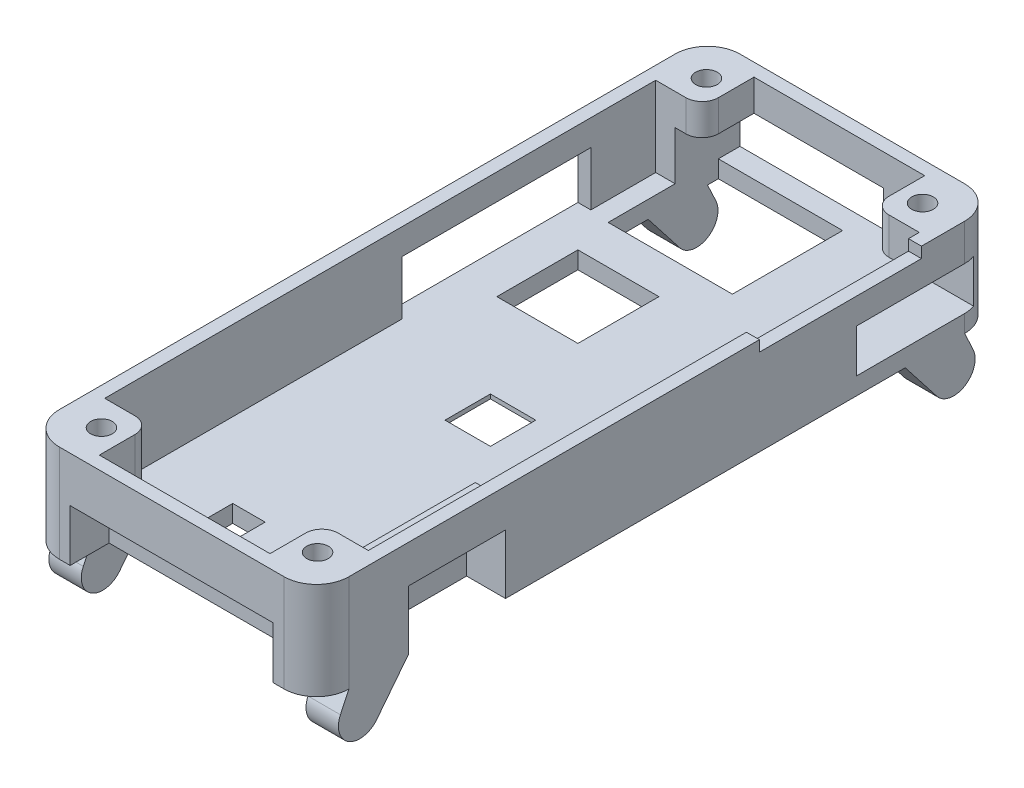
ISO-10303-21;
HEADER;
FILE_DESCRIPTION(('STEP AP214'),'2;1');
FILE_NAME('part.step','',(''),(''),'','','');
FILE_SCHEMA(('AUTOMOTIVE_DESIGN { 1 0 10303 214 1 1 1 1 }'));
ENDSEC;
DATA;
#1=APPLICATION_CONTEXT('core data for automotive mechanical design processes');
#2=APPLICATION_PROTOCOL_DEFINITION('international standard','automotive_design',2000,#1);
#3=PRODUCT_CONTEXT('',#1,'mechanical');
#4=PRODUCT('Part','Part','',(#3));
#5=PRODUCT_RELATED_PRODUCT_CATEGORY('part','',(#4));
#6=PRODUCT_DEFINITION_FORMATION('','',#4);
#7=PRODUCT_DEFINITION_CONTEXT('part definition',#1,'design');
#8=PRODUCT_DEFINITION('design','',#6,#7);
#9=PRODUCT_DEFINITION_SHAPE('','',#8);
#10=(LENGTH_UNIT() NAMED_UNIT(*) SI_UNIT(.MILLI.,.METRE.));
#11=(NAMED_UNIT(*) PLANE_ANGLE_UNIT() SI_UNIT($,.RADIAN.));
#12=(NAMED_UNIT(*) SI_UNIT($,.STERADIAN.) SOLID_ANGLE_UNIT());
#13=UNCERTAINTY_MEASURE_WITH_UNIT(LENGTH_MEASURE(1.E-05),#10,'distance_accuracy_value','');
#14=(GEOMETRIC_REPRESENTATION_CONTEXT(3) GLOBAL_UNCERTAINTY_ASSIGNED_CONTEXT((#13)) GLOBAL_UNIT_ASSIGNED_CONTEXT((#10,
#11,#12)) REPRESENTATION_CONTEXT('',''));
#15=CARTESIAN_POINT('',(0.,0.,0.));
#16=DIRECTION('',(0.,0.,1.));
#17=DIRECTION('',(1.,0.,0.));
#18=AXIS2_PLACEMENT_3D('',#15,#16,#17);
#19=CARTESIAN_POINT('',(2.1,0.,-0.100000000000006));
#20=DIRECTION('',(1.,0.,0.));
#21=DIRECTION('',(0.,0.,-1.));
#22=AXIS2_PLACEMENT_3D('',#19,#20,#21);
#23=PLANE('',#22);
#24=DIRECTION('',(0.,0.,-1.));
#25=VECTOR('',#24,1.);
#26=CARTESIAN_POINT('',(2.1,1.2,-0.100000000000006));
#27=LINE('',#26,#25);
#28=CARTESIAN_POINT('',(2.1,1.2,4.1));
#29=VERTEX_POINT('',#28);
#30=CARTESIAN_POINT('',(2.1,1.2,-0.100000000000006));
#31=VERTEX_POINT('',#30);
#32=EDGE_CURVE('E704',#29,#31,#27,.T.);
#33=ORIENTED_EDGE('',*,*,#32,.F.);
#34=DIRECTION('',(0.,1.,0.));
#35=VECTOR('',#34,1.);
#36=CARTESIAN_POINT('',(2.1,0.,4.1));
#37=LINE('',#36,#35);
#38=CARTESIAN_POINT('',(2.1,1.6,4.1));
#39=VERTEX_POINT('',#38);
#40=EDGE_CURVE('E1152',#29,#39,#37,.T.);
#41=ORIENTED_EDGE('',*,*,#40,.T.);
#42=DIRECTION('',(0.,0.,-1.));
#43=VECTOR('',#42,1.);
#44=CARTESIAN_POINT('',(2.1,1.6,-0.100000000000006));
#45=LINE('',#44,#43);
#46=CARTESIAN_POINT('',(2.1,1.6,-0.100000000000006));
#47=VERTEX_POINT('',#46);
#48=EDGE_CURVE('E1139',#39,#47,#45,.T.);
#49=ORIENTED_EDGE('',*,*,#48,.T.);
#50=DIRECTION('',(0.,1.,0.));
#51=VECTOR('',#50,1.);
#52=CARTESIAN_POINT('',(2.1,0.,-0.100000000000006));
#53=LINE('',#52,#51);
#54=EDGE_CURVE('E1151',#31,#47,#53,.T.);
#55=ORIENTED_EDGE('',*,*,#54,.F.);
#56=EDGE_LOOP('',(#33,#41,#49,#55));
#57=FACE_BOUND('',#56,.T.);
#58=ADVANCED_FACE('F35',(#57),#23,.F.);
#59=CARTESIAN_POINT('',(-2.1,0.,4.09999999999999));
#60=DIRECTION('',(0.,0.,1.));
#61=DIRECTION('',(1.,0.,0.));
#62=AXIS2_PLACEMENT_3D('',#59,#60,#61);
#63=PLANE('',#62);
#64=DIRECTION('',(1.,0.,0.));
#65=VECTOR('',#64,1.);
#66=CARTESIAN_POINT('',(-2.1,1.2,4.09999999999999));
#67=LINE('',#66,#65);
#68=CARTESIAN_POINT('',(-2.1,1.2,4.09999999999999));
#69=VERTEX_POINT('',#68);
#70=EDGE_CURVE('E702',#69,#29,#67,.T.);
#71=ORIENTED_EDGE('',*,*,#70,.F.);
#72=DIRECTION('',(0.,1.,0.));
#73=VECTOR('',#72,1.);
#74=CARTESIAN_POINT('',(-2.1,0.,4.09999999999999));
#75=LINE('',#74,#73);
#76=CARTESIAN_POINT('',(-2.1,1.6,4.09999999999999));
#77=VERTEX_POINT('',#76);
#78=EDGE_CURVE('E1155',#69,#77,#75,.T.);
#79=ORIENTED_EDGE('',*,*,#78,.T.);
#80=DIRECTION('',(1.,0.,0.));
#81=VECTOR('',#80,1.);
#82=CARTESIAN_POINT('',(-2.1,1.6,4.09999999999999));
#83=LINE('',#82,#81);
#84=EDGE_CURVE('E1148',#77,#39,#83,.T.);
#85=ORIENTED_EDGE('',*,*,#84,.T.);
#86=ORIENTED_EDGE('',*,*,#40,.F.);
#87=EDGE_LOOP('',(#71,#79,#85,#86));
#88=FACE_BOUND('',#87,.T.);
#89=ADVANCED_FACE('F1412',(#88),#63,.F.);
#90=CARTESIAN_POINT('',(-2.1,0.,-0.100000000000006));
#91=DIRECTION('',(-1.,0.,0.));
#92=DIRECTION('',(0.,0.,1.));
#93=AXIS2_PLACEMENT_3D('',#90,#91,#92);
#94=PLANE('',#93);
#95=DIRECTION('',(0.,0.,1.));
#96=VECTOR('',#95,1.);
#97=CARTESIAN_POINT('',(-2.1,1.2,-0.100000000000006));
#98=LINE('',#97,#96);
#99=CARTESIAN_POINT('',(-2.1,1.2,-0.100000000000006));
#100=VERTEX_POINT('',#99);
#101=EDGE_CURVE('E698',#100,#69,#98,.T.);
#102=ORIENTED_EDGE('',*,*,#101,.F.);
#103=DIRECTION('',(0.,1.,0.));
#104=VECTOR('',#103,1.);
#105=CARTESIAN_POINT('',(-2.1,0.,-0.100000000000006));
#106=LINE('',#105,#104);
#107=CARTESIAN_POINT('',(-2.1,1.6,-0.100000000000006));
#108=VERTEX_POINT('',#107);
#109=EDGE_CURVE('E1157',#100,#108,#106,.T.);
#110=ORIENTED_EDGE('',*,*,#109,.T.);
#111=DIRECTION('',(0.,0.,1.));
#112=VECTOR('',#111,1.);
#113=CARTESIAN_POINT('',(-2.1,1.6,-0.100000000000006));
#114=LINE('',#113,#112);
#115=EDGE_CURVE('E1145',#108,#77,#114,.T.);
#116=ORIENTED_EDGE('',*,*,#115,.T.);
#117=ORIENTED_EDGE('',*,*,#78,.F.);
#118=EDGE_LOOP('',(#102,#110,#116,#117));
#119=FACE_BOUND('',#118,.T.);
#120=ADVANCED_FACE('F1418',(#119),#94,.F.);
#121=CARTESIAN_POINT('',(-2.1,0.,-0.100000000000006));
#122=DIRECTION('',(0.,0.,-1.));
#123=DIRECTION('',(-1.,0.,0.));
#124=AXIS2_PLACEMENT_3D('',#121,#122,#123);
#125=PLANE('',#124);
#126=DIRECTION('',(-1.,0.,0.));
#127=VECTOR('',#126,1.);
#128=CARTESIAN_POINT('',(-2.1,1.2,-0.100000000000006));
#129=LINE('',#128,#127);
#130=EDGE_CURVE('E11',#31,#100,#129,.T.);
#131=ORIENTED_EDGE('',*,*,#130,.F.);
#132=ORIENTED_EDGE('',*,*,#54,.T.);
#133=DIRECTION('',(-1.,0.,0.));
#134=VECTOR('',#133,1.);
#135=CARTESIAN_POINT('',(-2.1,1.6,-0.100000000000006));
#136=LINE('',#135,#134);
#137=EDGE_CURVE('E1142',#47,#108,#136,.T.);
#138=ORIENTED_EDGE('',*,*,#137,.T.);
#139=ORIENTED_EDGE('',*,*,#109,.F.);
#140=EDGE_LOOP('',(#131,#132,#138,#139));
#141=FACE_BOUND('',#140,.T.);
#142=ADVANCED_FACE('F1424',(#141),#125,.F.);
#143=CARTESIAN_POINT('',(-13.4,9.,-30.3));
#144=DIRECTION('',(0.,0.,1.));
#145=DIRECTION('',(1.,0.,0.));
#146=AXIS2_PLACEMENT_3D('',#143,#144,#145);
#147=PLANE('',#146);
#148=DIRECTION('',(0.,1.,0.));
#149=VECTOR('',#148,1.);
#150=CARTESIAN_POINT('',(4.1,9.,-30.3));
#151=LINE('',#150,#149);
#152=CARTESIAN_POINT('',(4.1,1.6,-30.3));
#153=VERTEX_POINT('',#152);
#154=CARTESIAN_POINT('',(4.1,6.1,-30.3));
#155=VERTEX_POINT('',#154);
#156=EDGE_CURVE('E748',#153,#155,#151,.T.);
#157=ORIENTED_EDGE('',*,*,#156,.F.);
#158=DIRECTION('',(-1.,0.,0.));
#159=VECTOR('',#158,1.);
#160=CARTESIAN_POINT('',(-13.4,1.6,-30.3));
#161=LINE('',#160,#159);
#162=CARTESIAN_POINT('',(9.4,1.6,-30.3));
#163=VERTEX_POINT('',#162);
#164=EDGE_CURVE('E1267',#163,#153,#161,.T.);
#165=ORIENTED_EDGE('',*,*,#164,.F.);
#166=DIRECTION('',(0.,-1.,0.));
#167=VECTOR('',#166,1.);
#168=CARTESIAN_POINT('',(9.4,13.7201694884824,-30.3));
#169=LINE('',#168,#167);
#170=CARTESIAN_POINT('',(9.4,4.8,-30.3));
#171=VERTEX_POINT('',#170);
#172=EDGE_CURVE('E1255',#171,#163,#169,.T.);
#173=ORIENTED_EDGE('',*,*,#172,.F.);
#174=DIRECTION('',(-1.,0.,0.));
#175=VECTOR('',#174,1.);
#176=CARTESIAN_POINT('',(9.4,4.8,-30.3));
#177=LINE('',#176,#175);
#178=CARTESIAN_POINT('',(7.90000000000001,4.8,-30.3));
#179=VERTEX_POINT('',#178);
#180=EDGE_CURVE('E869',#171,#179,#177,.T.);
#181=ORIENTED_EDGE('',*,*,#180,.T.);
#182=DIRECTION('',(0.,-1.,0.));
#183=VECTOR('',#182,1.);
#184=CARTESIAN_POINT('',(7.90000000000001,13.0853396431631,-30.3));
#185=LINE('',#184,#183);
#186=CARTESIAN_POINT('',(7.9,9.,-30.3));
#187=VERTEX_POINT('',#186);
#188=EDGE_CURVE('E871',#187,#179,#185,.T.);
#189=ORIENTED_EDGE('',*,*,#188,.F.);
#190=DIRECTION('',(-1.,0.,0.));
#191=VECTOR('',#190,1.);
#192=CARTESIAN_POINT('',(-13.4,9.,-30.3));
#193=LINE('',#192,#191);
#194=CARTESIAN_POINT('',(-7.9,9.,-30.3));
#195=VERTEX_POINT('',#194);
#196=EDGE_CURVE('E1277',#187,#195,#193,.T.);
#197=ORIENTED_EDGE('',*,*,#196,.T.);
#198=DIRECTION('',(0.,-1.,0.));
#199=VECTOR('',#198,1.);
#200=CARTESIAN_POINT('',(-7.9,13.0853396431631,-30.3));
#201=LINE('',#200,#199);
#202=CARTESIAN_POINT('',(-7.9,6.1,-30.3));
#203=VERTEX_POINT('',#202);
#204=EDGE_CURVE('E879',#195,#203,#201,.T.);
#205=ORIENTED_EDGE('',*,*,#204,.T.);
#206=DIRECTION('',(-1.,0.,0.));
#207=VECTOR('',#206,1.);
#208=CARTESIAN_POINT('',(-13.4,6.1,-30.3));
#209=LINE('',#208,#207);
#210=EDGE_CURVE('E734',#155,#203,#209,.T.);
#211=ORIENTED_EDGE('',*,*,#210,.F.);
#212=EDGE_LOOP('',(#157,#165,#173,#181,#189,#197,#205,#211));
#213=FACE_BOUND('',#212,.T.);
#214=ADVANCED_FACE('F1485',(#213),#147,.T.);
#215=CARTESIAN_POINT('',(0.,9.,0.));
#216=DIRECTION('',(0.,1.,0.));
#217=DIRECTION('',(0.,0.,1.));
#218=AXIS2_PLACEMENT_3D('',#215,#216,#217);
#219=PLANE('',#218);
#220=DIRECTION('',(-1.,0.,0.));
#221=VECTOR('',#220,1.);
#222=CARTESIAN_POINT('',(12.2,9.,-24.5));
#223=LINE('',#222,#221);
#224=CARTESIAN_POINT('',(13.4,9.,-24.5));
#225=VERTEX_POINT('',#224);
#226=CARTESIAN_POINT('',(12.2,9.,-24.5));
#227=VERTEX_POINT('',#226);
#228=EDGE_CURVE('E664',#225,#227,#223,.T.);
#229=ORIENTED_EDGE('',*,*,#228,.F.);
#230=DIRECTION('',(0.,0.,-1.));
#231=VECTOR('',#230,1.);
#232=CARTESIAN_POINT('',(13.4,9.,-31.5));
#233=LINE('',#232,#231);
#234=CARTESIAN_POINT('',(13.4,9.,-28.5));
#235=VERTEX_POINT('',#234);
#236=EDGE_CURVE('E1289',#225,#235,#233,.T.);
#237=ORIENTED_EDGE('',*,*,#236,.T.);
#238=CARTESIAN_POINT('',(10.4,9.,-28.5));
#239=DIRECTION('',(0.,1.,0.));
#240=DIRECTION('',(0.,0.,1.));
#241=AXIS2_PLACEMENT_3D('',#238,#239,#240);
#242=CIRCLE('',#241,3.);
#243=CARTESIAN_POINT('',(10.4,9.,-31.5));
#244=VERTEX_POINT('',#243);
#245=EDGE_CURVE('E1333',#235,#244,#242,.T.);
#246=ORIENTED_EDGE('',*,*,#245,.T.);
#247=DIRECTION('',(-1.,0.,0.));
#248=VECTOR('',#247,1.);
#249=CARTESIAN_POINT('',(-13.4,9.,-31.5));
#250=LINE('',#249,#248);
#251=CARTESIAN_POINT('',(-10.4,9.,-31.5));
#252=VERTEX_POINT('',#251);
#253=EDGE_CURVE('E1288',#244,#252,#250,.T.);
#254=ORIENTED_EDGE('',*,*,#253,.T.);
#255=CARTESIAN_POINT('',(-10.4,9.,-28.5));
#256=DIRECTION('',(0.,1.,0.));
#257=DIRECTION('',(0.,0.,1.));
#258=AXIS2_PLACEMENT_3D('',#255,#256,#257);
#259=CIRCLE('',#258,3.);
#260=CARTESIAN_POINT('',(-13.4,9.,-28.5));
#261=VERTEX_POINT('',#260);
#262=EDGE_CURVE('E1335',#252,#261,#259,.T.);
#263=ORIENTED_EDGE('',*,*,#262,.T.);
#264=DIRECTION('',(0.,0.,1.));
#265=VECTOR('',#264,1.);
#266=CARTESIAN_POINT('',(-13.4,9.,-31.5));
#267=LINE('',#266,#265);
#268=CARTESIAN_POINT('',(-13.4,9.,28.5));
#269=VERTEX_POINT('',#268);
#270=EDGE_CURVE('E1292',#261,#269,#267,.T.);
#271=ORIENTED_EDGE('',*,*,#270,.T.);
#272=CARTESIAN_POINT('',(-10.4,9.,28.5));
#273=DIRECTION('',(0.,1.,0.));
#274=DIRECTION('',(0.,0.,1.));
#275=AXIS2_PLACEMENT_3D('',#272,#273,#274);
#276=CIRCLE('',#275,3.);
#277=CARTESIAN_POINT('',(-10.4,9.,31.5));
#278=VERTEX_POINT('',#277);
#279=EDGE_CURVE('E1337',#269,#278,#276,.T.);
#280=ORIENTED_EDGE('',*,*,#279,.T.);
#281=DIRECTION('',(1.,0.,0.));
#282=VECTOR('',#281,1.);
#283=CARTESIAN_POINT('',(-13.4,9.,31.5));
#284=LINE('',#283,#282);
#285=CARTESIAN_POINT('',(10.4,9.,31.5));
#286=VERTEX_POINT('',#285);
#287=EDGE_CURVE('E1295',#278,#286,#284,.T.);
#288=ORIENTED_EDGE('',*,*,#287,.T.);
#289=CARTESIAN_POINT('',(10.4,9.,28.5));
#290=DIRECTION('',(0.,1.,0.));
#291=DIRECTION('',(0.,0.,1.));
#292=AXIS2_PLACEMENT_3D('',#289,#290,#291);
#293=CIRCLE('',#292,3.);
#294=CARTESIAN_POINT('',(13.4,9.,28.5));
#295=VERTEX_POINT('',#294);
#296=EDGE_CURVE('E1331',#286,#295,#293,.T.);
#297=ORIENTED_EDGE('',*,*,#296,.T.);
#298=CARTESIAN_POINT('',(13.4,9.,-9.5));
#299=VERTEX_POINT('',#298);
#300=EDGE_CURVE('E1285',#295,#299,#233,.T.);
#301=ORIENTED_EDGE('',*,*,#300,.T.);
#302=DIRECTION('',(1.,0.,0.));
#303=VECTOR('',#302,1.);
#304=CARTESIAN_POINT('',(12.2,9.,-9.5));
#305=LINE('',#304,#303);
#306=CARTESIAN_POINT('',(12.2,9.,-9.5));
#307=VERTEX_POINT('',#306);
#308=EDGE_CURVE('E659',#307,#299,#305,.T.);
#309=ORIENTED_EDGE('',*,*,#308,.F.);
#310=DIRECTION('',(0.,0.,-1.));
#311=VECTOR('',#310,1.);
#312=CARTESIAN_POINT('',(12.2,9.,-31.5));
#313=LINE('',#312,#311);
#314=CARTESIAN_POINT('',(12.2,9.,25.5));
#315=VERTEX_POINT('',#314);
#316=EDGE_CURVE('E1274',#315,#307,#313,.T.);
#317=ORIENTED_EDGE('',*,*,#316,.F.);
#318=DIRECTION('',(-1.,0.,0.));
#319=VECTOR('',#318,1.);
#320=CARTESIAN_POINT('',(12.2,9.,25.5));
#321=LINE('',#320,#319);
#322=CARTESIAN_POINT('',(9.4,9.,25.5));
#323=VERTEX_POINT('',#322);
#324=EDGE_CURVE('E853',#315,#323,#321,.T.);
#325=ORIENTED_EDGE('',*,*,#324,.T.);
#326=CARTESIAN_POINT('',(9.4,9.,27.));
#327=DIRECTION('',(0.,1.,0.));
#328=DIRECTION('',(0.,0.,1.));
#329=AXIS2_PLACEMENT_3D('',#326,#327,#328);
#330=CIRCLE('',#329,1.5);
#331=CARTESIAN_POINT('',(7.9,9.,27.));
#332=VERTEX_POINT('',#331);
#333=EDGE_CURVE('E1368',#323,#332,#330,.T.);
#334=ORIENTED_EDGE('',*,*,#333,.T.);
#335=DIRECTION('',(0.,0.,-1.));
#336=VECTOR('',#335,1.);
#337=CARTESIAN_POINT('',(7.9,9.,26.5));
#338=LINE('',#337,#336);
#339=CARTESIAN_POINT('',(7.90000000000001,9.,30.3));
#340=VERTEX_POINT('',#339);
#341=EDGE_CURVE('E890',#340,#332,#338,.T.);
#342=ORIENTED_EDGE('',*,*,#341,.F.);
#343=DIRECTION('',(1.,0.,0.));
#344=VECTOR('',#343,1.);
#345=CARTESIAN_POINT('',(-13.4,9.,30.3));
#346=LINE('',#345,#344);
#347=CARTESIAN_POINT('',(-7.9,9.,30.3));
#348=VERTEX_POINT('',#347);
#349=EDGE_CURVE('E1282',#348,#340,#346,.T.);
#350=ORIENTED_EDGE('',*,*,#349,.F.);
#351=DIRECTION('',(0.,0.,1.));
#352=VECTOR('',#351,1.);
#353=CARTESIAN_POINT('',(-7.9,9.,26.5));
#354=LINE('',#353,#352);
#355=CARTESIAN_POINT('',(-7.9,9.,27.));
#356=VERTEX_POINT('',#355);
#357=EDGE_CURVE('E897',#356,#348,#354,.T.);
#358=ORIENTED_EDGE('',*,*,#357,.F.);
#359=CARTESIAN_POINT('',(-9.4,9.,27.));
#360=DIRECTION('',(0.,1.,0.));
#361=DIRECTION('',(0.,0.,1.));
#362=AXIS2_PLACEMENT_3D('',#359,#360,#361);
#363=CIRCLE('',#362,1.5);
#364=CARTESIAN_POINT('',(-9.4,9.,25.5));
#365=VERTEX_POINT('',#364);
#366=EDGE_CURVE('E1366',#356,#365,#363,.T.);
#367=ORIENTED_EDGE('',*,*,#366,.T.);
#368=DIRECTION('',(1.,0.,0.));
#369=VECTOR('',#368,1.);
#370=CARTESIAN_POINT('',(-12.2,9.,25.5));
#371=LINE('',#370,#369);
#372=CARTESIAN_POINT('',(-12.2,9.,25.5));
#373=VERTEX_POINT('',#372);
#374=EDGE_CURVE('E859',#373,#365,#371,.T.);
#375=ORIENTED_EDGE('',*,*,#374,.F.);
#376=DIRECTION('',(0.,0.,1.));
#377=VECTOR('',#376,1.);
#378=CARTESIAN_POINT('',(-12.2,9.,-31.5));
#379=LINE('',#378,#377);
#380=CARTESIAN_POINT('',(-12.2,9.,-25.5));
#381=VERTEX_POINT('',#380);
#382=EDGE_CURVE('E1280',#381,#373,#379,.T.);
#383=ORIENTED_EDGE('',*,*,#382,.F.);
#384=DIRECTION('',(1.,0.,0.));
#385=VECTOR('',#384,1.);
#386=CARTESIAN_POINT('',(-12.2,9.,-25.5));
#387=LINE('',#386,#385);
#388=CARTESIAN_POINT('',(-9.4,9.,-25.5));
#389=VERTEX_POINT('',#388);
#390=EDGE_CURVE('E835',#381,#389,#387,.T.);
#391=ORIENTED_EDGE('',*,*,#390,.T.);
#392=CARTESIAN_POINT('',(-9.4,9.,-27.));
#393=DIRECTION('',(0.,1.,0.));
#394=DIRECTION('',(0.,0.,1.));
#395=AXIS2_PLACEMENT_3D('',#392,#393,#394);
#396=CIRCLE('',#395,1.5);
#397=CARTESIAN_POINT('',(-7.9,9.,-27.));
#398=VERTEX_POINT('',#397);
#399=EDGE_CURVE('E1364',#389,#398,#396,.T.);
#400=ORIENTED_EDGE('',*,*,#399,.T.);
#401=DIRECTION('',(0.,0.,-1.));
#402=VECTOR('',#401,1.);
#403=CARTESIAN_POINT('',(-7.9,9.,-26.5));
#404=LINE('',#403,#402);
#405=EDGE_CURVE('E882',#398,#195,#404,.T.);
#406=ORIENTED_EDGE('',*,*,#405,.T.);
#407=ORIENTED_EDGE('',*,*,#196,.F.);
#408=DIRECTION('',(0.,0.,1.));
#409=VECTOR('',#408,1.);
#410=CARTESIAN_POINT('',(7.9,9.,-26.5));
#411=LINE('',#410,#409);
#412=CARTESIAN_POINT('',(7.9,9.,-27.));
#413=VERTEX_POINT('',#412);
#414=EDGE_CURVE('E875',#187,#413,#411,.T.);
#415=ORIENTED_EDGE('',*,*,#414,.T.);
#416=CARTESIAN_POINT('',(9.4,9.,-27.));
#417=DIRECTION('',(0.,1.,0.));
#418=DIRECTION('',(0.,0.,1.));
#419=AXIS2_PLACEMENT_3D('',#416,#417,#418);
#420=CIRCLE('',#419,1.5);
#421=CARTESIAN_POINT('',(9.4,9.,-25.5));
#422=VERTEX_POINT('',#421);
#423=EDGE_CURVE('E1362',#413,#422,#420,.T.);
#424=ORIENTED_EDGE('',*,*,#423,.T.);
#425=DIRECTION('',(-1.,0.,0.));
#426=VECTOR('',#425,1.);
#427=CARTESIAN_POINT('',(12.2,9.,-25.5));
#428=LINE('',#427,#426);
#429=CARTESIAN_POINT('',(12.2,9.,-25.5));
#430=VERTEX_POINT('',#429);
#431=EDGE_CURVE('E841',#430,#422,#428,.T.);
#432=ORIENTED_EDGE('',*,*,#431,.F.);
#433=EDGE_CURVE('E1270',#227,#430,#313,.T.);
#434=ORIENTED_EDGE('',*,*,#433,.F.);
#435=EDGE_LOOP('',(#229,#237,#246,#254,#263,#271,#280,#288,#297,#301,#309,#317,#325,#334,#342,
#350,#358,#367,#375,#383,#391,#400,#406,#407,#415,#424,#432,#434));
#436=FACE_BOUND('',#435,.T.);
#437=CARTESIAN_POINT('',(-10.,9.,28.));
#438=DIRECTION('',(0.,-1.,0.));
#439=DIRECTION('',(0.,0.,1.));
#440=AXIS2_PLACEMENT_3D('',#437,#438,#439);
#441=CIRCLE('',#440,1.);
#442=CARTESIAN_POINT('',(-10.,9.,29.));
#443=VERTEX_POINT('',#442);
#444=EDGE_CURVE('E817',#443,#443,#441,.T.);
#445=ORIENTED_EDGE('',*,*,#444,.T.);
#446=EDGE_LOOP('',(#445));
#447=FACE_BOUND('',#446,.T.);
#448=CARTESIAN_POINT('',(10.,9.,28.));
#449=DIRECTION('',(0.,1.,0.));
#450=DIRECTION('',(0.,0.,1.));
#451=AXIS2_PLACEMENT_3D('',#448,#449,#450);
#452=CIRCLE('',#451,1.);
#453=CARTESIAN_POINT('',(10.,9.,29.));
#454=VERTEX_POINT('',#453);
#455=EDGE_CURVE('E823',#454,#454,#452,.T.);
#456=ORIENTED_EDGE('',*,*,#455,.F.);
#457=EDGE_LOOP('',(#456));
#458=FACE_BOUND('',#457,.T.);
#459=CARTESIAN_POINT('',(-10.,9.,-28.));
#460=DIRECTION('',(0.,1.,0.));
#461=DIRECTION('',(0.,0.,-1.));
#462=AXIS2_PLACEMENT_3D('',#459,#460,#461);
#463=CIRCLE('',#462,1.);
#464=CARTESIAN_POINT('',(-10.,9.,-29.));
#465=VERTEX_POINT('',#464);
#466=EDGE_CURVE('E813',#465,#465,#463,.T.);
#467=ORIENTED_EDGE('',*,*,#466,.F.);
#468=EDGE_LOOP('',(#467));
#469=FACE_BOUND('',#468,.T.);
#470=CARTESIAN_POINT('',(10.,9.,-28.));
#471=DIRECTION('',(0.,-1.,0.));
#472=DIRECTION('',(0.,0.,-1.));
#473=AXIS2_PLACEMENT_3D('',#470,#471,#472);
#474=CIRCLE('',#473,1.);
#475=CARTESIAN_POINT('',(10.,9.,-29.));
#476=VERTEX_POINT('',#475);
#477=EDGE_CURVE('E810',#476,#476,#474,.T.);
#478=ORIENTED_EDGE('',*,*,#477,.T.);
#479=EDGE_LOOP('',(#478));
#480=FACE_BOUND('',#479,.T.);
#481=ADVANCED_FACE('F1488',(#436,#447,#458,#469,#480),#219,.T.);
#482=CARTESIAN_POINT('',(0.,1.6,0.));
#483=DIRECTION('',(0.,1.,0.));
#484=DIRECTION('',(0.,0.,1.));
#485=AXIS2_PLACEMENT_3D('',#482,#483,#484);
#486=PLANE('',#485);
#487=ORIENTED_EDGE('',*,*,#164,.T.);
#488=DIRECTION('',(0.,0.,-1.));
#489=VECTOR('',#488,1.);
#490=CARTESIAN_POINT('',(4.1,1.6,-21.5));
#491=LINE('',#490,#489);
#492=CARTESIAN_POINT('',(4.1,1.6,-31.5));
#493=VERTEX_POINT('',#492);
#494=EDGE_CURVE('E722',#153,#493,#491,.T.);
#495=ORIENTED_EDGE('',*,*,#494,.T.);
#496=DIRECTION('',(-1.,0.,0.));
#497=VECTOR('',#496,1.);
#498=CARTESIAN_POINT('',(4.1,1.6,-31.5));
#499=LINE('',#498,#497);
#500=CARTESIAN_POINT('',(-10.4,1.6,-31.5));
#501=VERTEX_POINT('',#500);
#502=EDGE_CURVE('E715',#493,#501,#499,.T.);
#503=ORIENTED_EDGE('',*,*,#502,.T.);
#504=DIRECTION('',(0.,0.,-1.));
#505=VECTOR('',#504,1.);
#506=CARTESIAN_POINT('',(-10.4,1.6,-21.5));
#507=LINE('',#506,#505);
#508=CARTESIAN_POINT('',(-10.4,1.6,-29.5));
#509=VERTEX_POINT('',#508);
#510=EDGE_CURVE('E718',#509,#501,#507,.T.);
#511=ORIENTED_EDGE('',*,*,#510,.F.);
#512=DIRECTION('',(-1.,0.,0.));
#513=VECTOR('',#512,1.);
#514=CARTESIAN_POINT('',(-10.4,1.6,-29.5));
#515=LINE('',#514,#513);
#516=CARTESIAN_POINT('',(1.09999999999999,1.6,-29.5));
#517=VERTEX_POINT('',#516);
#518=EDGE_CURVE('E687',#517,#509,#515,.T.);
#519=ORIENTED_EDGE('',*,*,#518,.F.);
#520=DIRECTION('',(0.,0.,1.));
#521=VECTOR('',#520,1.);
#522=CARTESIAN_POINT('',(1.09999999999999,1.6,-19.3));
#523=LINE('',#522,#521);
#524=CARTESIAN_POINT('',(1.09999999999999,1.6,-19.3));
#525=VERTEX_POINT('',#524);
#526=EDGE_CURVE('E1131',#517,#525,#523,.T.);
#527=ORIENTED_EDGE('',*,*,#526,.T.);
#528=DIRECTION('',(-1.,0.,0.));
#529=VECTOR('',#528,1.);
#530=CARTESIAN_POINT('',(-10.4,1.6,-19.3));
#531=LINE('',#530,#529);
#532=CARTESIAN_POINT('',(-10.4,1.6,-19.3));
#533=VERTEX_POINT('',#532);
#534=EDGE_CURVE('E1122',#525,#533,#531,.T.);
#535=ORIENTED_EDGE('',*,*,#534,.T.);
#536=DIRECTION('',(0.,0.,-1.));
#537=VECTOR('',#536,1.);
#538=CARTESIAN_POINT('',(-10.4,1.6,-19.3));
#539=LINE('',#538,#537);
#540=CARTESIAN_POINT('',(-10.4,1.6,-25.5));
#541=VERTEX_POINT('',#540);
#542=EDGE_CURVE('E1134',#533,#541,#539,.T.);
#543=ORIENTED_EDGE('',*,*,#542,.T.);
#544=DIRECTION('',(-1.,0.,0.));
#545=VECTOR('',#544,1.);
#546=CARTESIAN_POINT('',(-12.2,1.6,-25.5));
#547=LINE('',#546,#545);
#548=CARTESIAN_POINT('',(-12.2,1.6,-25.5));
#549=VERTEX_POINT('',#548);
#550=EDGE_CURVE('E833',#541,#549,#547,.T.);
#551=ORIENTED_EDGE('',*,*,#550,.T.);
#552=DIRECTION('',(0.,0.,1.));
#553=VECTOR('',#552,1.);
#554=CARTESIAN_POINT('',(-12.2,1.6,-31.5));
#555=LINE('',#554,#553);
#556=CARTESIAN_POINT('',(-12.2,1.6,-19.5));
#557=VERTEX_POINT('',#556);
#558=EDGE_CURVE('E1268',#549,#557,#555,.T.);
#559=ORIENTED_EDGE('',*,*,#558,.T.);
#560=DIRECTION('',(-1.,0.,0.));
#561=VECTOR('',#560,1.);
#562=CARTESIAN_POINT('',(6.00027472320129,1.6,-19.5));
#563=LINE('',#562,#561);
#564=CARTESIAN_POINT('',(-13.4,1.6,-19.5));
#565=VERTEX_POINT('',#564);
#566=EDGE_CURVE('E630',#557,#565,#563,.T.);
#567=ORIENTED_EDGE('',*,*,#566,.T.);
#568=DIRECTION('',(0.,0.,1.));
#569=VECTOR('',#568,1.);
#570=CARTESIAN_POINT('',(-13.4,1.6,-19.5));
#571=LINE('',#570,#569);
#572=CARTESIAN_POINT('',(-13.4,1.6,-2.));
#573=VERTEX_POINT('',#572);
#574=EDGE_CURVE('E58',#565,#573,#571,.T.);
#575=ORIENTED_EDGE('',*,*,#574,.T.);
#576=DIRECTION('',(-1.,0.,0.));
#577=VECTOR('',#576,1.);
#578=CARTESIAN_POINT('',(6.00027472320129,1.6,-2.));
#579=LINE('',#578,#577);
#580=CARTESIAN_POINT('',(-12.2,1.6,-2.));
#581=VERTEX_POINT('',#580);
#582=EDGE_CURVE('E654',#581,#573,#579,.T.);
#583=ORIENTED_EDGE('',*,*,#582,.F.);
#584=CARTESIAN_POINT('',(-12.2,1.6,25.5));
#585=VERTEX_POINT('',#584);
#586=EDGE_CURVE('E1271',#581,#585,#555,.T.);
#587=ORIENTED_EDGE('',*,*,#586,.T.);
#588=DIRECTION('',(-1.,0.,0.));
#589=VECTOR('',#588,1.);
#590=CARTESIAN_POINT('',(-12.2,1.6,25.5));
#591=LINE('',#590,#589);
#592=CARTESIAN_POINT('',(-9.4,1.6,25.5));
#593=VERTEX_POINT('',#592);
#594=EDGE_CURVE('E865',#593,#585,#591,.T.);
#595=ORIENTED_EDGE('',*,*,#594,.F.);
#596=DIRECTION('',(0.,0.,1.));
#597=VECTOR('',#596,1.);
#598=CARTESIAN_POINT('',(-9.4,1.6,26.5));
#599=LINE('',#598,#597);
#600=CARTESIAN_POINT('',(-9.40000000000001,1.6,27.9));
#601=VERTEX_POINT('',#600);
#602=EDGE_CURVE('E1258',#593,#601,#599,.T.);
#603=ORIENTED_EDGE('',*,*,#602,.T.);
#604=DIRECTION('',(-1.,0.,0.));
#605=VECTOR('',#604,1.);
#606=CARTESIAN_POINT('',(0.,1.6,27.9));
#607=LINE('',#606,#605);
#608=CARTESIAN_POINT('',(9.39999999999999,1.6,27.9));
#609=VERTEX_POINT('',#608);
#610=EDGE_CURVE('E1251',#609,#601,#607,.T.);
#611=ORIENTED_EDGE('',*,*,#610,.F.);
#612=DIRECTION('',(0.,0.,1.));
#613=VECTOR('',#612,1.);
#614=CARTESIAN_POINT('',(9.4,1.6,30.3));
#615=LINE('',#614,#613);
#616=CARTESIAN_POINT('',(9.4,1.6,25.5));
#617=VERTEX_POINT('',#616);
#618=EDGE_CURVE('E1261',#617,#609,#615,.T.);
#619=ORIENTED_EDGE('',*,*,#618,.F.);
#620=DIRECTION('',(1.,0.,0.));
#621=VECTOR('',#620,1.);
#622=CARTESIAN_POINT('',(12.2,1.6,25.5));
#623=LINE('',#622,#621);
#624=CARTESIAN_POINT('',(12.2,1.6,25.5));
#625=VERTEX_POINT('',#624);
#626=EDGE_CURVE('E847',#617,#625,#623,.T.);
#627=ORIENTED_EDGE('',*,*,#626,.T.);
#628=DIRECTION('',(0.,0.,-1.));
#629=VECTOR('',#628,1.);
#630=CARTESIAN_POINT('',(12.2,1.6,-31.5));
#631=LINE('',#630,#629);
#632=CARTESIAN_POINT('',(12.2,1.6,24.2));
#633=VERTEX_POINT('',#632);
#634=EDGE_CURVE('E1265',#625,#633,#631,.T.);
#635=ORIENTED_EDGE('',*,*,#634,.T.);
#636=DIRECTION('',(1.,0.,0.));
#637=VECTOR('',#636,1.);
#638=CARTESIAN_POINT('',(12.2,1.6,24.2));
#639=LINE('',#638,#637);
#640=CARTESIAN_POINT('',(9.4,1.6,24.2));
#641=VERTEX_POINT('',#640);
#642=EDGE_CURVE('E911',#641,#633,#639,.T.);
#643=ORIENTED_EDGE('',*,*,#642,.F.);
#644=DIRECTION('',(0.,0.,1.));
#645=VECTOR('',#644,1.);
#646=CARTESIAN_POINT('',(9.4,1.6,0.));
#647=LINE('',#646,#645);
#648=CARTESIAN_POINT('',(9.4,1.6,12.8));
#649=VERTEX_POINT('',#648);
#650=EDGE_CURVE('E1082',#649,#641,#647,.T.);
#651=ORIENTED_EDGE('',*,*,#650,.F.);
#652=DIRECTION('',(-1.,0.,0.));
#653=VECTOR('',#652,1.);
#654=CARTESIAN_POINT('',(12.2,1.6,12.8));
#655=LINE('',#654,#653);
#656=CARTESIAN_POINT('',(12.2,1.6,12.8));
#657=VERTEX_POINT('',#656);
#658=EDGE_CURVE('E916',#657,#649,#655,.T.);
#659=ORIENTED_EDGE('',*,*,#658,.F.);
#660=CARTESIAN_POINT('',(12.2,1.6,-18.5));
#661=VERTEX_POINT('',#660);
#662=EDGE_CURVE('E1264',#657,#661,#631,.T.);
#663=ORIENTED_EDGE('',*,*,#662,.T.);
#664=DIRECTION('',(1.,0.,0.));
#665=VECTOR('',#664,1.);
#666=CARTESIAN_POINT('',(-13.401,1.6,-18.5));
#667=LINE('',#666,#665);
#668=CARTESIAN_POINT('',(13.4,1.6,-18.5));
#669=VERTEX_POINT('',#668);
#670=EDGE_CURVE('E791',#661,#669,#667,.T.);
#671=ORIENTED_EDGE('',*,*,#670,.T.);
#672=DIRECTION('',(0.,0.,-1.));
#673=VECTOR('',#672,1.);
#674=CARTESIAN_POINT('',(13.4,1.6,-29.5));
#675=LINE('',#674,#673);
#676=CARTESIAN_POINT('',(13.4,1.6,-28.5));
#677=VERTEX_POINT('',#676);
#678=EDGE_CURVE('E784',#669,#677,#675,.T.);
#679=ORIENTED_EDGE('',*,*,#678,.T.);
#680=CARTESIAN_POINT('',(10.4,1.6,-28.5));
#681=DIRECTION('',(0.,-1.,0.));
#682=DIRECTION('',(0.,0.,-1.));
#683=AXIS2_PLACEMENT_3D('',#680,#681,#682);
#684=CIRCLE('',#683,3.);
#685=CARTESIAN_POINT('',(13.2284271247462,1.6,-29.5));
#686=VERTEX_POINT('',#685);
#687=EDGE_CURVE('E766',#686,#677,#684,.T.);
#688=ORIENTED_EDGE('',*,*,#687,.F.);
#689=DIRECTION('',(1.,0.,0.));
#690=VECTOR('',#689,1.);
#691=CARTESIAN_POINT('',(-13.401,1.6,-29.5));
#692=LINE('',#691,#690);
#693=CARTESIAN_POINT('',(9.4,1.6,-29.5));
#694=VERTEX_POINT('',#693);
#695=EDGE_CURVE('E787',#694,#686,#692,.T.);
#696=ORIENTED_EDGE('',*,*,#695,.F.);
#697=DIRECTION('',(0.,0.,-1.));
#698=VECTOR('',#697,1.);
#699=CARTESIAN_POINT('',(9.4,1.6,-26.5));
#700=LINE('',#699,#698);
#701=EDGE_CURVE('E1253',#694,#163,#700,.T.);
#702=ORIENTED_EDGE('',*,*,#701,.T.);
#703=EDGE_LOOP('',(#487,#495,#503,#511,#519,#527,#535,#543,#551,#559,#567,#575,#583,#587,#595,
#603,#611,#619,#627,#635,#643,#651,#659,#663,#671,#679,#688,#696,#702));
#704=FACE_BOUND('',#703,.T.);
#705=DIRECTION('',(0.,0.,-1.));
#706=VECTOR('',#705,1.);
#707=CARTESIAN_POINT('',(-2.25000000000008,1.6,20.6));
#708=LINE('',#707,#706);
#709=CARTESIAN_POINT('',(-2.25000000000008,1.6,25.1));
#710=VERTEX_POINT('',#709);
#711=CARTESIAN_POINT('',(-2.25000000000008,1.6,20.6));
#712=VERTEX_POINT('',#711);
#713=EDGE_CURVE('E1185',#710,#712,#708,.T.);
#714=ORIENTED_EDGE('',*,*,#713,.F.);
#715=DIRECTION('',(1.,0.,0.));
#716=VECTOR('',#715,1.);
#717=CARTESIAN_POINT('',(-5.25000000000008,1.6,25.1));
#718=LINE('',#717,#716);
#719=CARTESIAN_POINT('',(-5.25000000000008,1.6,25.1));
#720=VERTEX_POINT('',#719);
#721=EDGE_CURVE('E1196',#720,#710,#718,.T.);
#722=ORIENTED_EDGE('',*,*,#721,.F.);
#723=DIRECTION('',(0.,0.,1.));
#724=VECTOR('',#723,1.);
#725=CARTESIAN_POINT('',(-5.25000000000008,1.6,20.6));
#726=LINE('',#725,#724);
#727=CARTESIAN_POINT('',(-5.25000000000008,1.6,20.6));
#728=VERTEX_POINT('',#727);
#729=EDGE_CURVE('E1210',#728,#720,#726,.T.);
#730=ORIENTED_EDGE('',*,*,#729,.F.);
#731=DIRECTION('',(-1.,0.,0.));
#732=VECTOR('',#731,1.);
#733=CARTESIAN_POINT('',(-5.25000000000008,1.6,20.6));
#734=LINE('',#733,#732);
#735=EDGE_CURVE('E1207',#712,#728,#734,.T.);
#736=ORIENTED_EDGE('',*,*,#735,.F.);
#737=EDGE_LOOP('',(#714,#722,#730,#736));
#738=FACE_BOUND('',#737,.T.);
#739=DIRECTION('',(0.,0.,-1.));
#740=VECTOR('',#739,1.);
#741=CARTESIAN_POINT('',(6.25,1.6,20.6));
#742=LINE('',#741,#740);
#743=CARTESIAN_POINT('',(6.25,1.6,25.1));
#744=VERTEX_POINT('',#743);
#745=CARTESIAN_POINT('',(6.25,1.6,20.6));
#746=VERTEX_POINT('',#745);
#747=EDGE_CURVE('E1154',#744,#746,#742,.T.);
#748=ORIENTED_EDGE('',*,*,#747,.F.);
#749=DIRECTION('',(1.,0.,0.));
#750=VECTOR('',#749,1.);
#751=CARTESIAN_POINT('',(3.25,1.6,25.1));
#752=LINE('',#751,#750);
#753=CARTESIAN_POINT('',(3.25,1.6,25.1));
#754=VERTEX_POINT('',#753);
#755=EDGE_CURVE('E1164',#754,#744,#752,.T.);
#756=ORIENTED_EDGE('',*,*,#755,.F.);
#757=DIRECTION('',(0.,0.,1.));
#758=VECTOR('',#757,1.);
#759=CARTESIAN_POINT('',(3.25,1.6,20.6));
#760=LINE('',#759,#758);
#761=CARTESIAN_POINT('',(3.25,1.6,20.6));
#762=VERTEX_POINT('',#761);
#763=EDGE_CURVE('E1178',#762,#754,#760,.T.);
#764=ORIENTED_EDGE('',*,*,#763,.F.);
#765=DIRECTION('',(-1.,0.,0.));
#766=VECTOR('',#765,1.);
#767=CARTESIAN_POINT('',(3.25,1.6,20.6));
#768=LINE('',#767,#766);
#769=EDGE_CURVE('E1175',#746,#762,#768,.T.);
#770=ORIENTED_EDGE('',*,*,#769,.F.);
#771=EDGE_LOOP('',(#748,#756,#764,#770));
#772=FACE_BOUND('',#771,.T.);
#773=ORIENTED_EDGE('',*,*,#48,.F.);
#774=ORIENTED_EDGE('',*,*,#84,.F.);
#775=ORIENTED_EDGE('',*,*,#115,.F.);
#776=ORIENTED_EDGE('',*,*,#137,.F.);
#777=EDGE_LOOP('',(#773,#774,#775,#776));
#778=FACE_BOUND('',#777,.T.);
#779=DIRECTION('',(-1.,0.,0.));
#780=VECTOR('',#779,1.);
#781=CARTESIAN_POINT('',(-9.6,1.6,-8.20000000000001));
#782=LINE('',#781,#780);
#783=CARTESIAN_POINT('',(-2.1,1.6,-8.20000000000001));
#784=VERTEX_POINT('',#783);
#785=CARTESIAN_POINT('',(-9.6,1.6,-8.20000000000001));
#786=VERTEX_POINT('',#785);
#787=EDGE_CURVE('E1089',#784,#786,#782,.T.);
#788=ORIENTED_EDGE('',*,*,#787,.T.);
#789=DIRECTION('',(0.,0.,-1.));
#790=VECTOR('',#789,1.);
#791=CARTESIAN_POINT('',(-9.6,1.6,-8.20000000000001));
#792=LINE('',#791,#790);
#793=CARTESIAN_POINT('',(-9.59999999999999,1.6,-15.7));
#794=VERTEX_POINT('',#793);
#795=EDGE_CURVE('E1110',#786,#794,#792,.T.);
#796=ORIENTED_EDGE('',*,*,#795,.T.);
#797=DIRECTION('',(1.,0.,0.));
#798=VECTOR('',#797,1.);
#799=CARTESIAN_POINT('',(-9.59999999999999,1.6,-15.7));
#800=LINE('',#799,#798);
#801=CARTESIAN_POINT('',(-2.09999999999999,1.6,-15.7));
#802=VERTEX_POINT('',#801);
#803=EDGE_CURVE('E1106',#794,#802,#800,.T.);
#804=ORIENTED_EDGE('',*,*,#803,.T.);
#805=DIRECTION('',(0.,0.,1.));
#806=VECTOR('',#805,1.);
#807=CARTESIAN_POINT('',(-2.1,1.6,-8.20000000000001));
#808=LINE('',#807,#806);
#809=EDGE_CURVE('E1101',#802,#784,#808,.T.);
#810=ORIENTED_EDGE('',*,*,#809,.T.);
#811=EDGE_LOOP('',(#788,#796,#804,#810));
#812=FACE_BOUND('',#811,.T.);
#813=ADVANCED_FACE('F1492',(#704,#738,#772,#778,#812),#486,.T.);
#814=CARTESIAN_POINT('',(-12.2,9.,-31.5));
#815=DIRECTION('',(1.,0.,0.));
#816=DIRECTION('',(0.,0.,-1.));
#817=AXIS2_PLACEMENT_3D('',#814,#815,#816);
#818=PLANE('',#817);
#819=DIRECTION('',(0.,-1.,0.));
#820=VECTOR('',#819,1.);
#821=CARTESIAN_POINT('',(-12.2,6.6,-19.5));
#822=LINE('',#821,#820);
#823=CARTESIAN_POINT('',(-12.2,6.6,-19.5));
#824=VERTEX_POINT('',#823);
#825=EDGE_CURVE('E624',#824,#557,#822,.T.);
#826=ORIENTED_EDGE('',*,*,#825,.T.);
#827=ORIENTED_EDGE('',*,*,#558,.F.);
#828=DIRECTION('',(0.,1.,0.));
#829=VECTOR('',#828,1.);
#830=CARTESIAN_POINT('',(-12.2,9.,-25.5));
#831=LINE('',#830,#829);
#832=EDGE_CURVE('E829',#549,#381,#831,.T.);
#833=ORIENTED_EDGE('',*,*,#832,.T.);
#834=ORIENTED_EDGE('',*,*,#382,.T.);
#835=DIRECTION('',(0.,1.,0.));
#836=VECTOR('',#835,1.);
#837=CARTESIAN_POINT('',(-12.2,9.,25.5));
#838=LINE('',#837,#836);
#839=EDGE_CURVE('E856',#585,#373,#838,.T.);
#840=ORIENTED_EDGE('',*,*,#839,.F.);
#841=ORIENTED_EDGE('',*,*,#586,.F.);
#842=DIRECTION('',(0.,1.,0.));
#843=VECTOR('',#842,1.);
#844=CARTESIAN_POINT('',(-12.2,6.6,-2.));
#845=LINE('',#844,#843);
#846=CARTESIAN_POINT('',(-12.2,6.6,-2.));
#847=VERTEX_POINT('',#846);
#848=EDGE_CURVE('E646',#581,#847,#845,.T.);
#849=ORIENTED_EDGE('',*,*,#848,.T.);
#850=DIRECTION('',(0.,0.,-1.));
#851=VECTOR('',#850,1.);
#852=CARTESIAN_POINT('',(-12.2,6.6,-19.5));
#853=LINE('',#852,#851);
#854=EDGE_CURVE('E638',#847,#824,#853,.T.);
#855=ORIENTED_EDGE('',*,*,#854,.T.);
#856=EDGE_LOOP('',(#826,#827,#833,#834,#840,#841,#849,#855));
#857=FACE_BOUND('',#856,.T.);
#858=ADVANCED_FACE('F644',(#857),#818,.T.);
#859=CARTESIAN_POINT('',(12.2,9.,-31.5));
#860=DIRECTION('',(-1.,0.,0.));
#861=DIRECTION('',(0.,0.,1.));
#862=AXIS2_PLACEMENT_3D('',#859,#860,#861);
#863=PLANE('',#862);
#864=DIRECTION('',(0.,1.,0.));
#865=VECTOR('',#864,1.);
#866=CARTESIAN_POINT('',(12.2,8.,-24.5));
#867=LINE('',#866,#865);
#868=CARTESIAN_POINT('',(12.2,8.,-24.5));
#869=VERTEX_POINT('',#868);
#870=EDGE_CURVE('E674',#869,#227,#867,.T.);
#871=ORIENTED_EDGE('',*,*,#870,.T.);
#872=ORIENTED_EDGE('',*,*,#433,.T.);
#873=DIRECTION('',(0.,1.,0.));
#874=VECTOR('',#873,1.);
#875=CARTESIAN_POINT('',(12.2,9.,-25.5));
#876=LINE('',#875,#874);
#877=CARTESIAN_POINT('',(12.2,5.6,-25.5));
#878=VERTEX_POINT('',#877);
#879=EDGE_CURVE('E838',#878,#430,#876,.T.);
#880=ORIENTED_EDGE('',*,*,#879,.F.);
#881=DIRECTION('',(0.,0.,1.));
#882=VECTOR('',#881,1.);
#883=CARTESIAN_POINT('',(12.2,5.6,-29.5));
#884=LINE('',#883,#882);
#885=CARTESIAN_POINT('',(12.2,5.6,-18.5));
#886=VERTEX_POINT('',#885);
#887=EDGE_CURVE('E802',#878,#886,#884,.T.);
#888=ORIENTED_EDGE('',*,*,#887,.T.);
#889=DIRECTION('',(0.,-1.,0.));
#890=VECTOR('',#889,1.);
#891=CARTESIAN_POINT('',(12.2,5.6,-18.5));
#892=LINE('',#891,#890);
#893=EDGE_CURVE('E772',#886,#661,#892,.T.);
#894=ORIENTED_EDGE('',*,*,#893,.T.);
#895=ORIENTED_EDGE('',*,*,#662,.F.);
#896=DIRECTION('',(0.,-1.,0.));
#897=VECTOR('',#896,1.);
#898=CARTESIAN_POINT('',(12.2,6.7,12.8));
#899=LINE('',#898,#897);
#900=CARTESIAN_POINT('',(12.2,6.7,12.8));
#901=VERTEX_POINT('',#900);
#902=EDGE_CURVE('E914',#901,#657,#899,.T.);
#903=ORIENTED_EDGE('',*,*,#902,.F.);
#904=DIRECTION('',(0.,0.,-1.));
#905=VECTOR('',#904,1.);
#906=CARTESIAN_POINT('',(12.2,6.7,14.));
#907=LINE('',#906,#905);
#908=CARTESIAN_POINT('',(12.2,6.7,15.5));
#909=VERTEX_POINT('',#908);
#910=EDGE_CURVE('E954',#909,#901,#907,.T.);
#911=ORIENTED_EDGE('',*,*,#910,.F.);
#912=DIRECTION('',(0.,1.,0.));
#913=VECTOR('',#912,1.);
#914=CARTESIAN_POINT('',(12.2,-4.501,15.5));
#915=LINE('',#914,#913);
#916=CARTESIAN_POINT('',(12.2,5.5,15.5));
#917=VERTEX_POINT('',#916);
#918=EDGE_CURVE('E940',#917,#909,#915,.T.);
#919=ORIENTED_EDGE('',*,*,#918,.F.);
#920=DIRECTION('',(0.,0.,-1.));
#921=VECTOR('',#920,1.);
#922=CARTESIAN_POINT('',(12.2,5.5,15.5));
#923=LINE('',#922,#921);
#924=CARTESIAN_POINT('',(12.2,5.5,21.5));
#925=VERTEX_POINT('',#924);
#926=EDGE_CURVE('E937',#925,#917,#923,.T.);
#927=ORIENTED_EDGE('',*,*,#926,.F.);
#928=DIRECTION('',(0.,1.,0.));
#929=VECTOR('',#928,1.);
#930=CARTESIAN_POINT('',(12.2,-4.501,21.5));
#931=LINE('',#930,#929);
#932=CARTESIAN_POINT('',(12.2,6.7,21.5));
#933=VERTEX_POINT('',#932);
#934=EDGE_CURVE('E941',#925,#933,#931,.T.);
#935=ORIENTED_EDGE('',*,*,#934,.T.);
#936=CARTESIAN_POINT('',(12.2,6.7,24.2));
#937=VERTEX_POINT('',#936);
#938=EDGE_CURVE('E955',#937,#933,#907,.T.);
#939=ORIENTED_EDGE('',*,*,#938,.F.);
#940=DIRECTION('',(0.,1.,0.));
#941=VECTOR('',#940,1.);
#942=CARTESIAN_POINT('',(12.2,6.7,24.2));
#943=LINE('',#942,#941);
#944=EDGE_CURVE('E902',#633,#937,#943,.T.);
#945=ORIENTED_EDGE('',*,*,#944,.F.);
#946=ORIENTED_EDGE('',*,*,#634,.F.);
#947=DIRECTION('',(0.,1.,0.));
#948=VECTOR('',#947,1.);
#949=CARTESIAN_POINT('',(12.2,9.,25.5));
#950=LINE('',#949,#948);
#951=EDGE_CURVE('E844',#625,#315,#950,.T.);
#952=ORIENTED_EDGE('',*,*,#951,.T.);
#953=ORIENTED_EDGE('',*,*,#316,.T.);
#954=DIRECTION('',(0.,1.,0.));
#955=VECTOR('',#954,1.);
#956=CARTESIAN_POINT('',(12.2,8.,-9.5));
#957=LINE('',#956,#955);
#958=CARTESIAN_POINT('',(12.2,8.,-9.5));
#959=VERTEX_POINT('',#958);
#960=EDGE_CURVE('E671',#959,#307,#957,.T.);
#961=ORIENTED_EDGE('',*,*,#960,.F.);
#962=DIRECTION('',(0.,0.,1.));
#963=VECTOR('',#962,1.);
#964=CARTESIAN_POINT('',(12.2,8.,-24.5));
#965=LINE('',#964,#963);
#966=EDGE_CURVE('E660',#869,#959,#965,.T.);
#967=ORIENTED_EDGE('',*,*,#966,.F.);
#968=EDGE_LOOP('',(#871,#872,#880,#888,#894,#895,#903,#911,#919,#927,#935,#939,#945,#946,#952,
#953,#961,#967));
#969=FACE_BOUND('',#968,.T.);
#970=ADVANCED_FACE('F1476',(#969),#863,.T.);
#971=CARTESIAN_POINT('',(-9.4,13.7201694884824,26.5));
#972=DIRECTION('',(1.,0.,0.));
#973=DIRECTION('',(0.,0.,-1.));
#974=AXIS2_PLACEMENT_3D('',#971,#972,#973);
#975=PLANE('',#974);
#976=ORIENTED_EDGE('',*,*,#602,.F.);
#977=DIRECTION('',(0.,-1.,0.));
#978=VECTOR('',#977,1.);
#979=CARTESIAN_POINT('',(-9.4,4.8,25.5));
#980=LINE('',#979,#978);
#981=CARTESIAN_POINT('',(-9.4,4.8,25.5));
#982=VERTEX_POINT('',#981);
#983=EDGE_CURVE('E862',#982,#593,#980,.T.);
#984=ORIENTED_EDGE('',*,*,#983,.F.);
#985=DIRECTION('',(0.,0.,-1.));
#986=VECTOR('',#985,1.);
#987=CARTESIAN_POINT('',(-9.40000000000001,4.8,31.5));
#988=LINE('',#987,#986);
#989=CARTESIAN_POINT('',(-9.40000000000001,4.8,31.5));
#990=VERTEX_POINT('',#989);
#991=EDGE_CURVE('E1230',#990,#982,#988,.T.);
#992=ORIENTED_EDGE('',*,*,#991,.F.);
#993=DIRECTION('',(0.,-1.,0.));
#994=VECTOR('',#993,1.);
#995=CARTESIAN_POINT('',(-9.40000000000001,4.8,31.5));
#996=LINE('',#995,#994);
#997=CARTESIAN_POINT('',(-9.40000000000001,0.,31.5));
#998=VERTEX_POINT('',#997);
#999=EDGE_CURVE('E1245',#990,#998,#996,.T.);
#1000=ORIENTED_EDGE('',*,*,#999,.T.);
#1001=DIRECTION('',(0.,0.,-1.));
#1002=VECTOR('',#1001,1.);
#1003=CARTESIAN_POINT('',(-9.40000000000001,0.,31.5));
#1004=LINE('',#1003,#1002);
#1005=CARTESIAN_POINT('',(-9.40000000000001,0.,27.9));
#1006=VERTEX_POINT('',#1005);
#1007=EDGE_CURVE('E1235',#998,#1006,#1004,.T.);
#1008=ORIENTED_EDGE('',*,*,#1007,.T.);
#1009=DIRECTION('',(0.,-1.,0.));
#1010=VECTOR('',#1009,1.);
#1011=CARTESIAN_POINT('',(-9.40000000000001,4.8,27.9));
#1012=LINE('',#1011,#1010);
#1013=EDGE_CURVE('E1243',#601,#1006,#1012,.T.);
#1014=ORIENTED_EDGE('',*,*,#1013,.F.);
#1015=EDGE_LOOP('',(#976,#984,#992,#1000,#1008,#1014));
#1016=FACE_BOUND('',#1015,.T.);
#1017=ADVANCED_FACE('F1472',(#1016),#975,.T.);
#1018=CARTESIAN_POINT('',(0.,0.,0.));
#1019=DIRECTION('',(0.,1.,0.));
#1020=DIRECTION('',(0.,0.,1.));
#1021=AXIS2_PLACEMENT_3D('',#1018,#1019,#1020);
#1022=PLANE('',#1021);
#1023=CARTESIAN_POINT('',(-10.4,0.,-28.5));
#1024=DIRECTION('',(0.,1.,0.));
#1025=DIRECTION('',(0.,0.,1.));
#1026=AXIS2_PLACEMENT_3D('',#1023,#1024,#1025);
#1027=CIRCLE('',#1026,3.);
#1028=CARTESIAN_POINT('',(-13.4,0.,-28.5));
#1029=VERTEX_POINT('',#1028);
#1030=CARTESIAN_POINT('',(-10.4,0.,-31.5));
#1031=VERTEX_POINT('',#1030);
#1032=EDGE_CURVE('E1320',#1029,#1031,#1027,.F.);
#1033=ORIENTED_EDGE('',*,*,#1032,.T.);
#1034=DIRECTION('',(-1.,0.,0.));
#1035=VECTOR('',#1034,1.);
#1036=CARTESIAN_POINT('',(-13.4,0.,-31.5));
#1037=LINE('',#1036,#1035);
#1038=CARTESIAN_POINT('',(10.4,0.,-31.5));
#1039=VERTEX_POINT('',#1038);
#1040=EDGE_CURVE('E1301',#1039,#1031,#1037,.T.);
#1041=ORIENTED_EDGE('',*,*,#1040,.F.);
#1042=CARTESIAN_POINT('',(10.4,0.,-28.5));
#1043=DIRECTION('',(0.,1.,0.));
#1044=DIRECTION('',(0.,0.,1.));
#1045=AXIS2_PLACEMENT_3D('',#1042,#1043,#1044);
#1046=CIRCLE('',#1045,3.);
#1047=CARTESIAN_POINT('',(13.4,0.,-28.5));
#1048=VERTEX_POINT('',#1047);
#1049=EDGE_CURVE('E1317',#1039,#1048,#1046,.F.);
#1050=ORIENTED_EDGE('',*,*,#1049,.T.);
#1051=DIRECTION('',(1.,0.,0.));
#1052=VECTOR('',#1051,1.);
#1053=CARTESIAN_POINT('',(10.4,0.,-28.5));
#1054=LINE('',#1053,#1052);
#1055=CARTESIAN_POINT('',(10.4,0.,-28.5));
#1056=VERTEX_POINT('',#1055);
#1057=EDGE_CURVE('E976',#1056,#1048,#1054,.T.);
#1058=ORIENTED_EDGE('',*,*,#1057,.F.);
#1059=DIRECTION('',(0.,0.,-1.));
#1060=VECTOR('',#1059,1.);
#1061=CARTESIAN_POINT('',(10.4,0.,-23.));
#1062=LINE('',#1061,#1060);
#1063=CARTESIAN_POINT('',(10.4,0.,-23.));
#1064=VERTEX_POINT('',#1063);
#1065=EDGE_CURVE('E961',#1064,#1056,#1062,.T.);
#1066=ORIENTED_EDGE('',*,*,#1065,.F.);
#1067=DIRECTION('',(1.,0.,0.));
#1068=VECTOR('',#1067,1.);
#1069=CARTESIAN_POINT('',(10.4,0.,-23.));
#1070=LINE('',#1069,#1068);
#1071=CARTESIAN_POINT('',(13.4,0.,-23.));
#1072=VERTEX_POINT('',#1071);
#1073=EDGE_CURVE('E971',#1064,#1072,#1070,.T.);
#1074=ORIENTED_EDGE('',*,*,#1073,.T.);
#1075=DIRECTION('',(0.,0.,-1.));
#1076=VECTOR('',#1075,1.);
#1077=CARTESIAN_POINT('',(13.4,0.,-31.5));
#1078=LINE('',#1077,#1076);
#1079=CARTESIAN_POINT('',(13.4,0.,14.));
#1080=VERTEX_POINT('',#1079);
#1081=EDGE_CURVE('E1284',#1080,#1072,#1078,.T.);
#1082=ORIENTED_EDGE('',*,*,#1081,.F.);
#1083=DIRECTION('',(1.,0.,0.));
#1084=VECTOR('',#1083,1.);
#1085=CARTESIAN_POINT('',(9.4,0.,14.));
#1086=LINE('',#1085,#1084);
#1087=CARTESIAN_POINT('',(9.8,0.,14.));
#1088=VERTEX_POINT('',#1087);
#1089=EDGE_CURVE('E1070',#1088,#1080,#1086,.T.);
#1090=ORIENTED_EDGE('',*,*,#1089,.F.);
#1091=DIRECTION('',(0.,0.,1.));
#1092=VECTOR('',#1091,1.);
#1093=CARTESIAN_POINT('',(9.8,0.,23.));
#1094=LINE('',#1093,#1092);
#1095=CARTESIAN_POINT('',(9.8,0.,23.));
#1096=VERTEX_POINT('',#1095);
#1097=EDGE_CURVE('E750',#1088,#1096,#1094,.T.);
#1098=ORIENTED_EDGE('',*,*,#1097,.T.);
#1099=DIRECTION('',(-1.,0.,0.));
#1100=VECTOR('',#1099,1.);
#1101=CARTESIAN_POINT('',(9.4,0.,23.));
#1102=LINE('',#1101,#1100);
#1103=CARTESIAN_POINT('',(10.4,0.,23.));
#1104=VERTEX_POINT('',#1103);
#1105=EDGE_CURVE('E1059',#1104,#1096,#1102,.T.);
#1106=ORIENTED_EDGE('',*,*,#1105,.F.);
#1107=DIRECTION('',(0.,0.,1.));
#1108=VECTOR('',#1107,1.);
#1109=CARTESIAN_POINT('',(10.4,0.,23.));
#1110=LINE('',#1109,#1108);
#1111=CARTESIAN_POINT('',(10.4,0.,28.5));
#1112=VERTEX_POINT('',#1111);
#1113=EDGE_CURVE('E987',#1104,#1112,#1110,.T.);
#1114=ORIENTED_EDGE('',*,*,#1113,.T.);
#1115=DIRECTION('',(1.,0.,0.));
#1116=VECTOR('',#1115,1.);
#1117=CARTESIAN_POINT('',(10.4,0.,28.5));
#1118=LINE('',#1117,#1116);
#1119=CARTESIAN_POINT('',(13.4,0.,28.5));
#1120=VERTEX_POINT('',#1119);
#1121=EDGE_CURVE('E999',#1112,#1120,#1118,.T.);
#1122=ORIENTED_EDGE('',*,*,#1121,.T.);
#1123=CARTESIAN_POINT('',(10.4,0.,28.5));
#1124=DIRECTION('',(0.,1.,0.));
#1125=DIRECTION('',(0.,0.,1.));
#1126=AXIS2_PLACEMENT_3D('',#1123,#1124,#1125);
#1127=CIRCLE('',#1126,3.);
#1128=CARTESIAN_POINT('',(10.4,0.,31.5));
#1129=VERTEX_POINT('',#1128);
#1130=EDGE_CURVE('E1314',#1120,#1129,#1127,.F.);
#1131=ORIENTED_EDGE('',*,*,#1130,.T.);
#1132=DIRECTION('',(1.,0.,0.));
#1133=VECTOR('',#1132,1.);
#1134=CARTESIAN_POINT('',(-13.4,0.,31.5));
#1135=LINE('',#1134,#1133);
#1136=CARTESIAN_POINT('',(9.39999999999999,0.,31.5));
#1137=VERTEX_POINT('',#1136);
#1138=EDGE_CURVE('E1306',#1137,#1129,#1135,.T.);
#1139=ORIENTED_EDGE('',*,*,#1138,.F.);
#1140=DIRECTION('',(0.,0.,1.));
#1141=VECTOR('',#1140,1.);
#1142=CARTESIAN_POINT('',(9.39999999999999,0.,31.5));
#1143=LINE('',#1142,#1141);
#1144=CARTESIAN_POINT('',(9.39999999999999,0.,27.9));
#1145=VERTEX_POINT('',#1144);
#1146=EDGE_CURVE('E1217',#1145,#1137,#1143,.T.);
#1147=ORIENTED_EDGE('',*,*,#1146,.F.);
#1148=DIRECTION('',(1.,0.,0.));
#1149=VECTOR('',#1148,1.);
#1150=CARTESIAN_POINT('',(-9.40000000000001,0.,27.9));
#1151=LINE('',#1150,#1149);
#1152=EDGE_CURVE('E1227',#1006,#1145,#1151,.T.);
#1153=ORIENTED_EDGE('',*,*,#1152,.F.);
#1154=ORIENTED_EDGE('',*,*,#1007,.F.);
#1155=CARTESIAN_POINT('',(-10.4,0.,31.5));
#1156=VERTEX_POINT('',#1155);
#1157=EDGE_CURVE('E1307',#1156,#998,#1135,.T.);
#1158=ORIENTED_EDGE('',*,*,#1157,.F.);
#1159=CARTESIAN_POINT('',(-10.4,0.,28.5));
#1160=DIRECTION('',(0.,1.,0.));
#1161=DIRECTION('',(0.,0.,1.));
#1162=AXIS2_PLACEMENT_3D('',#1159,#1160,#1161);
#1163=CIRCLE('',#1162,3.);
#1164=CARTESIAN_POINT('',(-13.4,0.,28.5));
#1165=VERTEX_POINT('',#1164);
#1166=EDGE_CURVE('E1323',#1156,#1165,#1163,.F.);
#1167=ORIENTED_EDGE('',*,*,#1166,.T.);
#1168=DIRECTION('',(-1.,0.,0.));
#1169=VECTOR('',#1168,1.);
#1170=CARTESIAN_POINT('',(-10.4,0.,28.5));
#1171=LINE('',#1170,#1169);
#1172=CARTESIAN_POINT('',(-10.4,0.,28.5));
#1173=VERTEX_POINT('',#1172);
#1174=EDGE_CURVE('E1029',#1173,#1165,#1171,.T.);
#1175=ORIENTED_EDGE('',*,*,#1174,.F.);
#1176=DIRECTION('',(0.,0.,1.));
#1177=VECTOR('',#1176,1.);
#1178=CARTESIAN_POINT('',(-10.4,0.,23.));
#1179=LINE('',#1178,#1177);
#1180=CARTESIAN_POINT('',(-10.4,0.,23.));
#1181=VERTEX_POINT('',#1180);
#1182=EDGE_CURVE('E1014',#1181,#1173,#1179,.T.);
#1183=ORIENTED_EDGE('',*,*,#1182,.F.);
#1184=DIRECTION('',(-1.,0.,0.));
#1185=VECTOR('',#1184,1.);
#1186=CARTESIAN_POINT('',(-10.4,0.,23.));
#1187=LINE('',#1186,#1185);
#1188=CARTESIAN_POINT('',(-13.4,0.,23.));
#1189=VERTEX_POINT('',#1188);
#1190=EDGE_CURVE('E1024',#1181,#1189,#1187,.T.);
#1191=ORIENTED_EDGE('',*,*,#1190,.T.);
#1192=DIRECTION('',(0.,0.,1.));
#1193=VECTOR('',#1192,1.);
#1194=CARTESIAN_POINT('',(-13.4,0.,-31.5));
#1195=LINE('',#1194,#1193);
#1196=CARTESIAN_POINT('',(-13.4,0.,-23.));
#1197=VERTEX_POINT('',#1196);
#1198=EDGE_CURVE('E1303',#1197,#1189,#1195,.T.);
#1199=ORIENTED_EDGE('',*,*,#1198,.F.);
#1200=DIRECTION('',(-1.,0.,0.));
#1201=VECTOR('',#1200,1.);
#1202=CARTESIAN_POINT('',(-10.4,0.,-23.));
#1203=LINE('',#1202,#1201);
#1204=CARTESIAN_POINT('',(-10.4,0.,-23.));
#1205=VERTEX_POINT('',#1204);
#1206=EDGE_CURVE('E1057',#1205,#1197,#1203,.T.);
#1207=ORIENTED_EDGE('',*,*,#1206,.F.);
#1208=DIRECTION('',(0.,0.,-1.));
#1209=VECTOR('',#1208,1.);
#1210=CARTESIAN_POINT('',(-10.4,0.,-19.3));
#1211=LINE('',#1210,#1209);
#1212=CARTESIAN_POINT('',(-10.4,0.,-19.3));
#1213=VERTEX_POINT('',#1212);
#1214=EDGE_CURVE('E1119',#1213,#1205,#1211,.T.);
#1215=ORIENTED_EDGE('',*,*,#1214,.F.);
#1216=DIRECTION('',(-1.,0.,0.));
#1217=VECTOR('',#1216,1.);
#1218=CARTESIAN_POINT('',(-10.4,0.,-19.3));
#1219=LINE('',#1218,#1217);
#1220=CARTESIAN_POINT('',(1.09999999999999,0.,-19.3));
#1221=VERTEX_POINT('',#1220);
#1222=EDGE_CURVE('E1124',#1221,#1213,#1219,.T.);
#1223=ORIENTED_EDGE('',*,*,#1222,.F.);
#1224=DIRECTION('',(0.,0.,1.));
#1225=VECTOR('',#1224,1.);
#1226=CARTESIAN_POINT('',(1.09999999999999,0.,-19.3));
#1227=LINE('',#1226,#1225);
#1228=CARTESIAN_POINT('',(1.09999999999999,0.,-29.5));
#1229=VERTEX_POINT('',#1228);
#1230=EDGE_CURVE('E1118',#1229,#1221,#1227,.T.);
#1231=ORIENTED_EDGE('',*,*,#1230,.F.);
#1232=DIRECTION('',(-1.,0.,0.));
#1233=VECTOR('',#1232,1.);
#1234=CARTESIAN_POINT('',(-10.4,0.,-29.5));
#1235=LINE('',#1234,#1233);
#1236=CARTESIAN_POINT('',(-10.4,0.,-29.5));
#1237=VERTEX_POINT('',#1236);
#1238=EDGE_CURVE('E677',#1229,#1237,#1235,.T.);
#1239=ORIENTED_EDGE('',*,*,#1238,.T.);
#1240=CARTESIAN_POINT('',(-10.4,0.,-28.5));
#1241=VERTEX_POINT('',#1240);
#1242=EDGE_CURVE('E1123',#1241,#1237,#1211,.T.);
#1243=ORIENTED_EDGE('',*,*,#1242,.F.);
#1244=DIRECTION('',(-1.,0.,0.));
#1245=VECTOR('',#1244,1.);
#1246=CARTESIAN_POINT('',(-10.4,0.,-28.5));
#1247=LINE('',#1246,#1245);
#1248=EDGE_CURVE('E1049',#1241,#1029,#1247,.T.);
#1249=ORIENTED_EDGE('',*,*,#1248,.T.);
#1250=EDGE_LOOP('',(#1033,#1041,#1050,#1058,#1066,#1074,#1082,#1090,#1098,#1106,#1114,#1122,
#1131,#1139,#1147,#1153,#1154,#1158,#1167,#1175,#1183,#1191,#1199,#1207,#1215,#1223,#1231,#1239,
#1243,#1249));
#1251=FACE_BOUND('',#1250,.T.);
#1252=CARTESIAN_POINT('',(0.,0.,1.99999999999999));
#1253=DIRECTION('',(0.,-1.,0.));
#1254=DIRECTION('',(0.,0.,-1.));
#1255=AXIS2_PLACEMENT_3D('',#1252,#1253,#1254);
#1256=CIRCLE('',#1255,10.3);
#1257=CARTESIAN_POINT('',(0.,0.,-8.30000000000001));
#1258=VERTEX_POINT('',#1257);
#1259=EDGE_CURVE('E692',#1258,#1258,#1256,.T.);
#1260=ORIENTED_EDGE('',*,*,#1259,.F.);
#1261=EDGE_LOOP('',(#1260));
#1262=FACE_BOUND('',#1261,.T.);
#1263=DIRECTION('',(1.,0.,0.));
#1264=VECTOR('',#1263,1.);
#1265=CARTESIAN_POINT('',(-5.25000000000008,0.,25.1));
#1266=LINE('',#1265,#1264);
#1267=CARTESIAN_POINT('',(-5.25000000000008,0.,25.1));
#1268=VERTEX_POINT('',#1267);
#1269=CARTESIAN_POINT('',(-2.25000000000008,0.,25.1));
#1270=VERTEX_POINT('',#1269);
#1271=EDGE_CURVE('E1202',#1268,#1270,#1266,.T.);
#1272=ORIENTED_EDGE('',*,*,#1271,.T.);
#1273=DIRECTION('',(0.,0.,-1.));
#1274=VECTOR('',#1273,1.);
#1275=CARTESIAN_POINT('',(-2.25000000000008,0.,20.6));
#1276=LINE('',#1275,#1274);
#1277=CARTESIAN_POINT('',(-2.25000000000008,0.,20.6));
#1278=VERTEX_POINT('',#1277);
#1279=EDGE_CURVE('E1192',#1270,#1278,#1276,.T.);
#1280=ORIENTED_EDGE('',*,*,#1279,.T.);
#1281=DIRECTION('',(-1.,0.,0.));
#1282=VECTOR('',#1281,1.);
#1283=CARTESIAN_POINT('',(-5.25000000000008,0.,20.6));
#1284=LINE('',#1283,#1282);
#1285=CARTESIAN_POINT('',(-5.25000000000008,0.,20.6));
#1286=VERTEX_POINT('',#1285);
#1287=EDGE_CURVE('E1195',#1278,#1286,#1284,.T.);
#1288=ORIENTED_EDGE('',*,*,#1287,.T.);
#1289=DIRECTION('',(0.,0.,1.));
#1290=VECTOR('',#1289,1.);
#1291=CARTESIAN_POINT('',(-5.25000000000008,0.,20.6));
#1292=LINE('',#1291,#1290);
#1293=EDGE_CURVE('E1199',#1286,#1268,#1292,.T.);
#1294=ORIENTED_EDGE('',*,*,#1293,.T.);
#1295=EDGE_LOOP('',(#1272,#1280,#1288,#1294));
#1296=FACE_BOUND('',#1295,.T.);
#1297=DIRECTION('',(1.,0.,0.));
#1298=VECTOR('',#1297,1.);
#1299=CARTESIAN_POINT('',(3.25,0.,25.1));
#1300=LINE('',#1299,#1298);
#1301=CARTESIAN_POINT('',(3.25,0.,25.1));
#1302=VERTEX_POINT('',#1301);
#1303=CARTESIAN_POINT('',(6.25,0.,25.1));
#1304=VERTEX_POINT('',#1303);
#1305=EDGE_CURVE('E1170',#1302,#1304,#1300,.T.);
#1306=ORIENTED_EDGE('',*,*,#1305,.T.);
#1307=DIRECTION('',(0.,0.,-1.));
#1308=VECTOR('',#1307,1.);
#1309=CARTESIAN_POINT('',(6.25,0.,20.6));
#1310=LINE('',#1309,#1308);
#1311=CARTESIAN_POINT('',(6.25,0.,20.6));
#1312=VERTEX_POINT('',#1311);
#1313=EDGE_CURVE('E1160',#1304,#1312,#1310,.T.);
#1314=ORIENTED_EDGE('',*,*,#1313,.T.);
#1315=DIRECTION('',(-1.,0.,0.));
#1316=VECTOR('',#1315,1.);
#1317=CARTESIAN_POINT('',(3.25,0.,20.6));
#1318=LINE('',#1317,#1316);
#1319=CARTESIAN_POINT('',(3.25,0.,20.6));
#1320=VERTEX_POINT('',#1319);
#1321=EDGE_CURVE('E1163',#1312,#1320,#1318,.T.);
#1322=ORIENTED_EDGE('',*,*,#1321,.T.);
#1323=DIRECTION('',(0.,0.,1.));
#1324=VECTOR('',#1323,1.);
#1325=CARTESIAN_POINT('',(3.25,0.,20.6));
#1326=LINE('',#1325,#1324);
#1327=EDGE_CURVE('E1167',#1320,#1302,#1326,.T.);
#1328=ORIENTED_EDGE('',*,*,#1327,.T.);
#1329=EDGE_LOOP('',(#1306,#1314,#1322,#1328));
#1330=FACE_BOUND('',#1329,.T.);
#1331=DIRECTION('',(0.,0.,-1.));
#1332=VECTOR('',#1331,1.);
#1333=CARTESIAN_POINT('',(-9.6,0.,-8.20000000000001));
#1334=LINE('',#1333,#1332);
#1335=CARTESIAN_POINT('',(-9.6,0.,-8.20000000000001));
#1336=VERTEX_POINT('',#1335);
#1337=CARTESIAN_POINT('',(-9.59999999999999,0.,-15.7));
#1338=VERTEX_POINT('',#1337);
#1339=EDGE_CURVE('E1090',#1336,#1338,#1334,.T.);
#1340=ORIENTED_EDGE('',*,*,#1339,.F.);
#1341=DIRECTION('',(-1.,0.,0.));
#1342=VECTOR('',#1341,1.);
#1343=CARTESIAN_POINT('',(-9.6,0.,-8.20000000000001));
#1344=LINE('',#1343,#1342);
#1345=CARTESIAN_POINT('',(-2.1,0.,-8.20000000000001));
#1346=VERTEX_POINT('',#1345);
#1347=EDGE_CURVE('E1093',#1346,#1336,#1344,.T.);
#1348=ORIENTED_EDGE('',*,*,#1347,.F.);
#1349=DIRECTION('',(0.,0.,1.));
#1350=VECTOR('',#1349,1.);
#1351=CARTESIAN_POINT('',(-2.1,0.,-8.20000000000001));
#1352=LINE('',#1351,#1350);
#1353=CARTESIAN_POINT('',(-2.1,0.,-15.7));
#1354=VERTEX_POINT('',#1353);
#1355=EDGE_CURVE('E1086',#1354,#1346,#1352,.T.);
#1356=ORIENTED_EDGE('',*,*,#1355,.F.);
#1357=DIRECTION('',(1.,0.,0.));
#1358=VECTOR('',#1357,1.);
#1359=CARTESIAN_POINT('',(-9.59999999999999,0.,-15.7));
#1360=LINE('',#1359,#1358);
#1361=EDGE_CURVE('E1087',#1338,#1354,#1360,.T.);
#1362=ORIENTED_EDGE('',*,*,#1361,.F.);
#1363=EDGE_LOOP('',(#1340,#1348,#1356,#1362));
#1364=FACE_BOUND('',#1363,.T.);
#1365=ADVANCED_FACE('F1475',(#1251,#1262,#1296,#1330,#1364),#1022,.F.);
#1366=CARTESIAN_POINT('',(-13.4,9.,30.3));
#1367=DIRECTION('',(0.,0.,-1.));
#1368=DIRECTION('',(-1.,0.,0.));
#1369=AXIS2_PLACEMENT_3D('',#1366,#1367,#1368);
#1370=PLANE('',#1369);
#1371=DIRECTION('',(0.,-1.,0.));
#1372=VECTOR('',#1371,1.);
#1373=CARTESIAN_POINT('',(7.90000000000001,13.0853396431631,30.3));
#1374=LINE('',#1373,#1372);
#1375=CARTESIAN_POINT('',(7.90000000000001,4.8,30.3));
#1376=VERTEX_POINT('',#1375);
#1377=EDGE_CURVE('E889',#340,#1376,#1374,.T.);
#1378=ORIENTED_EDGE('',*,*,#1377,.T.);
#1379=DIRECTION('',(-1.,0.,0.));
#1380=VECTOR('',#1379,1.);
#1381=CARTESIAN_POINT('',(-13.4,4.8,30.3));
#1382=LINE('',#1381,#1380);
#1383=CARTESIAN_POINT('',(-7.9,4.8,30.3));
#1384=VERTEX_POINT('',#1383);
#1385=EDGE_CURVE('E1242',#1376,#1384,#1382,.T.);
#1386=ORIENTED_EDGE('',*,*,#1385,.T.);
#1387=DIRECTION('',(0.,-1.,0.));
#1388=VECTOR('',#1387,1.);
#1389=CARTESIAN_POINT('',(-7.9,13.0853396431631,30.3));
#1390=LINE('',#1389,#1388);
#1391=EDGE_CURVE('E899',#348,#1384,#1390,.T.);
#1392=ORIENTED_EDGE('',*,*,#1391,.F.);
#1393=ORIENTED_EDGE('',*,*,#349,.T.);
#1394=EDGE_LOOP('',(#1378,#1386,#1392,#1393));
#1395=FACE_BOUND('',#1394,.T.);
#1396=ADVANCED_FACE('F1493',(#1395),#1370,.T.);
#1397=CARTESIAN_POINT('',(13.4,9.,-31.5));
#1398=DIRECTION('',(-1.,0.,0.));
#1399=DIRECTION('',(0.,0.,1.));
#1400=AXIS2_PLACEMENT_3D('',#1397,#1398,#1399);
#1401=PLANE('',#1400);
#1402=ORIENTED_EDGE('',*,*,#236,.F.);
#1403=DIRECTION('',(0.,1.,0.));
#1404=VECTOR('',#1403,1.);
#1405=CARTESIAN_POINT('',(13.4,8.,-24.5));
#1406=LINE('',#1405,#1404);
#1407=CARTESIAN_POINT('',(13.4,8.,-24.5));
#1408=VERTEX_POINT('',#1407);
#1409=EDGE_CURVE('E678',#1408,#225,#1406,.T.);
#1410=ORIENTED_EDGE('',*,*,#1409,.F.);
#1411=DIRECTION('',(0.,0.,-1.));
#1412=VECTOR('',#1411,1.);
#1413=CARTESIAN_POINT('',(13.4,8.,-24.5));
#1414=LINE('',#1413,#1412);
#1415=CARTESIAN_POINT('',(13.4,8.,-9.5));
#1416=VERTEX_POINT('',#1415);
#1417=EDGE_CURVE('E666',#1416,#1408,#1414,.T.);
#1418=ORIENTED_EDGE('',*,*,#1417,.F.);
#1419=DIRECTION('',(0.,1.,0.));
#1420=VECTOR('',#1419,1.);
#1421=CARTESIAN_POINT('',(13.4,8.,-9.5));
#1422=LINE('',#1421,#1420);
#1423=EDGE_CURVE('E680',#1416,#299,#1422,.T.);
#1424=ORIENTED_EDGE('',*,*,#1423,.T.);
#1425=ORIENTED_EDGE('',*,*,#300,.F.);
#1426=DIRECTION('',(0.,-1.,0.));
#1427=VECTOR('',#1426,1.);
#1428=CARTESIAN_POINT('',(13.4,9.,28.5));
#1429=LINE('',#1428,#1427);
#1430=EDGE_CURVE('E1346',#295,#1120,#1429,.T.);
#1431=ORIENTED_EDGE('',*,*,#1430,.T.);
#1432=DIRECTION('',(0.,-0.906307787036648,0.422618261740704));
#1433=VECTOR('',#1432,1.);
#1434=CARTESIAN_POINT('',(13.4,0.,28.5));
#1435=LINE('',#1434,#1433);
#1436=CARTESIAN_POINT('',(13.4,-1.67705413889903,29.2820231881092));
#1437=VERTEX_POINT('',#1436);
#1438=EDGE_CURVE('E978',#1120,#1437,#1435,.T.);
#1439=ORIENTED_EDGE('',*,*,#1438,.T.);
#1440=CARTESIAN_POINT('',(13.4,-2.51566875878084,27.4836083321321));
#1441=DIRECTION('',(1.,0.,0.));
#1442=DIRECTION('',(0.,0.,-1.));
#1443=AXIS2_PLACEMENT_3D('',#1440,#1441,#1442);
#1444=CIRCLE('',#1443,1.98433124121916);
#1445=CARTESIAN_POINT('',(13.4,-3.73734505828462,25.9199339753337));
#1446=VERTEX_POINT('',#1445);
#1447=EDGE_CURVE('E1002',#1437,#1446,#1444,.T.);
#1448=ORIENTED_EDGE('',*,*,#1447,.T.);
#1449=DIRECTION('',(0.,0.788010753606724,-0.615661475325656));
#1450=VECTOR('',#1449,1.);
#1451=CARTESIAN_POINT('',(13.4,-3.73734505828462,25.9199339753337));
#1452=LINE('',#1451,#1450);
#1453=CARTESIAN_POINT('',(13.4,0.,23.));
#1454=VERTEX_POINT('',#1453);
#1455=EDGE_CURVE('E991',#1446,#1454,#1452,.T.);
#1456=ORIENTED_EDGE('',*,*,#1455,.T.);
#1457=DIRECTION('',(0.,-1.,0.));
#1458=VECTOR('',#1457,1.);
#1459=CARTESIAN_POINT('',(13.4,5.5,23.));
#1460=LINE('',#1459,#1458);
#1461=CARTESIAN_POINT('',(13.4,5.5,23.));
#1462=VERTEX_POINT('',#1461);
#1463=EDGE_CURVE('E1074',#1462,#1454,#1460,.T.);
#1464=ORIENTED_EDGE('',*,*,#1463,.F.);
#1465=DIRECTION('',(0.,0.,1.));
#1466=VECTOR('',#1465,1.);
#1467=CARTESIAN_POINT('',(13.4,5.5,23.));
#1468=LINE('',#1467,#1466);
#1469=CARTESIAN_POINT('',(13.4,5.5,14.));
#1470=VERTEX_POINT('',#1469);
#1471=EDGE_CURVE('E1066',#1470,#1462,#1468,.T.);
#1472=ORIENTED_EDGE('',*,*,#1471,.F.);
#1473=DIRECTION('',(0.,-1.,0.));
#1474=VECTOR('',#1473,1.);
#1475=CARTESIAN_POINT('',(13.4,5.5,14.));
#1476=LINE('',#1475,#1474);
#1477=EDGE_CURVE('E1079',#1470,#1080,#1476,.T.);
#1478=ORIENTED_EDGE('',*,*,#1477,.T.);
#1479=ORIENTED_EDGE('',*,*,#1081,.T.);
#1480=DIRECTION('',(0.,0.788010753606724,0.615661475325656));
#1481=VECTOR('',#1480,1.);
#1482=CARTESIAN_POINT('',(13.4,-3.73734505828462,-25.9199339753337));
#1483=LINE('',#1482,#1481);
#1484=CARTESIAN_POINT('',(13.4,-3.73734505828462,-25.9199339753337));
#1485=VERTEX_POINT('',#1484);
#1486=EDGE_CURVE('E960',#1485,#1072,#1483,.T.);
#1487=ORIENTED_EDGE('',*,*,#1486,.F.);
#1488=CARTESIAN_POINT('',(13.4,-2.51566875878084,-27.4836083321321));
#1489=DIRECTION('',(-1.,0.,0.));
#1490=DIRECTION('',(0.,0.,1.));
#1491=AXIS2_PLACEMENT_3D('',#1488,#1489,#1490);
#1492=CIRCLE('',#1491,1.98433124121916);
#1493=CARTESIAN_POINT('',(13.4,-1.67705413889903,-29.2820231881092));
#1494=VERTEX_POINT('',#1493);
#1495=EDGE_CURVE('E973',#1494,#1485,#1492,.T.);
#1496=ORIENTED_EDGE('',*,*,#1495,.F.);
#1497=DIRECTION('',(0.,-0.906307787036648,-0.422618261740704));
#1498=VECTOR('',#1497,1.);
#1499=CARTESIAN_POINT('',(13.4,0.,-28.5));
#1500=LINE('',#1499,#1498);
#1501=EDGE_CURVE('E965',#1048,#1494,#1500,.T.);
#1502=ORIENTED_EDGE('',*,*,#1501,.F.);
#1503=DIRECTION('',(0.,-1.,0.));
#1504=VECTOR('',#1503,1.);
#1505=CARTESIAN_POINT('',(13.4,9.,-28.5));
#1506=LINE('',#1505,#1504);
#1507=EDGE_CURVE('E1350',#1048,#677,#1506,.F.);
#1508=ORIENTED_EDGE('',*,*,#1507,.T.);
#1509=ORIENTED_EDGE('',*,*,#678,.F.);
#1510=DIRECTION('',(0.,-1.,0.));
#1511=VECTOR('',#1510,1.);
#1512=CARTESIAN_POINT('',(13.4,5.6,-18.5));
#1513=LINE('',#1512,#1511);
#1514=CARTESIAN_POINT('',(13.4,5.6,-18.5));
#1515=VERTEX_POINT('',#1514);
#1516=EDGE_CURVE('E781',#1515,#669,#1513,.T.);
#1517=ORIENTED_EDGE('',*,*,#1516,.F.);
#1518=DIRECTION('',(0.,0.,1.));
#1519=VECTOR('',#1518,1.);
#1520=CARTESIAN_POINT('',(13.4,5.6,-29.5));
#1521=LINE('',#1520,#1519);
#1522=CARTESIAN_POINT('',(13.4,5.6,-28.5));
#1523=VERTEX_POINT('',#1522);
#1524=EDGE_CURVE('E778',#1523,#1515,#1521,.T.);
#1525=ORIENTED_EDGE('',*,*,#1524,.F.);
#1526=EDGE_CURVE('E1349',#1523,#235,#1506,.F.);
#1527=ORIENTED_EDGE('',*,*,#1526,.T.);
#1528=EDGE_LOOP('',(#1402,#1410,#1418,#1424,#1425,#1431,#1439,#1448,#1456,#1464,#1472,#1478,
#1479,#1487,#1496,#1502,#1508,#1509,#1517,#1525,#1527));
#1529=FACE_BOUND('',#1528,.T.);
#1530=ADVANCED_FACE('F1496',(#1529),#1401,.F.);
#1531=CARTESIAN_POINT('',(-13.4,9.,-31.5));
#1532=DIRECTION('',(0.,0.,1.));
#1533=DIRECTION('',(1.,0.,0.));
#1534=AXIS2_PLACEMENT_3D('',#1531,#1532,#1533);
#1535=PLANE('',#1534);
#1536=ORIENTED_EDGE('',*,*,#1040,.T.);
#1537=DIRECTION('',(0.,-1.,0.));
#1538=VECTOR('',#1537,1.);
#1539=CARTESIAN_POINT('',(-10.4,9.,-31.5));
#1540=LINE('',#1539,#1538);
#1541=EDGE_CURVE('E1343',#1031,#501,#1540,.F.);
#1542=ORIENTED_EDGE('',*,*,#1541,.T.);
#1543=ORIENTED_EDGE('',*,*,#502,.F.);
#1544=DIRECTION('',(0.,-1.,0.));
#1545=VECTOR('',#1544,1.);
#1546=CARTESIAN_POINT('',(4.1,6.1,-31.5));
#1547=LINE('',#1546,#1545);
#1548=CARTESIAN_POINT('',(4.1,6.1,-31.5));
#1549=VERTEX_POINT('',#1548);
#1550=EDGE_CURVE('E712',#1549,#493,#1547,.T.);
#1551=ORIENTED_EDGE('',*,*,#1550,.F.);
#1552=DIRECTION('',(1.,0.,0.));
#1553=VECTOR('',#1552,1.);
#1554=CARTESIAN_POINT('',(4.1,6.1,-31.5));
#1555=LINE('',#1554,#1553);
#1556=CARTESIAN_POINT('',(-10.4,6.1,-31.5));
#1557=VERTEX_POINT('',#1556);
#1558=EDGE_CURVE('E709',#1557,#1549,#1555,.T.);
#1559=ORIENTED_EDGE('',*,*,#1558,.F.);
#1560=EDGE_CURVE('E1342',#1557,#252,#1540,.F.);
#1561=ORIENTED_EDGE('',*,*,#1560,.T.);
#1562=ORIENTED_EDGE('',*,*,#253,.F.);
#1563=DIRECTION('',(0.,-1.,0.));
#1564=VECTOR('',#1563,1.);
#1565=CARTESIAN_POINT('',(10.4,9.,-31.5));
#1566=LINE('',#1565,#1564);
#1567=EDGE_CURVE('E1339',#244,#1039,#1566,.T.);
#1568=ORIENTED_EDGE('',*,*,#1567,.T.);
#1569=EDGE_LOOP('',(#1536,#1542,#1543,#1551,#1559,#1561,#1562,#1568));
#1570=FACE_BOUND('',#1569,.T.);
#1571=ADVANCED_FACE('F1514',(#1570),#1535,.F.);
#1572=CARTESIAN_POINT('',(-13.4,9.,-31.5));
#1573=DIRECTION('',(1.,0.,0.));
#1574=DIRECTION('',(0.,0.,-1.));
#1575=AXIS2_PLACEMENT_3D('',#1572,#1573,#1574);
#1576=PLANE('',#1575);
#1577=DIRECTION('',(0.,-1.,0.));
#1578=VECTOR('',#1577,1.);
#1579=CARTESIAN_POINT('',(-13.4,6.6,-19.5));
#1580=LINE('',#1579,#1578);
#1581=CARTESIAN_POINT('',(-13.4,6.6,-19.5));
#1582=VERTEX_POINT('',#1581);
#1583=EDGE_CURVE('E648',#1582,#565,#1580,.T.);
#1584=ORIENTED_EDGE('',*,*,#1583,.F.);
#1585=DIRECTION('',(0.,0.,-1.));
#1586=VECTOR('',#1585,1.);
#1587=CARTESIAN_POINT('',(-13.4,6.6,-19.5));
#1588=LINE('',#1587,#1586);
#1589=CARTESIAN_POINT('',(-13.4,6.6,-2.));
#1590=VERTEX_POINT('',#1589);
#1591=EDGE_CURVE('E641',#1590,#1582,#1588,.T.);
#1592=ORIENTED_EDGE('',*,*,#1591,.F.);
#1593=DIRECTION('',(0.,1.,0.));
#1594=VECTOR('',#1593,1.);
#1595=CARTESIAN_POINT('',(-13.4,6.6,-2.));
#1596=LINE('',#1595,#1594);
#1597=EDGE_CURVE('E652',#573,#1590,#1596,.T.);
#1598=ORIENTED_EDGE('',*,*,#1597,.F.);
#1599=ORIENTED_EDGE('',*,*,#574,.F.);
#1600=EDGE_LOOP('',(#1584,#1592,#1598,#1599));
#1601=FACE_BOUND('',#1600,.T.);
#1602=DIRECTION('',(0.,-1.,0.));
#1603=VECTOR('',#1602,1.);
#1604=CARTESIAN_POINT('',(-13.4,9.,-28.5));
#1605=LINE('',#1604,#1603);
#1606=EDGE_CURVE('E1326',#261,#1029,#1605,.T.);
#1607=ORIENTED_EDGE('',*,*,#1606,.T.);
#1608=DIRECTION('',(0.,-0.906307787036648,-0.422618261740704));
#1609=VECTOR('',#1608,1.);
#1610=CARTESIAN_POINT('',(-13.4,0.,-28.5));
#1611=LINE('',#1610,#1609);
#1612=CARTESIAN_POINT('',(-13.4,-1.67705413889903,-29.2820231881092));
#1613=VERTEX_POINT('',#1612);
#1614=EDGE_CURVE('E1031',#1029,#1613,#1611,.T.);
#1615=ORIENTED_EDGE('',*,*,#1614,.T.);
#1616=CARTESIAN_POINT('',(-13.4,-2.51566875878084,-27.4836083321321));
#1617=DIRECTION('',(-1.,0.,0.));
#1618=DIRECTION('',(0.,0.,1.));
#1619=AXIS2_PLACEMENT_3D('',#1616,#1617,#1618);
#1620=CIRCLE('',#1619,1.98433124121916);
#1621=CARTESIAN_POINT('',(-13.4,-3.73734505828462,-25.9199339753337));
#1622=VERTEX_POINT('',#1621);
#1623=EDGE_CURVE('E1052',#1613,#1622,#1620,.T.);
#1624=ORIENTED_EDGE('',*,*,#1623,.T.);
#1625=DIRECTION('',(0.,0.788010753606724,0.615661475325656));
#1626=VECTOR('',#1625,1.);
#1627=CARTESIAN_POINT('',(-13.4,-3.73734505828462,-25.9199339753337));
#1628=LINE('',#1627,#1626);
#1629=EDGE_CURVE('E1044',#1622,#1197,#1628,.T.);
#1630=ORIENTED_EDGE('',*,*,#1629,.T.);
#1631=ORIENTED_EDGE('',*,*,#1198,.T.);
#1632=DIRECTION('',(0.,0.788010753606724,-0.615661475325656));
#1633=VECTOR('',#1632,1.);
#1634=CARTESIAN_POINT('',(-13.4,-3.73734505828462,25.9199339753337));
#1635=LINE('',#1634,#1633);
#1636=CARTESIAN_POINT('',(-13.4,-3.73734505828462,25.9199339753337));
#1637=VERTEX_POINT('',#1636);
#1638=EDGE_CURVE('E1009',#1637,#1189,#1635,.T.);
#1639=ORIENTED_EDGE('',*,*,#1638,.F.);
#1640=CARTESIAN_POINT('',(-13.4,-2.51566875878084,27.4836083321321));
#1641=DIRECTION('',(1.,0.,0.));
#1642=DIRECTION('',(0.,0.,-1.));
#1643=AXIS2_PLACEMENT_3D('',#1640,#1641,#1642);
#1644=CIRCLE('',#1643,1.98433124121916);
#1645=CARTESIAN_POINT('',(-13.4,-1.67705413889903,29.2820231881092));
#1646=VERTEX_POINT('',#1645);
#1647=EDGE_CURVE('E1026',#1646,#1637,#1644,.T.);
#1648=ORIENTED_EDGE('',*,*,#1647,.F.);
#1649=DIRECTION('',(0.,-0.906307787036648,0.422618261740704));
#1650=VECTOR('',#1649,1.);
#1651=CARTESIAN_POINT('',(-13.4,0.,28.5));
#1652=LINE('',#1651,#1650);
#1653=EDGE_CURVE('E1018',#1165,#1646,#1652,.T.);
#1654=ORIENTED_EDGE('',*,*,#1653,.F.);
#1655=DIRECTION('',(0.,-1.,0.));
#1656=VECTOR('',#1655,1.);
#1657=CARTESIAN_POINT('',(-13.4,9.,28.5));
#1658=LINE('',#1657,#1656);
#1659=EDGE_CURVE('E1329',#1165,#269,#1658,.F.);
#1660=ORIENTED_EDGE('',*,*,#1659,.T.);
#1661=ORIENTED_EDGE('',*,*,#270,.F.);
#1662=EDGE_LOOP('',(#1607,#1615,#1624,#1630,#1631,#1639,#1648,#1654,#1660,#1661));
#1663=FACE_BOUND('',#1662,.T.);
#1664=ADVANCED_FACE('F1510',(#1601,#1663),#1576,.F.);
#1665=CARTESIAN_POINT('',(-13.4,9.,31.5));
#1666=DIRECTION('',(0.,0.,-1.));
#1667=DIRECTION('',(-1.,0.,0.));
#1668=AXIS2_PLACEMENT_3D('',#1665,#1666,#1667);
#1669=PLANE('',#1668);
#1670=DIRECTION('',(-1.,0.,0.));
#1671=VECTOR('',#1670,1.);
#1672=CARTESIAN_POINT('',(-9.40000000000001,4.8,31.5));
#1673=LINE('',#1672,#1671);
#1674=CARTESIAN_POINT('',(9.39999999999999,4.8,31.5));
#1675=VERTEX_POINT('',#1674);
#1676=EDGE_CURVE('E1226',#1675,#990,#1673,.T.);
#1677=ORIENTED_EDGE('',*,*,#1676,.F.);
#1678=DIRECTION('',(0.,-1.,0.));
#1679=VECTOR('',#1678,1.);
#1680=CARTESIAN_POINT('',(9.39999999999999,4.8,31.5));
#1681=LINE('',#1680,#1679);
#1682=EDGE_CURVE('E1233',#1675,#1137,#1681,.T.);
#1683=ORIENTED_EDGE('',*,*,#1682,.T.);
#1684=ORIENTED_EDGE('',*,*,#1138,.T.);
#1685=DIRECTION('',(0.,-1.,0.));
#1686=VECTOR('',#1685,1.);
#1687=CARTESIAN_POINT('',(10.4,9.,31.5));
#1688=LINE('',#1687,#1686);
#1689=EDGE_CURVE('E1298',#1129,#286,#1688,.F.);
#1690=ORIENTED_EDGE('',*,*,#1689,.T.);
#1691=ORIENTED_EDGE('',*,*,#287,.F.);
#1692=DIRECTION('',(0.,-1.,0.));
#1693=VECTOR('',#1692,1.);
#1694=CARTESIAN_POINT('',(-10.4,9.,31.5));
#1695=LINE('',#1694,#1693);
#1696=EDGE_CURVE('E1311',#278,#1156,#1695,.T.);
#1697=ORIENTED_EDGE('',*,*,#1696,.T.);
#1698=ORIENTED_EDGE('',*,*,#1157,.T.);
#1699=ORIENTED_EDGE('',*,*,#999,.F.);
#1700=EDGE_LOOP('',(#1677,#1683,#1684,#1690,#1691,#1697,#1698,#1699));
#1701=FACE_BOUND('',#1700,.T.);
#1702=ADVANCED_FACE('F1506',(#1701),#1669,.F.);
#1703=CARTESIAN_POINT('',(-10.4,9.,28.5));
#1704=DIRECTION('',(0.,-1.,0.));
#1705=DIRECTION('',(0.,0.,-1.));
#1706=AXIS2_PLACEMENT_3D('',#1703,#1704,#1705);
#1707=CYLINDRICAL_SURFACE('',#1706,3.);
#1708=ORIENTED_EDGE('',*,*,#279,.F.);
#1709=ORIENTED_EDGE('',*,*,#1659,.F.);
#1710=ORIENTED_EDGE('',*,*,#1166,.F.);
#1711=ORIENTED_EDGE('',*,*,#1696,.F.);
#1712=EDGE_LOOP('',(#1708,#1709,#1710,#1711));
#1713=FACE_BOUND('',#1712,.T.);
#1714=ADVANCED_FACE('F1509',(#1713),#1707,.T.);
#1715=CARTESIAN_POINT('',(-10.4,9.,-28.5));
#1716=DIRECTION('',(0.,-1.,0.));
#1717=DIRECTION('',(0.,0.,-1.));
#1718=AXIS2_PLACEMENT_3D('',#1715,#1716,#1717);
#1719=CYLINDRICAL_SURFACE('',#1718,3.);
#1720=ORIENTED_EDGE('',*,*,#262,.F.);
#1721=ORIENTED_EDGE('',*,*,#1560,.F.);
#1722=DIRECTION('',(0.,1.,0.));
#1723=VECTOR('',#1722,1.);
#1724=CARTESIAN_POINT('',(-10.4,6.1,-31.5));
#1725=LINE('',#1724,#1723);
#1726=EDGE_CURVE('E706',#501,#1557,#1725,.T.);
#1727=ORIENTED_EDGE('',*,*,#1726,.F.);
#1728=ORIENTED_EDGE('',*,*,#1541,.F.);
#1729=ORIENTED_EDGE('',*,*,#1032,.F.);
#1730=ORIENTED_EDGE('',*,*,#1606,.F.);
#1731=EDGE_LOOP('',(#1720,#1721,#1727,#1728,#1729,#1730));
#1732=FACE_BOUND('',#1731,.T.);
#1733=ADVANCED_FACE('F1524',(#1732),#1719,.T.);
#1734=CARTESIAN_POINT('',(10.4,9.,-28.5));
#1735=DIRECTION('',(0.,-1.,0.));
#1736=DIRECTION('',(0.,0.,-1.));
#1737=AXIS2_PLACEMENT_3D('',#1734,#1735,#1736);
#1738=CYLINDRICAL_SURFACE('',#1737,3.);
#1739=CARTESIAN_POINT('',(10.4,5.6,-28.5));
#1740=DIRECTION('',(0.,1.,0.));
#1741=DIRECTION('',(0.,0.,1.));
#1742=AXIS2_PLACEMENT_3D('',#1739,#1740,#1741);
#1743=CIRCLE('',#1742,3.);
#1744=CARTESIAN_POINT('',(13.2284271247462,5.6,-29.5));
#1745=VERTEX_POINT('',#1744);
#1746=EDGE_CURVE('E753',#1523,#1745,#1743,.T.);
#1747=ORIENTED_EDGE('',*,*,#1746,.T.);
#1748=DIRECTION('',(0.,-1.,0.));
#1749=VECTOR('',#1748,1.);
#1750=CARTESIAN_POINT('',(13.2284271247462,9.,-29.5));
#1751=LINE('',#1750,#1749);
#1752=EDGE_CURVE('E763',#1745,#686,#1751,.T.);
#1753=ORIENTED_EDGE('',*,*,#1752,.T.);
#1754=ORIENTED_EDGE('',*,*,#687,.T.);
#1755=ORIENTED_EDGE('',*,*,#1507,.F.);
#1756=ORIENTED_EDGE('',*,*,#1049,.F.);
#1757=ORIENTED_EDGE('',*,*,#1567,.F.);
#1758=ORIENTED_EDGE('',*,*,#245,.F.);
#1759=ORIENTED_EDGE('',*,*,#1526,.F.);
#1760=EDGE_LOOP('',(#1747,#1753,#1754,#1755,#1756,#1757,#1758,#1759));
#1761=FACE_BOUND('',#1760,.T.);
#1762=ADVANCED_FACE('F1528',(#1761),#1738,.T.);
#1763=CARTESIAN_POINT('',(10.4,9.,28.5));
#1764=DIRECTION('',(0.,-1.,0.));
#1765=DIRECTION('',(0.,0.,-1.));
#1766=AXIS2_PLACEMENT_3D('',#1763,#1764,#1765);
#1767=CYLINDRICAL_SURFACE('',#1766,3.);
#1768=ORIENTED_EDGE('',*,*,#296,.F.);
#1769=ORIENTED_EDGE('',*,*,#1689,.F.);
#1770=ORIENTED_EDGE('',*,*,#1130,.F.);
#1771=ORIENTED_EDGE('',*,*,#1430,.F.);
#1772=EDGE_LOOP('',(#1768,#1769,#1770,#1771));
#1773=FACE_BOUND('',#1772,.T.);
#1774=ADVANCED_FACE('F1480',(#1773),#1767,.T.);
#1775=CARTESIAN_POINT('',(9.4,13.7201694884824,30.3));
#1776=DIRECTION('',(1.,0.,0.));
#1777=DIRECTION('',(0.,0.,-1.));
#1778=AXIS2_PLACEMENT_3D('',#1775,#1776,#1777);
#1779=PLANE('',#1778);
#1780=DIRECTION('',(0.,0.,1.));
#1781=VECTOR('',#1780,1.);
#1782=CARTESIAN_POINT('',(9.39999999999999,4.8,31.5));
#1783=LINE('',#1782,#1781);
#1784=CARTESIAN_POINT('',(9.4,4.8,25.5));
#1785=VERTEX_POINT('',#1784);
#1786=EDGE_CURVE('E1224',#1785,#1675,#1783,.T.);
#1787=ORIENTED_EDGE('',*,*,#1786,.F.);
#1788=DIRECTION('',(0.,-1.,0.));
#1789=VECTOR('',#1788,1.);
#1790=CARTESIAN_POINT('',(9.4,4.8,25.5));
#1791=LINE('',#1790,#1789);
#1792=EDGE_CURVE('E850',#1785,#617,#1791,.T.);
#1793=ORIENTED_EDGE('',*,*,#1792,.T.);
#1794=ORIENTED_EDGE('',*,*,#618,.T.);
#1795=DIRECTION('',(0.,-1.,0.));
#1796=VECTOR('',#1795,1.);
#1797=CARTESIAN_POINT('',(9.39999999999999,4.8,27.9));
#1798=LINE('',#1797,#1796);
#1799=EDGE_CURVE('E1240',#609,#1145,#1798,.T.);
#1800=ORIENTED_EDGE('',*,*,#1799,.T.);
#1801=ORIENTED_EDGE('',*,*,#1146,.T.);
#1802=ORIENTED_EDGE('',*,*,#1682,.F.);
#1803=EDGE_LOOP('',(#1787,#1793,#1794,#1800,#1801,#1802));
#1804=FACE_BOUND('',#1803,.T.);
#1805=ADVANCED_FACE('F1470',(#1804),#1779,.F.);
#1806=CARTESIAN_POINT('',(9.4,13.7201694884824,-26.5));
#1807=DIRECTION('',(-1.,0.,0.));
#1808=DIRECTION('',(0.,0.,1.));
#1809=AXIS2_PLACEMENT_3D('',#1806,#1807,#1808);
#1810=PLANE('',#1809);
#1811=DIRECTION('',(0.,1.,0.));
#1812=VECTOR('',#1811,1.);
#1813=CARTESIAN_POINT('',(9.40000000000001,5.6,-29.5));
#1814=LINE('',#1813,#1812);
#1815=CARTESIAN_POINT('',(9.4,4.8,-29.5));
#1816=VERTEX_POINT('',#1815);
#1817=EDGE_CURVE('E775',#694,#1816,#1814,.T.);
#1818=ORIENTED_EDGE('',*,*,#1817,.T.);
#1819=DIRECTION('',(0.,0.,-1.));
#1820=VECTOR('',#1819,1.);
#1821=CARTESIAN_POINT('',(9.4,4.8,-26.5));
#1822=LINE('',#1821,#1820);
#1823=EDGE_CURVE('E868',#1816,#171,#1822,.T.);
#1824=ORIENTED_EDGE('',*,*,#1823,.T.);
#1825=ORIENTED_EDGE('',*,*,#172,.T.);
#1826=ORIENTED_EDGE('',*,*,#701,.F.);
#1827=EDGE_LOOP('',(#1818,#1824,#1825,#1826));
#1828=FACE_BOUND('',#1827,.T.);
#1829=ADVANCED_FACE('F1466',(#1828),#1810,.T.);
#1830=CARTESIAN_POINT('',(-9.40000000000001,4.8,27.9));
#1831=DIRECTION('',(0.,0.,-1.));
#1832=DIRECTION('',(-1.,0.,0.));
#1833=AXIS2_PLACEMENT_3D('',#1830,#1831,#1832);
#1834=PLANE('',#1833);
#1835=ORIENTED_EDGE('',*,*,#610,.T.);
#1836=ORIENTED_EDGE('',*,*,#1013,.T.);
#1837=ORIENTED_EDGE('',*,*,#1152,.T.);
#1838=ORIENTED_EDGE('',*,*,#1799,.F.);
#1839=EDGE_LOOP('',(#1835,#1836,#1837,#1838));
#1840=FACE_BOUND('',#1839,.T.);
#1841=ADVANCED_FACE('F1462',(#1840),#1834,.F.);
#1842=CARTESIAN_POINT('',(0.,4.8,0.));
#1843=DIRECTION('',(0.,-1.,0.));
#1844=DIRECTION('',(0.,0.,-1.));
#1845=AXIS2_PLACEMENT_3D('',#1842,#1843,#1844);
#1846=PLANE('',#1845);
#1847=DIRECTION('',(0.,0.,-1.));
#1848=VECTOR('',#1847,1.);
#1849=CARTESIAN_POINT('',(7.9,4.8,26.5));
#1850=LINE('',#1849,#1848);
#1851=CARTESIAN_POINT('',(7.9,4.8,27.));
#1852=VERTEX_POINT('',#1851);
#1853=EDGE_CURVE('E884',#1376,#1852,#1850,.T.);
#1854=ORIENTED_EDGE('',*,*,#1853,.T.);
#1855=CARTESIAN_POINT('',(9.4,4.8,27.));
#1856=DIRECTION('',(0.,-1.,0.));
#1857=DIRECTION('',(0.,0.,-1.));
#1858=AXIS2_PLACEMENT_3D('',#1855,#1856,#1857);
#1859=CIRCLE('',#1858,1.5);
#1860=EDGE_CURVE('E1358',#1852,#1785,#1859,.T.);
#1861=ORIENTED_EDGE('',*,*,#1860,.T.);
#1862=ORIENTED_EDGE('',*,*,#1786,.T.);
#1863=ORIENTED_EDGE('',*,*,#1676,.T.);
#1864=ORIENTED_EDGE('',*,*,#991,.T.);
#1865=CARTESIAN_POINT('',(-9.4,4.8,27.));
#1866=DIRECTION('',(0.,-1.,0.));
#1867=DIRECTION('',(0.,0.,-1.));
#1868=AXIS2_PLACEMENT_3D('',#1865,#1866,#1867);
#1869=CIRCLE('',#1868,1.5);
#1870=CARTESIAN_POINT('',(-7.9,4.8,27.));
#1871=VERTEX_POINT('',#1870);
#1872=EDGE_CURVE('E1356',#982,#1871,#1869,.T.);
#1873=ORIENTED_EDGE('',*,*,#1872,.T.);
#1874=DIRECTION('',(0.,0.,1.));
#1875=VECTOR('',#1874,1.);
#1876=CARTESIAN_POINT('',(-7.9,4.8,26.5));
#1877=LINE('',#1876,#1875);
#1878=EDGE_CURVE('E893',#1871,#1384,#1877,.T.);
#1879=ORIENTED_EDGE('',*,*,#1878,.T.);
#1880=ORIENTED_EDGE('',*,*,#1385,.F.);
#1881=EDGE_LOOP('',(#1854,#1861,#1862,#1863,#1864,#1873,#1879,#1880));
#1882=FACE_BOUND('',#1881,.T.);
#1883=ADVANCED_FACE('F1458',(#1882),#1846,.T.);
#1884=CARTESIAN_POINT('',(-2.25000000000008,0.,20.6));
#1885=DIRECTION('',(1.,0.,0.));
#1886=DIRECTION('',(0.,0.,-1.));
#1887=AXIS2_PLACEMENT_3D('',#1884,#1885,#1886);
#1888=PLANE('',#1887);
#1889=ORIENTED_EDGE('',*,*,#713,.T.);
#1890=DIRECTION('',(0.,1.,0.));
#1891=VECTOR('',#1890,1.);
#1892=CARTESIAN_POINT('',(-2.25000000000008,0.,20.6));
#1893=LINE('',#1892,#1891);
#1894=EDGE_CURVE('E1205',#1278,#712,#1893,.T.);
#1895=ORIENTED_EDGE('',*,*,#1894,.F.);
#1896=ORIENTED_EDGE('',*,*,#1279,.F.);
#1897=DIRECTION('',(0.,1.,0.));
#1898=VECTOR('',#1897,1.);
#1899=CARTESIAN_POINT('',(-2.25000000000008,0.,25.1));
#1900=LINE('',#1899,#1898);
#1901=EDGE_CURVE('E1215',#1270,#710,#1900,.T.);
#1902=ORIENTED_EDGE('',*,*,#1901,.T.);
#1903=EDGE_LOOP('',(#1889,#1895,#1896,#1902));
#1904=FACE_BOUND('',#1903,.T.);
#1905=ADVANCED_FACE('F1448',(#1904),#1888,.F.);
#1906=CARTESIAN_POINT('',(-5.25000000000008,0.,25.1));
#1907=DIRECTION('',(0.,0.,1.));
#1908=DIRECTION('',(1.,0.,0.));
#1909=AXIS2_PLACEMENT_3D('',#1906,#1907,#1908);
#1910=PLANE('',#1909);
#1911=ORIENTED_EDGE('',*,*,#721,.T.);
#1912=ORIENTED_EDGE('',*,*,#1901,.F.);
#1913=ORIENTED_EDGE('',*,*,#1271,.F.);
#1914=DIRECTION('',(0.,1.,0.));
#1915=VECTOR('',#1914,1.);
#1916=CARTESIAN_POINT('',(-5.25000000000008,0.,25.1));
#1917=LINE('',#1916,#1915);
#1918=EDGE_CURVE('E1218',#1268,#720,#1917,.T.);
#1919=ORIENTED_EDGE('',*,*,#1918,.T.);
#1920=EDGE_LOOP('',(#1911,#1912,#1913,#1919));
#1921=FACE_BOUND('',#1920,.T.);
#1922=ADVANCED_FACE('F1444',(#1921),#1910,.F.);
#1923=CARTESIAN_POINT('',(-5.25000000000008,0.,20.6));
#1924=DIRECTION('',(-1.,0.,0.));
#1925=DIRECTION('',(0.,0.,1.));
#1926=AXIS2_PLACEMENT_3D('',#1923,#1924,#1925);
#1927=PLANE('',#1926);
#1928=ORIENTED_EDGE('',*,*,#729,.T.);
#1929=ORIENTED_EDGE('',*,*,#1918,.F.);
#1930=ORIENTED_EDGE('',*,*,#1293,.F.);
#1931=DIRECTION('',(0.,1.,0.));
#1932=VECTOR('',#1931,1.);
#1933=CARTESIAN_POINT('',(-5.25000000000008,0.,20.6));
#1934=LINE('',#1933,#1932);
#1935=EDGE_CURVE('E1220',#1286,#728,#1934,.T.);
#1936=ORIENTED_EDGE('',*,*,#1935,.T.);
#1937=EDGE_LOOP('',(#1928,#1929,#1930,#1936));
#1938=FACE_BOUND('',#1937,.T.);
#1939=ADVANCED_FACE('F1447',(#1938),#1927,.F.);
#1940=CARTESIAN_POINT('',(-5.25000000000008,0.,20.6));
#1941=DIRECTION('',(0.,0.,-1.));
#1942=DIRECTION('',(-1.,0.,0.));
#1943=AXIS2_PLACEMENT_3D('',#1940,#1941,#1942);
#1944=PLANE('',#1943);
#1945=ORIENTED_EDGE('',*,*,#735,.T.);
#1946=ORIENTED_EDGE('',*,*,#1935,.F.);
#1947=ORIENTED_EDGE('',*,*,#1287,.F.);
#1948=ORIENTED_EDGE('',*,*,#1894,.T.);
#1949=EDGE_LOOP('',(#1945,#1946,#1947,#1948));
#1950=FACE_BOUND('',#1949,.T.);
#1951=ADVANCED_FACE('F1442',(#1950),#1944,.F.);
#1952=CARTESIAN_POINT('',(6.25,0.,20.6));
#1953=DIRECTION('',(1.,0.,0.));
#1954=DIRECTION('',(0.,0.,-1.));
#1955=AXIS2_PLACEMENT_3D('',#1952,#1953,#1954);
#1956=PLANE('',#1955);
#1957=ORIENTED_EDGE('',*,*,#747,.T.);
#1958=DIRECTION('',(0.,1.,0.));
#1959=VECTOR('',#1958,1.);
#1960=CARTESIAN_POINT('',(6.25,0.,20.6));
#1961=LINE('',#1960,#1959);
#1962=EDGE_CURVE('E1173',#1312,#746,#1961,.T.);
#1963=ORIENTED_EDGE('',*,*,#1962,.F.);
#1964=ORIENTED_EDGE('',*,*,#1313,.F.);
#1965=DIRECTION('',(0.,1.,0.));
#1966=VECTOR('',#1965,1.);
#1967=CARTESIAN_POINT('',(6.25,0.,25.1));
#1968=LINE('',#1967,#1966);
#1969=EDGE_CURVE('E1183',#1304,#744,#1968,.T.);
#1970=ORIENTED_EDGE('',*,*,#1969,.T.);
#1971=EDGE_LOOP('',(#1957,#1963,#1964,#1970));
#1972=FACE_BOUND('',#1971,.T.);
#1973=ADVANCED_FACE('F1430',(#1972),#1956,.F.);
#1974=CARTESIAN_POINT('',(3.25,0.,25.1));
#1975=DIRECTION('',(0.,0.,1.));
#1976=DIRECTION('',(1.,0.,0.));
#1977=AXIS2_PLACEMENT_3D('',#1974,#1975,#1976);
#1978=PLANE('',#1977);
#1979=ORIENTED_EDGE('',*,*,#755,.T.);
#1980=ORIENTED_EDGE('',*,*,#1969,.F.);
#1981=ORIENTED_EDGE('',*,*,#1305,.F.);
#1982=DIRECTION('',(0.,1.,0.));
#1983=VECTOR('',#1982,1.);
#1984=CARTESIAN_POINT('',(3.25,0.,25.1));
#1985=LINE('',#1984,#1983);
#1986=EDGE_CURVE('E1186',#1302,#754,#1985,.T.);
#1987=ORIENTED_EDGE('',*,*,#1986,.T.);
#1988=EDGE_LOOP('',(#1979,#1980,#1981,#1987));
#1989=FACE_BOUND('',#1988,.T.);
#1990=ADVANCED_FACE('F1426',(#1989),#1978,.F.);
#1991=CARTESIAN_POINT('',(3.25,0.,20.6));
#1992=DIRECTION('',(-1.,0.,0.));
#1993=DIRECTION('',(0.,0.,1.));
#1994=AXIS2_PLACEMENT_3D('',#1991,#1992,#1993);
#1995=PLANE('',#1994);
#1996=ORIENTED_EDGE('',*,*,#763,.T.);
#1997=ORIENTED_EDGE('',*,*,#1986,.F.);
#1998=ORIENTED_EDGE('',*,*,#1327,.F.);
#1999=DIRECTION('',(0.,1.,0.));
#2000=VECTOR('',#1999,1.);
#2001=CARTESIAN_POINT('',(3.25,0.,20.6));
#2002=LINE('',#2001,#2000);
#2003=EDGE_CURVE('E1188',#1320,#762,#2002,.T.);
#2004=ORIENTED_EDGE('',*,*,#2003,.T.);
#2005=EDGE_LOOP('',(#1996,#1997,#1998,#2004));
#2006=FACE_BOUND('',#2005,.T.);
#2007=ADVANCED_FACE('F1429',(#2006),#1995,.F.);
#2008=CARTESIAN_POINT('',(3.25,0.,20.6));
#2009=DIRECTION('',(0.,0.,-1.));
#2010=DIRECTION('',(-1.,0.,0.));
#2011=AXIS2_PLACEMENT_3D('',#2008,#2009,#2010);
#2012=PLANE('',#2011);
#2013=ORIENTED_EDGE('',*,*,#769,.T.);
#2014=ORIENTED_EDGE('',*,*,#2003,.F.);
#2015=ORIENTED_EDGE('',*,*,#1321,.F.);
#2016=ORIENTED_EDGE('',*,*,#1962,.T.);
#2017=EDGE_LOOP('',(#2013,#2014,#2015,#2016));
#2018=FACE_BOUND('',#2017,.T.);
#2019=ADVANCED_FACE('F1434',(#2018),#2012,.F.);
#2020=CARTESIAN_POINT('',(-10.4,17.5138304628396,-19.3));
#2021=DIRECTION('',(0.,0.,1.));
#2022=DIRECTION('',(1.,0.,0.));
#2023=AXIS2_PLACEMENT_3D('',#2020,#2021,#2022);
#2024=PLANE('',#2023);
#2025=DIRECTION('',(0.,-1.,0.));
#2026=VECTOR('',#2025,1.);
#2027=CARTESIAN_POINT('',(1.09999999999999,17.5138304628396,-19.3));
#2028=LINE('',#2027,#2026);
#2029=EDGE_CURVE('E1133',#525,#1221,#2028,.T.);
#2030=ORIENTED_EDGE('',*,*,#2029,.T.);
#2031=ORIENTED_EDGE('',*,*,#1222,.T.);
#2032=DIRECTION('',(0.,-1.,0.));
#2033=VECTOR('',#2032,1.);
#2034=CARTESIAN_POINT('',(-10.4,17.5138304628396,-19.3));
#2035=LINE('',#2034,#2033);
#2036=EDGE_CURVE('E1130',#533,#1213,#2035,.T.);
#2037=ORIENTED_EDGE('',*,*,#2036,.F.);
#2038=ORIENTED_EDGE('',*,*,#534,.F.);
#2039=EDGE_LOOP('',(#2030,#2031,#2037,#2038));
#2040=FACE_BOUND('',#2039,.T.);
#2041=ADVANCED_FACE('F1438',(#2040),#2024,.F.);
#2042=CARTESIAN_POINT('',(-10.4,17.5138304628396,-19.3));
#2043=DIRECTION('',(-1.,0.,0.));
#2044=DIRECTION('',(0.,0.,1.));
#2045=AXIS2_PLACEMENT_3D('',#2042,#2043,#2044);
#2046=PLANE('',#2045);
#2047=DIRECTION('',(0.,-1.,0.));
#2048=VECTOR('',#2047,1.);
#2049=CARTESIAN_POINT('',(-10.4,13.2726175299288,-29.5));
#2050=LINE('',#2049,#2048);
#2051=EDGE_CURVE('E690',#509,#1237,#2050,.T.);
#2052=ORIENTED_EDGE('',*,*,#2051,.F.);
#2053=ORIENTED_EDGE('',*,*,#510,.T.);
#2054=ORIENTED_EDGE('',*,*,#1726,.T.);
#2055=DIRECTION('',(0.,0.,-1.));
#2056=VECTOR('',#2055,1.);
#2057=CARTESIAN_POINT('',(-10.4,6.1,-21.5));
#2058=LINE('',#2057,#2056);
#2059=CARTESIAN_POINT('',(-10.4,6.1,-28.9165151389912));
#2060=VERTEX_POINT('',#2059);
#2061=EDGE_CURVE('E717',#2060,#1557,#2058,.T.);
#2062=ORIENTED_EDGE('',*,*,#2061,.F.);
#2063=DIRECTION('',(0.,1.,0.));
#2064=VECTOR('',#2063,1.);
#2065=CARTESIAN_POINT('',(-10.4,5.,-28.9165151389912));
#2066=LINE('',#2065,#2064);
#2067=CARTESIAN_POINT('',(-10.4,5.,-28.9165151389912));
#2068=VERTEX_POINT('',#2067);
#2069=EDGE_CURVE('E739',#2068,#2060,#2066,.T.);
#2070=ORIENTED_EDGE('',*,*,#2069,.F.);
#2071=DIRECTION('',(0.,0.,1.));
#2072=VECTOR('',#2071,1.);
#2073=CARTESIAN_POINT('',(-10.4,5.,-28.));
#2074=LINE('',#2073,#2072);
#2075=CARTESIAN_POINT('',(-10.4,5.,-27.0834848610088));
#2076=VERTEX_POINT('',#2075);
#2077=EDGE_CURVE('E43',#2068,#2076,#2074,.T.);
#2078=ORIENTED_EDGE('',*,*,#2077,.T.);
#2079=DIRECTION('',(0.,1.,0.));
#2080=VECTOR('',#2079,1.);
#2081=CARTESIAN_POINT('',(-10.4,5.,-27.0834848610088));
#2082=LINE('',#2081,#2080);
#2083=CARTESIAN_POINT('',(-10.4,6.1,-27.0834848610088));
#2084=VERTEX_POINT('',#2083);
#2085=EDGE_CURVE('E742',#2084,#2076,#2082,.F.);
#2086=ORIENTED_EDGE('',*,*,#2085,.F.);
#2087=CARTESIAN_POINT('',(-10.4,6.1,-25.5));
#2088=VERTEX_POINT('',#2087);
#2089=EDGE_CURVE('E727',#2088,#2084,#2058,.T.);
#2090=ORIENTED_EDGE('',*,*,#2089,.F.);
#2091=DIRECTION('',(0.,1.,0.));
#2092=VECTOR('',#2091,1.);
#2093=CARTESIAN_POINT('',(-10.4,0.,-25.5));
#2094=LINE('',#2093,#2092);
#2095=EDGE_CURVE('E745',#541,#2088,#2094,.T.);
#2096=ORIENTED_EDGE('',*,*,#2095,.F.);
#2097=ORIENTED_EDGE('',*,*,#542,.F.);
#2098=ORIENTED_EDGE('',*,*,#2036,.T.);
#2099=ORIENTED_EDGE('',*,*,#1214,.T.);
#2100=DIRECTION('',(0.,0.788010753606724,0.615661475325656));
#2101=VECTOR('',#2100,1.);
#2102=CARTESIAN_POINT('',(-10.4,-3.73734505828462,-25.9199339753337));
#2103=LINE('',#2102,#2101);
#2104=CARTESIAN_POINT('',(-10.4,-3.73734505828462,-25.9199339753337));
#2105=VERTEX_POINT('',#2104);
#2106=EDGE_CURVE('E1047',#2105,#1205,#2103,.T.);
#2107=ORIENTED_EDGE('',*,*,#2106,.F.);
#2108=CARTESIAN_POINT('',(-10.4,-2.51566875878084,-27.4836083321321));
#2109=DIRECTION('',(-1.,0.,0.));
#2110=DIRECTION('',(0.,0.,1.));
#2111=AXIS2_PLACEMENT_3D('',#2108,#2109,#2110);
#2112=CIRCLE('',#2111,1.98433124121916);
#2113=CARTESIAN_POINT('',(-10.4,-1.67705413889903,-29.2820231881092));
#2114=VERTEX_POINT('',#2113);
#2115=EDGE_CURVE('E1043',#2114,#2105,#2112,.T.);
#2116=ORIENTED_EDGE('',*,*,#2115,.F.);
#2117=DIRECTION('',(0.,-0.906307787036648,-0.422618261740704));
#2118=VECTOR('',#2117,1.);
#2119=CARTESIAN_POINT('',(-10.4,0.,-28.5));
#2120=LINE('',#2119,#2118);
#2121=EDGE_CURVE('E1040',#1241,#2114,#2120,.T.);
#2122=ORIENTED_EDGE('',*,*,#2121,.F.);
#2123=ORIENTED_EDGE('',*,*,#1242,.T.);
#2124=EDGE_LOOP('',(#2052,#2053,#2054,#2062,#2070,#2078,#2086,#2090,#2096,#2097,#2098,#2099,
#2107,#2116,#2122,#2123));
#2125=FACE_BOUND('',#2124,.T.);
#2126=ADVANCED_FACE('F1389',(#2125),#2046,.F.);
#2127=CARTESIAN_POINT('',(1.09999999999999,17.5138304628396,-19.3));
#2128=DIRECTION('',(1.,0.,0.));
#2129=DIRECTION('',(0.,0.,-1.));
#2130=AXIS2_PLACEMENT_3D('',#2127,#2128,#2129);
#2131=PLANE('',#2130);
#2132=ORIENTED_EDGE('',*,*,#526,.F.);
#2133=DIRECTION('',(0.,-1.,0.));
#2134=VECTOR('',#2133,1.);
#2135=CARTESIAN_POINT('',(1.09999999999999,13.2726175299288,-29.5));
#2136=LINE('',#2135,#2134);
#2137=EDGE_CURVE('E686',#517,#1229,#2136,.T.);
#2138=ORIENTED_EDGE('',*,*,#2137,.T.);
#2139=ORIENTED_EDGE('',*,*,#1230,.T.);
#2140=ORIENTED_EDGE('',*,*,#2029,.F.);
#2141=EDGE_LOOP('',(#2132,#2138,#2139,#2140));
#2142=FACE_BOUND('',#2141,.T.);
#2143=ADVANCED_FACE('F1903',(#2142),#2131,.F.);
#2144=CARTESIAN_POINT('',(-9.6,17.5138304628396,-8.20000000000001));
#2145=DIRECTION('',(0.,0.,1.));
#2146=DIRECTION('',(1.,0.,0.));
#2147=AXIS2_PLACEMENT_3D('',#2144,#2145,#2146);
#2148=PLANE('',#2147);
#2149=DIRECTION('',(0.,-1.,0.));
#2150=VECTOR('',#2149,1.);
#2151=CARTESIAN_POINT('',(-2.1,17.5138304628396,-8.20000000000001));
#2152=LINE('',#2151,#2150);
#2153=EDGE_CURVE('E1104',#784,#1346,#2152,.T.);
#2154=ORIENTED_EDGE('',*,*,#2153,.T.);
#2155=ORIENTED_EDGE('',*,*,#1347,.T.);
#2156=DIRECTION('',(0.,-1.,0.));
#2157=VECTOR('',#2156,1.);
#2158=CARTESIAN_POINT('',(-9.6,17.5138304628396,-8.20000000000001));
#2159=LINE('',#2158,#2157);
#2160=EDGE_CURVE('E1100',#786,#1336,#2159,.T.);
#2161=ORIENTED_EDGE('',*,*,#2160,.F.);
#2162=ORIENTED_EDGE('',*,*,#787,.F.);
#2163=EDGE_LOOP('',(#2154,#2155,#2161,#2162));
#2164=FACE_BOUND('',#2163,.T.);
#2165=ADVANCED_FACE('F1913',(#2164),#2148,.F.);
#2166=CARTESIAN_POINT('',(-9.6,17.5138304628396,-8.20000000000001));
#2167=DIRECTION('',(-1.,0.,0.));
#2168=DIRECTION('',(0.,0.,1.));
#2169=AXIS2_PLACEMENT_3D('',#2166,#2167,#2168);
#2170=PLANE('',#2169);
#2171=ORIENTED_EDGE('',*,*,#2160,.T.);
#2172=ORIENTED_EDGE('',*,*,#1339,.T.);
#2173=DIRECTION('',(0.,-1.,0.));
#2174=VECTOR('',#2173,1.);
#2175=CARTESIAN_POINT('',(-9.59999999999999,17.5138304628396,-15.7));
#2176=LINE('',#2175,#2174);
#2177=EDGE_CURVE('E1109',#794,#1338,#2176,.T.);
#2178=ORIENTED_EDGE('',*,*,#2177,.F.);
#2179=ORIENTED_EDGE('',*,*,#795,.F.);
#2180=EDGE_LOOP('',(#2171,#2172,#2178,#2179));
#2181=FACE_BOUND('',#2180,.T.);
#2182=ADVANCED_FACE('F2114',(#2181),#2170,.F.);
#2183=CARTESIAN_POINT('',(-9.59999999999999,17.5138304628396,-15.7));
#2184=DIRECTION('',(0.,0.,-1.));
#2185=DIRECTION('',(-1.,0.,0.));
#2186=AXIS2_PLACEMENT_3D('',#2183,#2184,#2185);
#2187=PLANE('',#2186);
#2188=ORIENTED_EDGE('',*,*,#2177,.T.);
#2189=ORIENTED_EDGE('',*,*,#1361,.T.);
#2190=DIRECTION('',(0.,-1.,0.));
#2191=VECTOR('',#2190,1.);
#2192=CARTESIAN_POINT('',(-2.1,17.5138304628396,-15.7));
#2193=LINE('',#2192,#2191);
#2194=EDGE_CURVE('E1105',#802,#1354,#2193,.T.);
#2195=ORIENTED_EDGE('',*,*,#2194,.F.);
#2196=ORIENTED_EDGE('',*,*,#803,.F.);
#2197=EDGE_LOOP('',(#2188,#2189,#2195,#2196));
#2198=FACE_BOUND('',#2197,.T.);
#2199=ADVANCED_FACE('F2110',(#2198),#2187,.F.);
#2200=CARTESIAN_POINT('',(-2.1,17.5138304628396,-8.20000000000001));
#2201=DIRECTION('',(1.,0.,0.));
#2202=DIRECTION('',(0.,0.,-1.));
#2203=AXIS2_PLACEMENT_3D('',#2200,#2201,#2202);
#2204=PLANE('',#2203);
#2205=ORIENTED_EDGE('',*,*,#2194,.T.);
#2206=ORIENTED_EDGE('',*,*,#1355,.T.);
#2207=ORIENTED_EDGE('',*,*,#2153,.F.);
#2208=ORIENTED_EDGE('',*,*,#809,.F.);
#2209=EDGE_LOOP('',(#2205,#2206,#2207,#2208));
#2210=FACE_BOUND('',#2209,.T.);
#2211=ADVANCED_FACE('F1704',(#2210),#2204,.F.);
#2212=CARTESIAN_POINT('',(9.4,5.5,14.));
#2213=DIRECTION('',(0.,0.,-1.));
#2214=DIRECTION('',(-1.,0.,0.));
#2215=AXIS2_PLACEMENT_3D('',#2212,#2213,#2214);
#2216=PLANE('',#2215);
#2217=DIRECTION('',(1.,0.,0.));
#2218=VECTOR('',#2217,1.);
#2219=CARTESIAN_POINT('',(9.4,5.5,14.));
#2220=LINE('',#2219,#2218);
#2221=CARTESIAN_POINT('',(9.8,5.5,14.));
#2222=VERTEX_POINT('',#2221);
#2223=EDGE_CURVE('E1072',#2222,#1470,#2220,.T.);
#2224=ORIENTED_EDGE('',*,*,#2223,.F.);
#2225=DIRECTION('',(0.,-1.,0.));
#2226=VECTOR('',#2225,1.);
#2227=CARTESIAN_POINT('',(9.8,14.5088845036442,14.));
#2228=LINE('',#2227,#2226);
#2229=EDGE_CURVE('E757',#2222,#1088,#2228,.T.);
#2230=ORIENTED_EDGE('',*,*,#2229,.T.);
#2231=ORIENTED_EDGE('',*,*,#1089,.T.);
#2232=ORIENTED_EDGE('',*,*,#1477,.F.);
#2233=EDGE_LOOP('',(#2224,#2230,#2231,#2232));
#2234=FACE_BOUND('',#2233,.T.);
#2235=ADVANCED_FACE('F1657',(#2234),#2216,.F.);
#2236=CARTESIAN_POINT('',(9.4,5.5,23.));
#2237=DIRECTION('',(0.,0.,1.));
#2238=DIRECTION('',(1.,0.,0.));
#2239=AXIS2_PLACEMENT_3D('',#2236,#2237,#2238);
#2240=PLANE('',#2239);
#2241=ORIENTED_EDGE('',*,*,#1105,.T.);
#2242=DIRECTION('',(0.,-1.,0.));
#2243=VECTOR('',#2242,1.);
#2244=CARTESIAN_POINT('',(9.8,14.5088845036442,23.));
#2245=LINE('',#2244,#2243);
#2246=CARTESIAN_POINT('',(9.8,5.5,23.));
#2247=VERTEX_POINT('',#2246);
#2248=EDGE_CURVE('E754',#2247,#1096,#2245,.T.);
#2249=ORIENTED_EDGE('',*,*,#2248,.F.);
#2250=DIRECTION('',(-1.,0.,0.));
#2251=VECTOR('',#2250,1.);
#2252=CARTESIAN_POINT('',(9.4,5.5,23.));
#2253=LINE('',#2252,#2251);
#2254=EDGE_CURVE('E1069',#1462,#2247,#2253,.T.);
#2255=ORIENTED_EDGE('',*,*,#2254,.F.);
#2256=ORIENTED_EDGE('',*,*,#1463,.T.);
#2257=EDGE_CURVE('E1075',#1454,#1104,#1102,.T.);
#2258=ORIENTED_EDGE('',*,*,#2257,.T.);
#2259=EDGE_LOOP('',(#2241,#2249,#2255,#2256,#2258));
#2260=FACE_BOUND('',#2259,.T.);
#2261=ADVANCED_FACE('F1645',(#2260),#2240,.F.);
#2262=CARTESIAN_POINT('',(0.,5.5,0.));
#2263=DIRECTION('',(0.,-1.,0.));
#2264=DIRECTION('',(0.,0.,-1.));
#2265=AXIS2_PLACEMENT_3D('',#2262,#2263,#2264);
#2266=PLANE('',#2265);
#2267=DIRECTION('',(0.,0.,-1.));
#2268=VECTOR('',#2267,1.);
#2269=CARTESIAN_POINT('',(9.8,5.5,23.));
#2270=LINE('',#2269,#2268);
#2271=EDGE_CURVE('E751',#2247,#2222,#2270,.T.);
#2272=ORIENTED_EDGE('',*,*,#2271,.T.);
#2273=ORIENTED_EDGE('',*,*,#2223,.T.);
#2274=ORIENTED_EDGE('',*,*,#1471,.T.);
#2275=ORIENTED_EDGE('',*,*,#2254,.T.);
#2276=EDGE_LOOP('',(#2272,#2273,#2274,#2275));
#2277=FACE_BOUND('',#2276,.T.);
#2278=ORIENTED_EDGE('',*,*,#926,.T.);
#2279=DIRECTION('',(-1.,0.,0.));
#2280=VECTOR('',#2279,1.);
#2281=CARTESIAN_POINT('',(11.2,5.5,15.5));
#2282=LINE('',#2281,#2280);
#2283=CARTESIAN_POINT('',(11.2,5.5,15.5));
#2284=VERTEX_POINT('',#2283);
#2285=EDGE_CURVE('E951',#917,#2284,#2282,.T.);
#2286=ORIENTED_EDGE('',*,*,#2285,.T.);
#2287=DIRECTION('',(0.,0.,1.));
#2288=VECTOR('',#2287,1.);
#2289=CARTESIAN_POINT('',(11.2,5.5,15.5));
#2290=LINE('',#2289,#2288);
#2291=CARTESIAN_POINT('',(11.2,5.5,21.5));
#2292=VERTEX_POINT('',#2291);
#2293=EDGE_CURVE('E931',#2284,#2292,#2290,.T.);
#2294=ORIENTED_EDGE('',*,*,#2293,.T.);
#2295=DIRECTION('',(1.,0.,0.));
#2296=VECTOR('',#2295,1.);
#2297=CARTESIAN_POINT('',(11.2,5.5,21.5));
#2298=LINE('',#2297,#2296);
#2299=EDGE_CURVE('E934',#2292,#925,#2298,.T.);
#2300=ORIENTED_EDGE('',*,*,#2299,.T.);
#2301=EDGE_LOOP('',(#2278,#2286,#2294,#2300));
#2302=FACE_BOUND('',#2301,.T.);
#2303=ADVANCED_FACE('F1651',(#2277,#2302),#2266,.T.);
#2304=CARTESIAN_POINT('',(-10.4,-3.73734505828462,-25.9199339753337));
#2305=DIRECTION('',(0.,-0.615661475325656,0.788010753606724));
#2306=DIRECTION('',(0.,-0.788010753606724,-0.615661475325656));
#2307=AXIS2_PLACEMENT_3D('',#2304,#2305,#2306);
#2308=PLANE('',#2307);
#2309=ORIENTED_EDGE('',*,*,#1629,.F.);
#2310=DIRECTION('',(-1.,0.,0.));
#2311=VECTOR('',#2310,1.);
#2312=CARTESIAN_POINT('',(-10.4,-3.73734505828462,-25.9199339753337));
#2313=LINE('',#2312,#2311);
#2314=EDGE_CURVE('E1060',#2105,#1622,#2313,.T.);
#2315=ORIENTED_EDGE('',*,*,#2314,.F.);
#2316=ORIENTED_EDGE('',*,*,#2106,.T.);
#2317=ORIENTED_EDGE('',*,*,#1206,.T.);
#2318=EDGE_LOOP('',(#2309,#2315,#2316,#2317));
#2319=FACE_BOUND('',#2318,.T.);
#2320=ADVANCED_FACE('F1728',(#2319),#2308,.T.);
#2321=CARTESIAN_POINT('',(-10.4,-2.51566875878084,-27.4836083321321));
#2322=DIRECTION('',(-1.,0.,0.));
#2323=DIRECTION('',(0.,0.,1.));
#2324=AXIS2_PLACEMENT_3D('',#2321,#2322,#2323);
#2325=CYLINDRICAL_SURFACE('',#2324,1.98433124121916);
#2326=ORIENTED_EDGE('',*,*,#1623,.F.);
#2327=DIRECTION('',(-1.,0.,0.));
#2328=VECTOR('',#2327,1.);
#2329=CARTESIAN_POINT('',(-10.4,-1.67705413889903,-29.2820231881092));
#2330=LINE('',#2329,#2328);
#2331=EDGE_CURVE('E1062',#2114,#1613,#2330,.T.);
#2332=ORIENTED_EDGE('',*,*,#2331,.F.);
#2333=ORIENTED_EDGE('',*,*,#2115,.T.);
#2334=ORIENTED_EDGE('',*,*,#2314,.T.);
#2335=EDGE_LOOP('',(#2326,#2332,#2333,#2334));
#2336=FACE_BOUND('',#2335,.T.);
#2337=ADVANCED_FACE('F2029',(#2336),#2325,.T.);
#2338=CARTESIAN_POINT('',(-10.4,0.,-28.5));
#2339=DIRECTION('',(0.,0.422618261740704,-0.906307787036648));
#2340=DIRECTION('',(0.,0.906307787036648,0.422618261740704));
#2341=AXIS2_PLACEMENT_3D('',#2338,#2339,#2340);
#2342=PLANE('',#2341);
#2343=ORIENTED_EDGE('',*,*,#1614,.F.);
#2344=ORIENTED_EDGE('',*,*,#1248,.F.);
#2345=ORIENTED_EDGE('',*,*,#2121,.T.);
#2346=ORIENTED_EDGE('',*,*,#2331,.T.);
#2347=EDGE_LOOP('',(#2343,#2344,#2345,#2346));
#2348=FACE_BOUND('',#2347,.T.);
#2349=ADVANCED_FACE('F2025',(#2348),#2342,.T.);
#2350=CARTESIAN_POINT('',(-10.4,0.,28.5));
#2351=DIRECTION('',(0.,-0.422618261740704,-0.906307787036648));
#2352=DIRECTION('',(0.,0.906307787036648,-0.422618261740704));
#2353=AXIS2_PLACEMENT_3D('',#2350,#2351,#2352);
#2354=PLANE('',#2353);
#2355=ORIENTED_EDGE('',*,*,#1653,.T.);
#2356=DIRECTION('',(-1.,0.,0.));
#2357=VECTOR('',#2356,1.);
#2358=CARTESIAN_POINT('',(-10.4,-1.67705413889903,29.2820231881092));
#2359=LINE('',#2358,#2357);
#2360=CARTESIAN_POINT('',(-10.4,-1.67705413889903,29.2820231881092));
#2361=VERTEX_POINT('',#2360);
#2362=EDGE_CURVE('E1032',#2361,#1646,#2359,.T.);
#2363=ORIENTED_EDGE('',*,*,#2362,.F.);
#2364=DIRECTION('',(0.,-0.906307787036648,0.422618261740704));
#2365=VECTOR('',#2364,1.);
#2366=CARTESIAN_POINT('',(-10.4,0.,28.5));
#2367=LINE('',#2366,#2365);
#2368=EDGE_CURVE('E1022',#1173,#2361,#2367,.T.);
#2369=ORIENTED_EDGE('',*,*,#2368,.F.);
#2370=ORIENTED_EDGE('',*,*,#1174,.T.);
#2371=EDGE_LOOP('',(#2355,#2363,#2369,#2370));
#2372=FACE_BOUND('',#2371,.T.);
#2373=ADVANCED_FACE('F2093',(#2372),#2354,.F.);
#2374=CARTESIAN_POINT('',(-10.4,-2.51566875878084,27.4836083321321));
#2375=DIRECTION('',(-1.,0.,0.));
#2376=DIRECTION('',(0.,0.,1.));
#2377=AXIS2_PLACEMENT_3D('',#2374,#2375,#2376);
#2378=CYLINDRICAL_SURFACE('',#2377,1.98433124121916);
#2379=ORIENTED_EDGE('',*,*,#1647,.T.);
#2380=DIRECTION('',(-1.,0.,0.));
#2381=VECTOR('',#2380,1.);
#2382=CARTESIAN_POINT('',(-10.4,-3.73734505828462,25.9199339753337));
#2383=LINE('',#2382,#2381);
#2384=CARTESIAN_POINT('',(-10.4,-3.73734505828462,25.9199339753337));
#2385=VERTEX_POINT('',#2384);
#2386=EDGE_CURVE('E1035',#2385,#1637,#2383,.T.);
#2387=ORIENTED_EDGE('',*,*,#2386,.F.);
#2388=CARTESIAN_POINT('',(-10.4,-2.51566875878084,27.4836083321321));
#2389=DIRECTION('',(1.,0.,0.));
#2390=DIRECTION('',(0.,0.,-1.));
#2391=AXIS2_PLACEMENT_3D('',#2388,#2389,#2390);
#2392=CIRCLE('',#2391,1.98433124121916);
#2393=EDGE_CURVE('E1020',#2361,#2385,#2392,.T.);
#2394=ORIENTED_EDGE('',*,*,#2393,.F.);
#2395=ORIENTED_EDGE('',*,*,#2362,.T.);
#2396=EDGE_LOOP('',(#2379,#2387,#2394,#2395));
#2397=FACE_BOUND('',#2396,.T.);
#2398=ADVANCED_FACE('F2096',(#2397),#2378,.T.);
#2399=CARTESIAN_POINT('',(-10.4,-3.73734505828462,25.9199339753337));
#2400=DIRECTION('',(0.,0.615661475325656,0.788010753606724));
#2401=DIRECTION('',(0.,-0.788010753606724,0.615661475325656));
#2402=AXIS2_PLACEMENT_3D('',#2399,#2400,#2401);
#2403=PLANE('',#2402);
#2404=ORIENTED_EDGE('',*,*,#1638,.T.);
#2405=ORIENTED_EDGE('',*,*,#1190,.F.);
#2406=DIRECTION('',(0.,0.788010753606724,-0.615661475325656));
#2407=VECTOR('',#2406,1.);
#2408=CARTESIAN_POINT('',(-10.4,-3.73734505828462,25.9199339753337));
#2409=LINE('',#2408,#2407);
#2410=EDGE_CURVE('E1017',#2385,#1181,#2409,.T.);
#2411=ORIENTED_EDGE('',*,*,#2410,.F.);
#2412=ORIENTED_EDGE('',*,*,#2386,.T.);
#2413=EDGE_LOOP('',(#2404,#2405,#2411,#2412));
#2414=FACE_BOUND('',#2413,.T.);
#2415=ADVANCED_FACE('F2091',(#2414),#2403,.F.);
#2416=CARTESIAN_POINT('',(-10.4,-2.51566875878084,27.4836083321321));
#2417=DIRECTION('',(-1.,0.,0.));
#2418=DIRECTION('',(0.,0.,-1.));
#2419=AXIS2_PLACEMENT_3D('',#2416,#2417,#2418);
#2420=PLANE('',#2419);
#2421=ORIENTED_EDGE('',*,*,#1182,.T.);
#2422=ORIENTED_EDGE('',*,*,#2368,.T.);
#2423=ORIENTED_EDGE('',*,*,#2393,.T.);
#2424=ORIENTED_EDGE('',*,*,#2410,.T.);
#2425=EDGE_LOOP('',(#2421,#2422,#2423,#2424));
#2426=FACE_BOUND('',#2425,.T.);
#2427=ADVANCED_FACE('F2084',(#2426),#2420,.F.);
#2428=CARTESIAN_POINT('',(10.4,-3.73734505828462,25.9199339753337));
#2429=DIRECTION('',(0.,-0.615661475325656,-0.788010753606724));
#2430=DIRECTION('',(0.,0.788010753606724,-0.615661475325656));
#2431=AXIS2_PLACEMENT_3D('',#2428,#2429,#2430);
#2432=PLANE('',#2431);
#2433=ORIENTED_EDGE('',*,*,#1455,.F.);
#2434=DIRECTION('',(1.,0.,0.));
#2435=VECTOR('',#2434,1.);
#2436=CARTESIAN_POINT('',(10.4,-3.73734505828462,25.9199339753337));
#2437=LINE('',#2436,#2435);
#2438=CARTESIAN_POINT('',(10.4,-3.73734505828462,25.9199339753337));
#2439=VERTEX_POINT('',#2438);
#2440=EDGE_CURVE('E1007',#2439,#1446,#2437,.T.);
#2441=ORIENTED_EDGE('',*,*,#2440,.F.);
#2442=DIRECTION('',(0.,0.788010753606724,-0.615661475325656));
#2443=VECTOR('',#2442,1.);
#2444=CARTESIAN_POINT('',(10.4,-3.73734505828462,25.9199339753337));
#2445=LINE('',#2444,#2443);
#2446=EDGE_CURVE('E997',#2439,#1104,#2445,.T.);
#2447=ORIENTED_EDGE('',*,*,#2446,.T.);
#2448=ORIENTED_EDGE('',*,*,#2257,.F.);
#2449=EDGE_LOOP('',(#2433,#2441,#2447,#2448));
#2450=FACE_BOUND('',#2449,.T.);
#2451=ADVANCED_FACE('F1643',(#2450),#2432,.T.);
#2452=CARTESIAN_POINT('',(10.4,-2.51566875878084,27.4836083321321));
#2453=DIRECTION('',(1.,0.,0.));
#2454=DIRECTION('',(0.,0.,-1.));
#2455=AXIS2_PLACEMENT_3D('',#2452,#2453,#2454);
#2456=CYLINDRICAL_SURFACE('',#2455,1.98433124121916);
#2457=ORIENTED_EDGE('',*,*,#1447,.F.);
#2458=DIRECTION('',(1.,0.,0.));
#2459=VECTOR('',#2458,1.);
#2460=CARTESIAN_POINT('',(10.4,-1.67705413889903,29.2820231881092));
#2461=LINE('',#2460,#2459);
#2462=CARTESIAN_POINT('',(10.4,-1.67705413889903,29.2820231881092));
#2463=VERTEX_POINT('',#2462);
#2464=EDGE_CURVE('E1010',#2463,#1437,#2461,.T.);
#2465=ORIENTED_EDGE('',*,*,#2464,.F.);
#2466=CARTESIAN_POINT('',(10.4,-2.51566875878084,27.4836083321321));
#2467=DIRECTION('',(1.,0.,0.));
#2468=DIRECTION('',(0.,0.,-1.));
#2469=AXIS2_PLACEMENT_3D('',#2466,#2467,#2468);
#2470=CIRCLE('',#2469,1.98433124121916);
#2471=EDGE_CURVE('E994',#2463,#2439,#2470,.T.);
#2472=ORIENTED_EDGE('',*,*,#2471,.T.);
#2473=ORIENTED_EDGE('',*,*,#2440,.T.);
#2474=EDGE_LOOP('',(#2457,#2465,#2472,#2473));
#2475=FACE_BOUND('',#2474,.T.);
#2476=ADVANCED_FACE('F1639',(#2475),#2456,.T.);
#2477=CARTESIAN_POINT('',(10.4,0.,28.5));
#2478=DIRECTION('',(0.,0.422618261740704,0.906307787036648));
#2479=DIRECTION('',(0.,-0.906307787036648,0.422618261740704));
#2480=AXIS2_PLACEMENT_3D('',#2477,#2478,#2479);
#2481=PLANE('',#2480);
#2482=ORIENTED_EDGE('',*,*,#1438,.F.);
#2483=ORIENTED_EDGE('',*,*,#1121,.F.);
#2484=DIRECTION('',(0.,-0.906307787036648,0.422618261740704));
#2485=VECTOR('',#2484,1.);
#2486=CARTESIAN_POINT('',(10.4,0.,28.5));
#2487=LINE('',#2486,#2485);
#2488=EDGE_CURVE('E990',#1112,#2463,#2487,.T.);
#2489=ORIENTED_EDGE('',*,*,#2488,.T.);
#2490=ORIENTED_EDGE('',*,*,#2464,.T.);
#2491=EDGE_LOOP('',(#2482,#2483,#2489,#2490));
#2492=FACE_BOUND('',#2491,.T.);
#2493=ADVANCED_FACE('F1632',(#2492),#2481,.T.);
#2494=CARTESIAN_POINT('',(10.4,-2.51566875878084,27.4836083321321));
#2495=DIRECTION('',(1.,0.,0.));
#2496=DIRECTION('',(0.,0.,-1.));
#2497=AXIS2_PLACEMENT_3D('',#2494,#2495,#2496);
#2498=PLANE('',#2497);
#2499=ORIENTED_EDGE('',*,*,#1113,.F.);
#2500=ORIENTED_EDGE('',*,*,#2446,.F.);
#2501=ORIENTED_EDGE('',*,*,#2471,.F.);
#2502=ORIENTED_EDGE('',*,*,#2488,.F.);
#2503=EDGE_LOOP('',(#2499,#2500,#2501,#2502));
#2504=FACE_BOUND('',#2503,.T.);
#2505=ADVANCED_FACE('F1635',(#2504),#2498,.F.);
#2506=CARTESIAN_POINT('',(10.4,0.,-28.5));
#2507=DIRECTION('',(0.,-0.422618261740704,0.906307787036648));
#2508=DIRECTION('',(0.,-0.906307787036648,-0.422618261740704));
#2509=AXIS2_PLACEMENT_3D('',#2506,#2507,#2508);
#2510=PLANE('',#2509);
#2511=ORIENTED_EDGE('',*,*,#1501,.T.);
#2512=DIRECTION('',(1.,0.,0.));
#2513=VECTOR('',#2512,1.);
#2514=CARTESIAN_POINT('',(10.4,-1.67705413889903,-29.2820231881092));
#2515=LINE('',#2514,#2513);
#2516=CARTESIAN_POINT('',(10.4,-1.67705413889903,-29.2820231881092));
#2517=VERTEX_POINT('',#2516);
#2518=EDGE_CURVE('E979',#2517,#1494,#2515,.T.);
#2519=ORIENTED_EDGE('',*,*,#2518,.F.);
#2520=DIRECTION('',(0.,-0.906307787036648,-0.422618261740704));
#2521=VECTOR('',#2520,1.);
#2522=CARTESIAN_POINT('',(10.4,0.,-28.5));
#2523=LINE('',#2522,#2521);
#2524=EDGE_CURVE('E969',#1056,#2517,#2523,.T.);
#2525=ORIENTED_EDGE('',*,*,#2524,.F.);
#2526=ORIENTED_EDGE('',*,*,#1057,.T.);
#2527=EDGE_LOOP('',(#2511,#2519,#2525,#2526));
#2528=FACE_BOUND('',#2527,.T.);
#2529=ADVANCED_FACE('F2053',(#2528),#2510,.F.);
#2530=CARTESIAN_POINT('',(10.4,-2.51566875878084,-27.4836083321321));
#2531=DIRECTION('',(1.,0.,0.));
#2532=DIRECTION('',(0.,0.,-1.));
#2533=AXIS2_PLACEMENT_3D('',#2530,#2531,#2532);
#2534=CYLINDRICAL_SURFACE('',#2533,1.98433124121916);
#2535=ORIENTED_EDGE('',*,*,#1495,.T.);
#2536=DIRECTION('',(1.,0.,0.));
#2537=VECTOR('',#2536,1.);
#2538=CARTESIAN_POINT('',(10.4,-3.73734505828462,-25.9199339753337));
#2539=LINE('',#2538,#2537);
#2540=CARTESIAN_POINT('',(10.4,-3.73734505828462,-25.9199339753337));
#2541=VERTEX_POINT('',#2540);
#2542=EDGE_CURVE('E982',#2541,#1485,#2539,.T.);
#2543=ORIENTED_EDGE('',*,*,#2542,.F.);
#2544=CARTESIAN_POINT('',(10.4,-2.51566875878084,-27.4836083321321));
#2545=DIRECTION('',(-1.,0.,0.));
#2546=DIRECTION('',(0.,0.,1.));
#2547=AXIS2_PLACEMENT_3D('',#2544,#2545,#2546);
#2548=CIRCLE('',#2547,1.98433124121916);
#2549=EDGE_CURVE('E967',#2517,#2541,#2548,.T.);
#2550=ORIENTED_EDGE('',*,*,#2549,.F.);
#2551=ORIENTED_EDGE('',*,*,#2518,.T.);
#2552=EDGE_LOOP('',(#2535,#2543,#2550,#2551));
#2553=FACE_BOUND('',#2552,.T.);
#2554=ADVANCED_FACE('F2059',(#2553),#2534,.T.);
#2555=CARTESIAN_POINT('',(10.4,-3.73734505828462,-25.9199339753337));
#2556=DIRECTION('',(0.,0.615661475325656,-0.788010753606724));
#2557=DIRECTION('',(0.,0.788010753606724,0.615661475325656));
#2558=AXIS2_PLACEMENT_3D('',#2555,#2556,#2557);
#2559=PLANE('',#2558);
#2560=ORIENTED_EDGE('',*,*,#1486,.T.);
#2561=ORIENTED_EDGE('',*,*,#1073,.F.);
#2562=DIRECTION('',(0.,0.788010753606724,0.615661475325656));
#2563=VECTOR('',#2562,1.);
#2564=CARTESIAN_POINT('',(10.4,-3.73734505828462,-25.9199339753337));
#2565=LINE('',#2564,#2563);
#2566=EDGE_CURVE('E964',#2541,#1064,#2565,.T.);
#2567=ORIENTED_EDGE('',*,*,#2566,.F.);
#2568=ORIENTED_EDGE('',*,*,#2542,.T.);
#2569=EDGE_LOOP('',(#2560,#2561,#2567,#2568));
#2570=FACE_BOUND('',#2569,.T.);
#2571=ADVANCED_FACE('F2063',(#2570),#2559,.F.);
#2572=CARTESIAN_POINT('',(10.4,-2.51566875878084,-27.4836083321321));
#2573=DIRECTION('',(1.,0.,0.));
#2574=DIRECTION('',(0.,0.,1.));
#2575=AXIS2_PLACEMENT_3D('',#2572,#2573,#2574);
#2576=PLANE('',#2575);
#2577=ORIENTED_EDGE('',*,*,#1065,.T.);
#2578=ORIENTED_EDGE('',*,*,#2524,.T.);
#2579=ORIENTED_EDGE('',*,*,#2549,.T.);
#2580=ORIENTED_EDGE('',*,*,#2566,.T.);
#2581=EDGE_LOOP('',(#2577,#2578,#2579,#2580));
#2582=FACE_BOUND('',#2581,.T.);
#2583=ADVANCED_FACE('F2066',(#2582),#2576,.F.);
#2584=CARTESIAN_POINT('',(0.320352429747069,6.7,14.));
#2585=DIRECTION('',(0.,-1.,0.));
#2586=DIRECTION('',(0.,0.,-1.));
#2587=AXIS2_PLACEMENT_3D('',#2584,#2585,#2586);
#2588=PLANE('',#2587);
#2589=ORIENTED_EDGE('',*,*,#938,.T.);
#2590=DIRECTION('',(1.,0.,0.));
#2591=VECTOR('',#2590,1.);
#2592=CARTESIAN_POINT('',(11.2,6.7,21.5));
#2593=LINE('',#2592,#2591);
#2594=CARTESIAN_POINT('',(11.2,6.7,21.5));
#2595=VERTEX_POINT('',#2594);
#2596=EDGE_CURVE('E928',#2595,#933,#2593,.T.);
#2597=ORIENTED_EDGE('',*,*,#2596,.F.);
#2598=DIRECTION('',(0.,0.,1.));
#2599=VECTOR('',#2598,1.);
#2600=CARTESIAN_POINT('',(11.2,6.7,15.5));
#2601=LINE('',#2600,#2599);
#2602=CARTESIAN_POINT('',(11.2,6.7,15.5));
#2603=VERTEX_POINT('',#2602);
#2604=EDGE_CURVE('E925',#2603,#2595,#2601,.T.);
#2605=ORIENTED_EDGE('',*,*,#2604,.F.);
#2606=DIRECTION('',(-1.,0.,0.));
#2607=VECTOR('',#2606,1.);
#2608=CARTESIAN_POINT('',(11.2,6.7,15.5));
#2609=LINE('',#2608,#2607);
#2610=EDGE_CURVE('E943',#909,#2603,#2609,.T.);
#2611=ORIENTED_EDGE('',*,*,#2610,.F.);
#2612=ORIENTED_EDGE('',*,*,#910,.T.);
#2613=DIRECTION('',(1.,0.,0.));
#2614=VECTOR('',#2613,1.);
#2615=CARTESIAN_POINT('',(12.2,6.7,12.8));
#2616=LINE('',#2615,#2614);
#2617=CARTESIAN_POINT('',(9.4,6.7,12.8));
#2618=VERTEX_POINT('',#2617);
#2619=EDGE_CURVE('E922',#2618,#901,#2616,.T.);
#2620=ORIENTED_EDGE('',*,*,#2619,.F.);
#2621=DIRECTION('',(0.,0.,-1.));
#2622=VECTOR('',#2621,1.);
#2623=CARTESIAN_POINT('',(9.4,6.7,14.));
#2624=LINE('',#2623,#2622);
#2625=CARTESIAN_POINT('',(9.4,6.7,24.2));
#2626=VERTEX_POINT('',#2625);
#2627=EDGE_CURVE('E958',#2626,#2618,#2624,.T.);
#2628=ORIENTED_EDGE('',*,*,#2627,.F.);
#2629=DIRECTION('',(-1.,0.,0.));
#2630=VECTOR('',#2629,1.);
#2631=CARTESIAN_POINT('',(12.2,6.7,24.2));
#2632=LINE('',#2631,#2630);
#2633=EDGE_CURVE('E905',#937,#2626,#2632,.T.);
#2634=ORIENTED_EDGE('',*,*,#2633,.F.);
#2635=EDGE_LOOP('',(#2589,#2597,#2605,#2611,#2612,#2620,#2628,#2634));
#2636=FACE_BOUND('',#2635,.T.);
#2637=ADVANCED_FACE('F1742',(#2636),#2588,.F.);
#2638=CARTESIAN_POINT('',(9.4,5.5,23.));
#2639=DIRECTION('',(-1.,0.,0.));
#2640=DIRECTION('',(0.,0.,1.));
#2641=AXIS2_PLACEMENT_3D('',#2638,#2639,#2640);
#2642=PLANE('',#2641);
#2643=ORIENTED_EDGE('',*,*,#650,.T.);
#2644=DIRECTION('',(0.,-1.,0.));
#2645=VECTOR('',#2644,1.);
#2646=CARTESIAN_POINT('',(9.4,6.7,24.2));
#2647=LINE('',#2646,#2645);
#2648=EDGE_CURVE('E908',#2626,#641,#2647,.T.);
#2649=ORIENTED_EDGE('',*,*,#2648,.F.);
#2650=ORIENTED_EDGE('',*,*,#2627,.T.);
#2651=DIRECTION('',(0.,1.,0.));
#2652=VECTOR('',#2651,1.);
#2653=CARTESIAN_POINT('',(9.4,6.7,12.8));
#2654=LINE('',#2653,#2652);
#2655=EDGE_CURVE('E919',#649,#2618,#2654,.T.);
#2656=ORIENTED_EDGE('',*,*,#2655,.F.);
#2657=EDGE_LOOP('',(#2643,#2649,#2650,#2656));
#2658=FACE_BOUND('',#2657,.T.);
#2659=ADVANCED_FACE('F1737',(#2658),#2642,.T.);
#2660=CARTESIAN_POINT('',(11.2,-4.501,21.5));
#2661=DIRECTION('',(0.,0.,1.));
#2662=DIRECTION('',(1.,0.,0.));
#2663=AXIS2_PLACEMENT_3D('',#2660,#2661,#2662);
#2664=PLANE('',#2663);
#2665=DIRECTION('',(0.,1.,0.));
#2666=VECTOR('',#2665,1.);
#2667=CARTESIAN_POINT('',(11.2,-4.501,21.5));
#2668=LINE('',#2667,#2666);
#2669=EDGE_CURVE('E944',#2292,#2595,#2668,.T.);
#2670=ORIENTED_EDGE('',*,*,#2669,.T.);
#2671=ORIENTED_EDGE('',*,*,#2596,.T.);
#2672=ORIENTED_EDGE('',*,*,#934,.F.);
#2673=ORIENTED_EDGE('',*,*,#2299,.F.);
#2674=EDGE_LOOP('',(#2670,#2671,#2672,#2673));
#2675=FACE_BOUND('',#2674,.T.);
#2676=ADVANCED_FACE('F1741',(#2675),#2664,.F.);
#2677=CARTESIAN_POINT('',(11.2,-4.501,15.5));
#2678=DIRECTION('',(-1.,0.,0.));
#2679=DIRECTION('',(0.,0.,1.));
#2680=AXIS2_PLACEMENT_3D('',#2677,#2678,#2679);
#2681=PLANE('',#2680);
#2682=DIRECTION('',(0.,1.,0.));
#2683=VECTOR('',#2682,1.);
#2684=CARTESIAN_POINT('',(11.2,-4.501,15.5));
#2685=LINE('',#2684,#2683);
#2686=EDGE_CURVE('E946',#2284,#2603,#2685,.T.);
#2687=ORIENTED_EDGE('',*,*,#2686,.T.);
#2688=ORIENTED_EDGE('',*,*,#2604,.T.);
#2689=ORIENTED_EDGE('',*,*,#2669,.F.);
#2690=ORIENTED_EDGE('',*,*,#2293,.F.);
#2691=EDGE_LOOP('',(#2687,#2688,#2689,#2690));
#2692=FACE_BOUND('',#2691,.T.);
#2693=ADVANCED_FACE('F2262',(#2692),#2681,.F.);
#2694=CARTESIAN_POINT('',(11.2,-4.501,15.5));
#2695=DIRECTION('',(0.,0.,-1.));
#2696=DIRECTION('',(-1.,0.,0.));
#2697=AXIS2_PLACEMENT_3D('',#2694,#2695,#2696);
#2698=PLANE('',#2697);
#2699=ORIENTED_EDGE('',*,*,#918,.T.);
#2700=ORIENTED_EDGE('',*,*,#2610,.T.);
#2701=ORIENTED_EDGE('',*,*,#2686,.F.);
#2702=ORIENTED_EDGE('',*,*,#2285,.F.);
#2703=EDGE_LOOP('',(#2699,#2700,#2701,#2702));
#2704=FACE_BOUND('',#2703,.T.);
#2705=ADVANCED_FACE('F2255',(#2704),#2698,.F.);
#2706=CARTESIAN_POINT('',(0.,0.,12.8));
#2707=DIRECTION('',(0.,0.,-1.));
#2708=DIRECTION('',(-1.,0.,0.));
#2709=AXIS2_PLACEMENT_3D('',#2706,#2707,#2708);
#2710=PLANE('',#2709);
#2711=ORIENTED_EDGE('',*,*,#902,.T.);
#2712=ORIENTED_EDGE('',*,*,#658,.T.);
#2713=ORIENTED_EDGE('',*,*,#2655,.T.);
#2714=ORIENTED_EDGE('',*,*,#2619,.T.);
#2715=EDGE_LOOP('',(#2711,#2712,#2713,#2714));
#2716=FACE_BOUND('',#2715,.T.);
#2717=ADVANCED_FACE('F2245',(#2716),#2710,.T.);
#2718=CARTESIAN_POINT('',(0.,0.,24.2));
#2719=DIRECTION('',(0.,0.,-1.));
#2720=DIRECTION('',(-1.,0.,0.));
#2721=AXIS2_PLACEMENT_3D('',#2718,#2719,#2720);
#2722=PLANE('',#2721);
#2723=ORIENTED_EDGE('',*,*,#944,.T.);
#2724=ORIENTED_EDGE('',*,*,#2633,.T.);
#2725=ORIENTED_EDGE('',*,*,#2648,.T.);
#2726=ORIENTED_EDGE('',*,*,#642,.T.);
#2727=EDGE_LOOP('',(#2723,#2724,#2725,#2726));
#2728=FACE_BOUND('',#2727,.T.);
#2729=ADVANCED_FACE('F2233',(#2728),#2722,.F.);
#2730=CARTESIAN_POINT('',(-7.9,13.0853396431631,26.5));
#2731=DIRECTION('',(1.,0.,0.));
#2732=DIRECTION('',(0.,0.,-1.));
#2733=AXIS2_PLACEMENT_3D('',#2730,#2731,#2732);
#2734=PLANE('',#2733);
#2735=ORIENTED_EDGE('',*,*,#1878,.F.);
#2736=DIRECTION('',(0.,-1.,0.));
#2737=VECTOR('',#2736,1.);
#2738=CARTESIAN_POINT('',(-7.9,9.,27.));
#2739=LINE('',#2738,#2737);
#2740=EDGE_CURVE('E1373',#1871,#356,#2739,.F.);
#2741=ORIENTED_EDGE('',*,*,#2740,.T.);
#2742=ORIENTED_EDGE('',*,*,#357,.T.);
#2743=ORIENTED_EDGE('',*,*,#1391,.T.);
#2744=EDGE_LOOP('',(#2735,#2741,#2742,#2743));
#2745=FACE_BOUND('',#2744,.T.);
#2746=ADVANCED_FACE('F2224',(#2745),#2734,.T.);
#2747=CARTESIAN_POINT('',(7.9,13.0853396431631,26.5));
#2748=DIRECTION('',(-1.,0.,0.));
#2749=DIRECTION('',(0.,0.,1.));
#2750=AXIS2_PLACEMENT_3D('',#2747,#2748,#2749);
#2751=PLANE('',#2750);
#2752=ORIENTED_EDGE('',*,*,#341,.T.);
#2753=DIRECTION('',(0.,-1.,0.));
#2754=VECTOR('',#2753,1.);
#2755=CARTESIAN_POINT('',(7.9,4.8,27.));
#2756=LINE('',#2755,#2754);
#2757=EDGE_CURVE('E1353',#332,#1852,#2756,.T.);
#2758=ORIENTED_EDGE('',*,*,#2757,.T.);
#2759=ORIENTED_EDGE('',*,*,#1853,.F.);
#2760=ORIENTED_EDGE('',*,*,#1377,.F.);
#2761=EDGE_LOOP('',(#2752,#2758,#2759,#2760));
#2762=FACE_BOUND('',#2761,.T.);
#2763=ADVANCED_FACE('F1777',(#2762),#2751,.T.);
#2764=CARTESIAN_POINT('',(-7.9,13.0853396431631,-26.5));
#2765=DIRECTION('',(-1.,0.,0.));
#2766=DIRECTION('',(0.,0.,1.));
#2767=AXIS2_PLACEMENT_3D('',#2764,#2765,#2766);
#2768=PLANE('',#2767);
#2769=DIRECTION('',(0.,-1.,0.));
#2770=VECTOR('',#2769,1.);
#2771=CARTESIAN_POINT('',(-7.9,13.0853396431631,-27.));
#2772=LINE('',#2771,#2770);
#2773=CARTESIAN_POINT('',(-7.9,6.1,-27.));
#2774=VERTEX_POINT('',#2773);
#2775=EDGE_CURVE('E1375',#398,#2774,#2772,.T.);
#2776=ORIENTED_EDGE('',*,*,#2775,.T.);
#2777=DIRECTION('',(0.,0.,-1.));
#2778=VECTOR('',#2777,1.);
#2779=CARTESIAN_POINT('',(-7.9,6.1,-26.5));
#2780=LINE('',#2779,#2778);
#2781=EDGE_CURVE('E731',#2774,#203,#2780,.T.);
#2782=ORIENTED_EDGE('',*,*,#2781,.T.);
#2783=ORIENTED_EDGE('',*,*,#204,.F.);
#2784=ORIENTED_EDGE('',*,*,#405,.F.);
#2785=EDGE_LOOP('',(#2776,#2782,#2783,#2784));
#2786=FACE_BOUND('',#2785,.T.);
#2787=ADVANCED_FACE('F1557',(#2786),#2768,.F.);
#2788=CARTESIAN_POINT('',(7.9,13.0853396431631,-26.5));
#2789=DIRECTION('',(1.,0.,0.));
#2790=DIRECTION('',(0.,0.,-1.));
#2791=AXIS2_PLACEMENT_3D('',#2788,#2789,#2790);
#2792=PLANE('',#2791);
#2793=DIRECTION('',(0.,-1.,0.));
#2794=VECTOR('',#2793,1.);
#2795=CARTESIAN_POINT('',(7.9,5.6,-29.5));
#2796=LINE('',#2795,#2794);
#2797=CARTESIAN_POINT('',(7.9,5.6,-29.5));
#2798=VERTEX_POINT('',#2797);
#2799=CARTESIAN_POINT('',(7.90000000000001,4.8,-29.5));
#2800=VERTEX_POINT('',#2799);
#2801=EDGE_CURVE('E770',#2798,#2800,#2796,.T.);
#2802=ORIENTED_EDGE('',*,*,#2801,.F.);
#2803=DIRECTION('',(0.,0.,-1.));
#2804=VECTOR('',#2803,1.);
#2805=CARTESIAN_POINT('',(7.9,5.6,-29.5));
#2806=LINE('',#2805,#2804);
#2807=CARTESIAN_POINT('',(7.9,5.6,-27.));
#2808=VERTEX_POINT('',#2807);
#2809=EDGE_CURVE('E800',#2808,#2798,#2806,.T.);
#2810=ORIENTED_EDGE('',*,*,#2809,.F.);
#2811=DIRECTION('',(0.,-1.,0.));
#2812=VECTOR('',#2811,1.);
#2813=CARTESIAN_POINT('',(7.9,13.0853396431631,-27.));
#2814=LINE('',#2813,#2812);
#2815=EDGE_CURVE('E1383',#2808,#413,#2814,.F.);
#2816=ORIENTED_EDGE('',*,*,#2815,.T.);
#2817=ORIENTED_EDGE('',*,*,#414,.F.);
#2818=ORIENTED_EDGE('',*,*,#188,.T.);
#2819=DIRECTION('',(0.,0.,1.));
#2820=VECTOR('',#2819,1.);
#2821=CARTESIAN_POINT('',(7.9,4.8,-26.5));
#2822=LINE('',#2821,#2820);
#2823=EDGE_CURVE('E872',#179,#2800,#2822,.T.);
#2824=ORIENTED_EDGE('',*,*,#2823,.T.);
#2825=EDGE_LOOP('',(#2802,#2810,#2816,#2817,#2818,#2824));
#2826=FACE_BOUND('',#2825,.T.);
#2827=ADVANCED_FACE('F1570',(#2826),#2792,.F.);
#2828=CARTESIAN_POINT('',(0.,4.8,0.));
#2829=DIRECTION('',(0.,-1.,0.));
#2830=DIRECTION('',(0.,0.,1.));
#2831=AXIS2_PLACEMENT_3D('',#2828,#2829,#2830);
#2832=PLANE('',#2831);
#2833=DIRECTION('',(-1.,0.,0.));
#2834=VECTOR('',#2833,1.);
#2835=CARTESIAN_POINT('',(-13.401,4.8,-29.5));
#2836=LINE('',#2835,#2834);
#2837=EDGE_CURVE('E805',#1816,#2800,#2836,.T.);
#2838=ORIENTED_EDGE('',*,*,#2837,.T.);
#2839=ORIENTED_EDGE('',*,*,#2823,.F.);
#2840=ORIENTED_EDGE('',*,*,#180,.F.);
#2841=ORIENTED_EDGE('',*,*,#1823,.F.);
#2842=EDGE_LOOP('',(#2838,#2839,#2840,#2841));
#2843=FACE_BOUND('',#2842,.T.);
#2844=ADVANCED_FACE('F1572',(#2843),#2832,.T.);
#2845=CARTESIAN_POINT('',(0.,0.,25.5));
#2846=DIRECTION('',(0.,0.,1.));
#2847=DIRECTION('',(1.,0.,0.));
#2848=AXIS2_PLACEMENT_3D('',#2845,#2846,#2847);
#2849=PLANE('',#2848);
#2850=ORIENTED_EDGE('',*,*,#374,.T.);
#2851=DIRECTION('',(0.,-1.,0.));
#2852=VECTOR('',#2851,1.);
#2853=CARTESIAN_POINT('',(-9.4,4.8,25.5));
#2854=LINE('',#2853,#2852);
#2855=EDGE_CURVE('E1370',#365,#982,#2854,.T.);
#2856=ORIENTED_EDGE('',*,*,#2855,.T.);
#2857=ORIENTED_EDGE('',*,*,#983,.T.);
#2858=ORIENTED_EDGE('',*,*,#594,.T.);
#2859=ORIENTED_EDGE('',*,*,#839,.T.);
#2860=EDGE_LOOP('',(#2850,#2856,#2857,#2858,#2859));
#2861=FACE_BOUND('',#2860,.T.);
#2862=ADVANCED_FACE('F2205',(#2861),#2849,.F.);
#2863=CARTESIAN_POINT('',(0.,0.,25.5));
#2864=DIRECTION('',(0.,0.,1.));
#2865=DIRECTION('',(-1.,0.,0.));
#2866=AXIS2_PLACEMENT_3D('',#2863,#2864,#2865);
#2867=PLANE('',#2866);
#2868=ORIENTED_EDGE('',*,*,#1792,.F.);
#2869=DIRECTION('',(0.,-1.,0.));
#2870=VECTOR('',#2869,1.);
#2871=CARTESIAN_POINT('',(9.4,9.,25.5));
#2872=LINE('',#2871,#2870);
#2873=EDGE_CURVE('E1360',#1785,#323,#2872,.F.);
#2874=ORIENTED_EDGE('',*,*,#2873,.T.);
#2875=ORIENTED_EDGE('',*,*,#324,.F.);
#2876=ORIENTED_EDGE('',*,*,#951,.F.);
#2877=ORIENTED_EDGE('',*,*,#626,.F.);
#2878=EDGE_LOOP('',(#2868,#2874,#2875,#2876,#2877));
#2879=FACE_BOUND('',#2878,.T.);
#2880=ADVANCED_FACE('F2200',(#2879),#2867,.F.);
#2881=CARTESIAN_POINT('',(0.,0.,-25.5));
#2882=DIRECTION('',(0.,0.,-1.));
#2883=DIRECTION('',(-1.,0.,0.));
#2884=AXIS2_PLACEMENT_3D('',#2881,#2882,#2883);
#2885=PLANE('',#2884);
#2886=DIRECTION('',(0.,-1.,0.));
#2887=VECTOR('',#2886,1.);
#2888=CARTESIAN_POINT('',(9.4,0.,-25.5));
#2889=LINE('',#2888,#2887);
#2890=CARTESIAN_POINT('',(9.4,5.6,-25.5));
#2891=VERTEX_POINT('',#2890);
#2892=EDGE_CURVE('E1380',#422,#2891,#2889,.T.);
#2893=ORIENTED_EDGE('',*,*,#2892,.T.);
#2894=DIRECTION('',(-1.,0.,0.));
#2895=VECTOR('',#2894,1.);
#2896=CARTESIAN_POINT('',(-13.401,5.6,-25.5));
#2897=LINE('',#2896,#2895);
#2898=EDGE_CURVE('E798',#878,#2891,#2897,.T.);
#2899=ORIENTED_EDGE('',*,*,#2898,.F.);
#2900=ORIENTED_EDGE('',*,*,#879,.T.);
#2901=ORIENTED_EDGE('',*,*,#431,.T.);
#2902=EDGE_LOOP('',(#2893,#2899,#2900,#2901));
#2903=FACE_BOUND('',#2902,.T.);
#2904=ADVANCED_FACE('F1601',(#2903),#2885,.F.);
#2905=CARTESIAN_POINT('',(0.,0.,-25.5));
#2906=DIRECTION('',(0.,0.,-1.));
#2907=DIRECTION('',(1.,0.,0.));
#2908=AXIS2_PLACEMENT_3D('',#2905,#2906,#2907);
#2909=PLANE('',#2908);
#2910=ORIENTED_EDGE('',*,*,#550,.F.);
#2911=ORIENTED_EDGE('',*,*,#2095,.T.);
#2912=DIRECTION('',(1.,0.,0.));
#2913=VECTOR('',#2912,1.);
#2914=CARTESIAN_POINT('',(0.,6.1,-25.5));
#2915=LINE('',#2914,#2913);
#2916=CARTESIAN_POINT('',(-9.4,6.1,-25.5));
#2917=VERTEX_POINT('',#2916);
#2918=EDGE_CURVE('E721',#2088,#2917,#2915,.T.);
#2919=ORIENTED_EDGE('',*,*,#2918,.T.);
#2920=DIRECTION('',(0.,-1.,0.));
#2921=VECTOR('',#2920,1.);
#2922=CARTESIAN_POINT('',(-9.4,0.,-25.5));
#2923=LINE('',#2922,#2921);
#2924=EDGE_CURVE('E1378',#2917,#389,#2923,.F.);
#2925=ORIENTED_EDGE('',*,*,#2924,.T.);
#2926=ORIENTED_EDGE('',*,*,#390,.F.);
#2927=ORIENTED_EDGE('',*,*,#832,.F.);
#2928=EDGE_LOOP('',(#2910,#2911,#2919,#2925,#2926,#2927));
#2929=FACE_BOUND('',#2928,.T.);
#2930=ADVANCED_FACE('F1787',(#2929),#2909,.F.);
#2931=CARTESIAN_POINT('',(10.,5.,28.));
#2932=DIRECTION('',(0.,1.,0.));
#2933=DIRECTION('',(0.,0.,1.));
#2934=AXIS2_PLACEMENT_3D('',#2931,#2932,#2933);
#2935=CYLINDRICAL_SURFACE('',#2934,1.);
#2936=CARTESIAN_POINT('',(10.,5.,28.));
#2937=DIRECTION('',(0.,1.,0.));
#2938=DIRECTION('',(0.,0.,1.));
#2939=AXIS2_PLACEMENT_3D('',#2936,#2937,#2938);
#2940=CIRCLE('',#2939,1.);
#2941=CARTESIAN_POINT('',(10.,5.,29.));
#2942=VERTEX_POINT('',#2941);
#2943=EDGE_CURVE('E826',#2942,#2942,#2940,.T.);
#2944=ORIENTED_EDGE('',*,*,#2943,.F.);
#2945=EDGE_LOOP('',(#2944));
#2946=FACE_BOUND('',#2945,.T.);
#2947=ORIENTED_EDGE('',*,*,#455,.T.);
#2948=EDGE_LOOP('',(#2947));
#2949=FACE_BOUND('',#2948,.T.);
#2950=ADVANCED_FACE('F1792',(#2946,#2949),#2935,.F.);
#2951=CARTESIAN_POINT('',(10.,5.,28.));
#2952=DIRECTION('',(0.,1.,0.));
#2953=DIRECTION('',(0.,0.,1.));
#2954=AXIS2_PLACEMENT_3D('',#2951,#2952,#2953);
#2955=PLANE('',#2954);
#2956=ORIENTED_EDGE('',*,*,#2943,.T.);
#2957=EDGE_LOOP('',(#2956));
#2958=FACE_BOUND('',#2957,.T.);
#2959=ADVANCED_FACE('F2517',(#2958),#2955,.T.);
#2960=CARTESIAN_POINT('',(-10.,5.,28.));
#2961=DIRECTION('',(0.,1.,0.));
#2962=DIRECTION('',(0.,0.,1.));
#2963=AXIS2_PLACEMENT_3D('',#2960,#2961,#2962);
#2964=CYLINDRICAL_SURFACE('',#2963,1.);
#2965=CARTESIAN_POINT('',(-10.,5.,28.));
#2966=DIRECTION('',(0.,-1.,0.));
#2967=DIRECTION('',(0.,0.,1.));
#2968=AXIS2_PLACEMENT_3D('',#2965,#2966,#2967);
#2969=CIRCLE('',#2968,1.);
#2970=CARTESIAN_POINT('',(-10.,5.,29.));
#2971=VERTEX_POINT('',#2970);
#2972=EDGE_CURVE('E820',#2971,#2971,#2969,.T.);
#2973=ORIENTED_EDGE('',*,*,#2972,.T.);
#2974=EDGE_LOOP('',(#2973));
#2975=FACE_BOUND('',#2974,.T.);
#2976=ORIENTED_EDGE('',*,*,#444,.F.);
#2977=EDGE_LOOP('',(#2976));
#2978=FACE_BOUND('',#2977,.T.);
#2979=ADVANCED_FACE('F2506',(#2975,#2978),#2964,.F.);
#2980=CARTESIAN_POINT('',(-10.,5.,28.));
#2981=DIRECTION('',(0.,1.,0.));
#2982=DIRECTION('',(0.,0.,1.));
#2983=AXIS2_PLACEMENT_3D('',#2980,#2981,#2982);
#2984=PLANE('',#2983);
#2985=ORIENTED_EDGE('',*,*,#2972,.F.);
#2986=EDGE_LOOP('',(#2985));
#2987=FACE_BOUND('',#2986,.T.);
#2988=ADVANCED_FACE('F1409',(#2987),#2984,.T.);
#2989=CARTESIAN_POINT('',(-10.,5.,-28.));
#2990=DIRECTION('',(0.,1.,0.));
#2991=DIRECTION('',(0.,0.,1.));
#2992=AXIS2_PLACEMENT_3D('',#2989,#2990,#2991);
#2993=CYLINDRICAL_SURFACE('',#2992,1.);
#2994=CARTESIAN_POINT('',(-10.,6.1,-28.));
#2995=DIRECTION('',(0.,1.,0.));
#2996=DIRECTION('',(-1.,0.,0.));
#2997=AXIS2_PLACEMENT_3D('',#2994,#2995,#2996);
#2998=CIRCLE('',#2997,1.);
#2999=EDGE_CURVE('E736',#2060,#2084,#2998,.F.);
#3000=ORIENTED_EDGE('',*,*,#2999,.T.);
#3001=ORIENTED_EDGE('',*,*,#2085,.T.);
#3002=CARTESIAN_POINT('',(-10.,5.,-28.));
#3003=DIRECTION('',(0.,1.,0.));
#3004=DIRECTION('',(0.,0.,-1.));
#3005=AXIS2_PLACEMENT_3D('',#3002,#3003,#3004);
#3006=CIRCLE('',#3005,1.);
#3007=EDGE_CURVE('E814',#2068,#2076,#3006,.T.);
#3008=ORIENTED_EDGE('',*,*,#3007,.F.);
#3009=ORIENTED_EDGE('',*,*,#2069,.T.);
#3010=EDGE_LOOP('',(#3000,#3001,#3008,#3009));
#3011=FACE_BOUND('',#3010,.T.);
#3012=ORIENTED_EDGE('',*,*,#466,.T.);
#3013=EDGE_LOOP('',(#3012));
#3014=FACE_BOUND('',#3013,.T.);
#3015=ADVANCED_FACE('F1396',(#3011,#3014),#2993,.F.);
#3016=CARTESIAN_POINT('',(-10.,5.,-28.));
#3017=DIRECTION('',(0.,1.,0.));
#3018=DIRECTION('',(0.,0.,-1.));
#3019=AXIS2_PLACEMENT_3D('',#3016,#3017,#3018);
#3020=PLANE('',#3019);
#3021=ORIENTED_EDGE('',*,*,#2077,.F.);
#3022=ORIENTED_EDGE('',*,*,#3007,.T.);
#3023=EDGE_LOOP('',(#3021,#3022));
#3024=FACE_BOUND('',#3023,.T.);
#3025=ADVANCED_FACE('F1398',(#3024),#3020,.T.);
#3026=CARTESIAN_POINT('',(10.,5.,-28.));
#3027=DIRECTION('',(0.,1.,0.));
#3028=DIRECTION('',(0.,0.,1.));
#3029=AXIS2_PLACEMENT_3D('',#3026,#3027,#3028);
#3030=CYLINDRICAL_SURFACE('',#3029,1.);
#3031=CARTESIAN_POINT('',(10.,5.6,-28.));
#3032=DIRECTION('',(0.,1.,0.));
#3033=DIRECTION('',(0.,0.,1.));
#3034=AXIS2_PLACEMENT_3D('',#3031,#3032,#3033);
#3035=CIRCLE('',#3034,1.);
#3036=CARTESIAN_POINT('',(10.,5.6,-27.));
#3037=VERTEX_POINT('',#3036);
#3038=EDGE_CURVE('E769',#3037,#3037,#3035,.F.);
#3039=ORIENTED_EDGE('',*,*,#3038,.T.);
#3040=EDGE_LOOP('',(#3039));
#3041=FACE_BOUND('',#3040,.T.);
#3042=ORIENTED_EDGE('',*,*,#477,.F.);
#3043=EDGE_LOOP('',(#3042));
#3044=FACE_BOUND('',#3043,.T.);
#3045=ADVANCED_FACE('F1400',(#3041,#3044),#3030,.F.);
#3046=CARTESIAN_POINT('',(9.4,13.0853396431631,27.));
#3047=DIRECTION('',(0.,1.,0.));
#3048=DIRECTION('',(0.,0.,1.));
#3049=AXIS2_PLACEMENT_3D('',#3046,#3047,#3048);
#3050=CYLINDRICAL_SURFACE('',#3049,1.5);
#3051=ORIENTED_EDGE('',*,*,#333,.F.);
#3052=ORIENTED_EDGE('',*,*,#2873,.F.);
#3053=ORIENTED_EDGE('',*,*,#1860,.F.);
#3054=ORIENTED_EDGE('',*,*,#2757,.F.);
#3055=EDGE_LOOP('',(#3051,#3052,#3053,#3054));
#3056=FACE_BOUND('',#3055,.T.);
#3057=ADVANCED_FACE('F1406',(#3056),#3050,.T.);
#3058=CARTESIAN_POINT('',(-9.4,0.,27.));
#3059=DIRECTION('',(0.,1.,0.));
#3060=DIRECTION('',(0.,0.,1.));
#3061=AXIS2_PLACEMENT_3D('',#3058,#3059,#3060);
#3062=CYLINDRICAL_SURFACE('',#3061,1.5);
#3063=ORIENTED_EDGE('',*,*,#366,.F.);
#3064=ORIENTED_EDGE('',*,*,#2740,.F.);
#3065=ORIENTED_EDGE('',*,*,#1872,.F.);
#3066=ORIENTED_EDGE('',*,*,#2855,.F.);
#3067=EDGE_LOOP('',(#3063,#3064,#3065,#3066));
#3068=FACE_BOUND('',#3067,.T.);
#3069=ADVANCED_FACE('F1538',(#3068),#3062,.T.);
#3070=CARTESIAN_POINT('',(-9.4,13.0853396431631,-27.));
#3071=DIRECTION('',(0.,-1.,0.));
#3072=DIRECTION('',(0.,0.,-1.));
#3073=AXIS2_PLACEMENT_3D('',#3070,#3071,#3072);
#3074=CYLINDRICAL_SURFACE('',#3073,1.5);
#3075=CARTESIAN_POINT('',(-9.4,6.1,-27.));
#3076=DIRECTION('',(0.,1.,0.));
#3077=DIRECTION('',(-1.,0.,0.));
#3078=AXIS2_PLACEMENT_3D('',#3075,#3076,#3077);
#3079=CIRCLE('',#3078,1.5);
#3080=EDGE_CURVE('E1385',#2774,#2917,#3079,.F.);
#3081=ORIENTED_EDGE('',*,*,#3080,.F.);
#3082=ORIENTED_EDGE('',*,*,#2775,.F.);
#3083=ORIENTED_EDGE('',*,*,#399,.F.);
#3084=ORIENTED_EDGE('',*,*,#2924,.F.);
#3085=EDGE_LOOP('',(#3081,#3082,#3083,#3084));
#3086=FACE_BOUND('',#3085,.T.);
#3087=ADVANCED_FACE('F1541',(#3086),#3074,.T.);
#3088=CARTESIAN_POINT('',(9.4,0.,-27.));
#3089=DIRECTION('',(0.,-1.,0.));
#3090=DIRECTION('',(0.,0.,-1.));
#3091=AXIS2_PLACEMENT_3D('',#3088,#3089,#3090);
#3092=CYLINDRICAL_SURFACE('',#3091,1.5);
#3093=CARTESIAN_POINT('',(9.4,5.6,-27.));
#3094=DIRECTION('',(0.,1.,0.));
#3095=DIRECTION('',(0.,0.,1.));
#3096=AXIS2_PLACEMENT_3D('',#3093,#3094,#3095);
#3097=CIRCLE('',#3096,1.5);
#3098=EDGE_CURVE('E790',#2808,#2891,#3097,.T.);
#3099=ORIENTED_EDGE('',*,*,#3098,.T.);
#3100=ORIENTED_EDGE('',*,*,#2892,.F.);
#3101=ORIENTED_EDGE('',*,*,#423,.F.);
#3102=ORIENTED_EDGE('',*,*,#2815,.F.);
#3103=EDGE_LOOP('',(#3099,#3100,#3101,#3102));
#3104=FACE_BOUND('',#3103,.T.);
#3105=ADVANCED_FACE('F37',(#3104),#3092,.T.);
#3106=CARTESIAN_POINT('',(-13.401,5.6,-29.5));
#3107=DIRECTION('',(0.,1.,0.));
#3108=DIRECTION('',(0.,0.,1.));
#3109=AXIS2_PLACEMENT_3D('',#3106,#3107,#3108);
#3110=PLANE('',#3109);
#3111=ORIENTED_EDGE('',*,*,#3038,.F.);
#3112=EDGE_LOOP('',(#3111));
#3113=FACE_BOUND('',#3112,.T.);
#3114=ORIENTED_EDGE('',*,*,#1524,.T.);
#3115=DIRECTION('',(1.,0.,0.));
#3116=VECTOR('',#3115,1.);
#3117=CARTESIAN_POINT('',(-13.401,5.6,-18.5));
#3118=LINE('',#3117,#3116);
#3119=EDGE_CURVE('E793',#886,#1515,#3118,.T.);
#3120=ORIENTED_EDGE('',*,*,#3119,.F.);
#3121=ORIENTED_EDGE('',*,*,#887,.F.);
#3122=ORIENTED_EDGE('',*,*,#2898,.T.);
#3123=ORIENTED_EDGE('',*,*,#3098,.F.);
#3124=ORIENTED_EDGE('',*,*,#2809,.T.);
#3125=DIRECTION('',(1.,0.,0.));
#3126=VECTOR('',#3125,1.);
#3127=CARTESIAN_POINT('',(-13.401,5.6,-29.5));
#3128=LINE('',#3127,#3126);
#3129=EDGE_CURVE('E786',#2798,#1745,#3128,.T.);
#3130=ORIENTED_EDGE('',*,*,#3129,.T.);
#3131=ORIENTED_EDGE('',*,*,#1746,.F.);
#3132=EDGE_LOOP('',(#3114,#3120,#3121,#3122,#3123,#3124,#3130,#3131));
#3133=FACE_BOUND('',#3132,.T.);
#3134=ADVANCED_FACE('F1548',(#3113,#3133),#3110,.F.);
#3135=CARTESIAN_POINT('',(-13.401,5.6,-18.5));
#3136=DIRECTION('',(0.,0.,1.));
#3137=DIRECTION('',(1.,0.,0.));
#3138=AXIS2_PLACEMENT_3D('',#3135,#3136,#3137);
#3139=PLANE('',#3138);
#3140=ORIENTED_EDGE('',*,*,#3119,.T.);
#3141=ORIENTED_EDGE('',*,*,#1516,.T.);
#3142=ORIENTED_EDGE('',*,*,#670,.F.);
#3143=ORIENTED_EDGE('',*,*,#893,.F.);
#3144=EDGE_LOOP('',(#3140,#3141,#3142,#3143));
#3145=FACE_BOUND('',#3144,.T.);
#3146=ADVANCED_FACE('F1593',(#3145),#3139,.F.);
#3147=CARTESIAN_POINT('',(-13.401,5.6,-29.5));
#3148=DIRECTION('',(0.,0.,-1.));
#3149=DIRECTION('',(-1.,0.,0.));
#3150=AXIS2_PLACEMENT_3D('',#3147,#3148,#3149);
#3151=PLANE('',#3150);
#3152=ORIENTED_EDGE('',*,*,#3129,.F.);
#3153=ORIENTED_EDGE('',*,*,#2801,.T.);
#3154=ORIENTED_EDGE('',*,*,#2837,.F.);
#3155=ORIENTED_EDGE('',*,*,#1817,.F.);
#3156=ORIENTED_EDGE('',*,*,#695,.T.);
#3157=ORIENTED_EDGE('',*,*,#1752,.F.);
#3158=EDGE_LOOP('',(#3152,#3153,#3154,#3155,#3156,#3157));
#3159=FACE_BOUND('',#3158,.T.);
#3160=ADVANCED_FACE('F1576',(#3159),#3151,.F.);
#3161=CARTESIAN_POINT('',(9.8,14.5088845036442,23.));
#3162=DIRECTION('',(1.,0.,0.));
#3163=DIRECTION('',(0.,0.,-1.));
#3164=AXIS2_PLACEMENT_3D('',#3161,#3162,#3163);
#3165=PLANE('',#3164);
#3166=ORIENTED_EDGE('',*,*,#2271,.F.);
#3167=ORIENTED_EDGE('',*,*,#2248,.T.);
#3168=ORIENTED_EDGE('',*,*,#1097,.F.);
#3169=ORIENTED_EDGE('',*,*,#2229,.F.);
#3170=EDGE_LOOP('',(#3166,#3167,#3168,#3169));
#3171=FACE_BOUND('',#3170,.T.);
#3172=ADVANCED_FACE('F1661',(#3171),#3165,.T.);
#3173=CARTESIAN_POINT('',(4.1,6.1,-21.5));
#3174=DIRECTION('',(0.,1.,0.));
#3175=DIRECTION('',(-1.,0.,0.));
#3176=AXIS2_PLACEMENT_3D('',#3173,#3174,#3175);
#3177=PLANE('',#3176);
#3178=ORIENTED_EDGE('',*,*,#2061,.T.);
#3179=ORIENTED_EDGE('',*,*,#1558,.T.);
#3180=DIRECTION('',(0.,0.,-1.));
#3181=VECTOR('',#3180,1.);
#3182=CARTESIAN_POINT('',(4.1,6.1,-21.5));
#3183=LINE('',#3182,#3181);
#3184=EDGE_CURVE('E725',#155,#1549,#3183,.T.);
#3185=ORIENTED_EDGE('',*,*,#3184,.F.);
#3186=ORIENTED_EDGE('',*,*,#210,.T.);
#3187=ORIENTED_EDGE('',*,*,#2781,.F.);
#3188=ORIENTED_EDGE('',*,*,#3080,.T.);
#3189=ORIENTED_EDGE('',*,*,#2918,.F.);
#3190=ORIENTED_EDGE('',*,*,#2089,.T.);
#3191=ORIENTED_EDGE('',*,*,#2999,.F.);
#3192=EDGE_LOOP('',(#3178,#3179,#3185,#3186,#3187,#3188,#3189,#3190,#3191));
#3193=FACE_BOUND('',#3192,.T.);
#3194=ADVANCED_FACE('F1663',(#3193),#3177,.F.);
#3195=CARTESIAN_POINT('',(4.1,6.1,-21.5));
#3196=DIRECTION('',(1.,0.,0.));
#3197=DIRECTION('',(0.,1.,0.));
#3198=AXIS2_PLACEMENT_3D('',#3195,#3196,#3197);
#3199=PLANE('',#3198);
#3200=ORIENTED_EDGE('',*,*,#156,.T.);
#3201=ORIENTED_EDGE('',*,*,#3184,.T.);
#3202=ORIENTED_EDGE('',*,*,#1550,.T.);
#3203=ORIENTED_EDGE('',*,*,#494,.F.);
#3204=EDGE_LOOP('',(#3200,#3201,#3202,#3203));
#3205=FACE_BOUND('',#3204,.T.);
#3206=ADVANCED_FACE('F1669',(#3205),#3199,.F.);
#3207=CARTESIAN_POINT('',(0.,1.2,1.99999999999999));
#3208=DIRECTION('',(0.,-1.,0.));
#3209=DIRECTION('',(0.,0.,-1.));
#3210=AXIS2_PLACEMENT_3D('',#3207,#3208,#3209);
#3211=PLANE('',#3210);
#3212=CARTESIAN_POINT('',(0.,1.2,1.99999999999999));
#3213=DIRECTION('',(0.,-1.,0.));
#3214=DIRECTION('',(0.,0.,-1.));
#3215=AXIS2_PLACEMENT_3D('',#3212,#3213,#3214);
#3216=CIRCLE('',#3215,10.3);
#3217=CARTESIAN_POINT('',(0.,1.2,-8.30000000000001));
#3218=VERTEX_POINT('',#3217);
#3219=EDGE_CURVE('E695',#3218,#3218,#3216,.T.);
#3220=ORIENTED_EDGE('',*,*,#3219,.T.);
#3221=EDGE_LOOP('',(#3220));
#3222=FACE_BOUND('',#3221,.T.);
#3223=ORIENTED_EDGE('',*,*,#32,.T.);
#3224=ORIENTED_EDGE('',*,*,#130,.T.);
#3225=ORIENTED_EDGE('',*,*,#101,.T.);
#3226=ORIENTED_EDGE('',*,*,#70,.T.);
#3227=EDGE_LOOP('',(#3223,#3224,#3225,#3226));
#3228=FACE_BOUND('',#3227,.T.);
#3229=ADVANCED_FACE('F1831',(#3222,#3228),#3211,.T.);
#3230=CARTESIAN_POINT('',(0.,1.2,1.99999999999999));
#3231=DIRECTION('',(0.,-1.,0.));
#3232=DIRECTION('',(0.,0.,-1.));
#3233=AXIS2_PLACEMENT_3D('',#3230,#3231,#3232);
#3234=CYLINDRICAL_SURFACE('',#3233,10.3);
#3235=ORIENTED_EDGE('',*,*,#3219,.F.);
#3236=EDGE_LOOP('',(#3235));
#3237=FACE_BOUND('',#3236,.T.);
#3238=ORIENTED_EDGE('',*,*,#1259,.T.);
#3239=EDGE_LOOP('',(#3238));
#3240=FACE_BOUND('',#3239,.T.);
#3241=ADVANCED_FACE('F1866',(#3237,#3240),#3234,.F.);
#3242=CARTESIAN_POINT('',(-10.4,13.2726175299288,-29.5));
#3243=DIRECTION('',(0.,0.,1.));
#3244=DIRECTION('',(1.,0.,0.));
#3245=AXIS2_PLACEMENT_3D('',#3242,#3243,#3244);
#3246=PLANE('',#3245);
#3247=ORIENTED_EDGE('',*,*,#2137,.F.);
#3248=ORIENTED_EDGE('',*,*,#518,.T.);
#3249=ORIENTED_EDGE('',*,*,#2051,.T.);
#3250=ORIENTED_EDGE('',*,*,#1238,.F.);
#3251=EDGE_LOOP('',(#3247,#3248,#3249,#3250));
#3252=FACE_BOUND('',#3251,.T.);
#3253=ADVANCED_FACE('F1876',(#3252),#3246,.T.);
#3254=CARTESIAN_POINT('',(12.2,8.,-24.5));
#3255=DIRECTION('',(0.,0.,-1.));
#3256=DIRECTION('',(-1.,0.,0.));
#3257=AXIS2_PLACEMENT_3D('',#3254,#3255,#3256);
#3258=PLANE('',#3257);
#3259=ORIENTED_EDGE('',*,*,#228,.T.);
#3260=ORIENTED_EDGE('',*,*,#870,.F.);
#3261=DIRECTION('',(-1.,0.,0.));
#3262=VECTOR('',#3261,1.);
#3263=CARTESIAN_POINT('',(12.2,8.,-24.5));
#3264=LINE('',#3263,#3262);
#3265=EDGE_CURVE('E668',#1408,#869,#3264,.T.);
#3266=ORIENTED_EDGE('',*,*,#3265,.F.);
#3267=ORIENTED_EDGE('',*,*,#1409,.T.);
#3268=EDGE_LOOP('',(#3259,#3260,#3266,#3267));
#3269=FACE_BOUND('',#3268,.T.);
#3270=ADVANCED_FACE('F1610',(#3269),#3258,.F.);
#3271=CARTESIAN_POINT('',(12.2,8.,-9.5));
#3272=DIRECTION('',(0.,0.,1.));
#3273=DIRECTION('',(1.,0.,0.));
#3274=AXIS2_PLACEMENT_3D('',#3271,#3272,#3273);
#3275=PLANE('',#3274);
#3276=ORIENTED_EDGE('',*,*,#308,.T.);
#3277=ORIENTED_EDGE('',*,*,#1423,.F.);
#3278=DIRECTION('',(1.,0.,0.));
#3279=VECTOR('',#3278,1.);
#3280=CARTESIAN_POINT('',(12.2,8.,-9.5));
#3281=LINE('',#3280,#3279);
#3282=EDGE_CURVE('E663',#959,#1416,#3281,.T.);
#3283=ORIENTED_EDGE('',*,*,#3282,.F.);
#3284=ORIENTED_EDGE('',*,*,#960,.T.);
#3285=EDGE_LOOP('',(#3276,#3277,#3283,#3284));
#3286=FACE_BOUND('',#3285,.T.);
#3287=ADVANCED_FACE('F1618',(#3286),#3275,.F.);
#3288=CARTESIAN_POINT('',(0.,8.,0.));
#3289=DIRECTION('',(0.,1.,0.));
#3290=DIRECTION('',(0.,0.,1.));
#3291=AXIS2_PLACEMENT_3D('',#3288,#3289,#3290);
#3292=PLANE('',#3291);
#3293=ORIENTED_EDGE('',*,*,#966,.T.);
#3294=ORIENTED_EDGE('',*,*,#3282,.T.);
#3295=ORIENTED_EDGE('',*,*,#1417,.T.);
#3296=ORIENTED_EDGE('',*,*,#3265,.T.);
#3297=EDGE_LOOP('',(#3293,#3294,#3295,#3296));
#3298=FACE_BOUND('',#3297,.T.);
#3299=ADVANCED_FACE('F1613',(#3298),#3292,.T.);
#3300=CARTESIAN_POINT('',(6.00027472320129,6.6,-19.5));
#3301=DIRECTION('',(0.,1.,0.));
#3302=DIRECTION('',(0.,0.,1.));
#3303=AXIS2_PLACEMENT_3D('',#3300,#3301,#3302);
#3304=PLANE('',#3303);
#3305=DIRECTION('',(-1.,0.,0.));
#3306=VECTOR('',#3305,1.);
#3307=CARTESIAN_POINT('',(6.00027472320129,6.6,-2.));
#3308=LINE('',#3307,#3306);
#3309=EDGE_CURVE('E50',#847,#1590,#3308,.T.);
#3310=ORIENTED_EDGE('',*,*,#3309,.T.);
#3311=ORIENTED_EDGE('',*,*,#1591,.T.);
#3312=DIRECTION('',(-1.,0.,0.));
#3313=VECTOR('',#3312,1.);
#3314=CARTESIAN_POINT('',(6.00027472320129,6.6,-19.5));
#3315=LINE('',#3314,#3313);
#3316=EDGE_CURVE('E628',#824,#1582,#3315,.T.);
#3317=ORIENTED_EDGE('',*,*,#3316,.F.);
#3318=ORIENTED_EDGE('',*,*,#854,.F.);
#3319=EDGE_LOOP('',(#3310,#3311,#3317,#3318));
#3320=FACE_BOUND('',#3319,.T.);
#3321=ADVANCED_FACE('F637',(#3320),#3304,.F.);
#3322=CARTESIAN_POINT('',(6.00027472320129,6.6,-19.5));
#3323=DIRECTION('',(0.,0.,-1.));
#3324=DIRECTION('',(-1.,0.,0.));
#3325=AXIS2_PLACEMENT_3D('',#3322,#3323,#3324);
#3326=PLANE('',#3325);
#3327=ORIENTED_EDGE('',*,*,#3316,.T.);
#3328=ORIENTED_EDGE('',*,*,#1583,.T.);
#3329=ORIENTED_EDGE('',*,*,#566,.F.);
#3330=ORIENTED_EDGE('',*,*,#825,.F.);
#3331=EDGE_LOOP('',(#3327,#3328,#3329,#3330));
#3332=FACE_BOUND('',#3331,.T.);
#3333=ADVANCED_FACE('F626',(#3332),#3326,.F.);
#3334=CARTESIAN_POINT('',(6.00027472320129,6.6,-2.));
#3335=DIRECTION('',(0.,0.,1.));
#3336=DIRECTION('',(0.,-1.,0.));
#3337=AXIS2_PLACEMENT_3D('',#3334,#3335,#3336);
#3338=PLANE('',#3337);
#3339=ORIENTED_EDGE('',*,*,#582,.T.);
#3340=ORIENTED_EDGE('',*,*,#1597,.T.);
#3341=ORIENTED_EDGE('',*,*,#3309,.F.);
#3342=ORIENTED_EDGE('',*,*,#848,.F.);
#3343=EDGE_LOOP('',(#3339,#3340,#3341,#3342));
#3344=FACE_BOUND('',#3343,.T.);
#3345=ADVANCED_FACE('F1998',(#3344),#3338,.F.);
#3346=CLOSED_SHELL('',(#58,#89,#120,#142,#214,#481,#813,#858,#970,#1017,#1365,#1396,#1530,#1571,
#1664,#1702,#1714,#1733,#1762,#1774,#1805,#1829,#1841,#1883,#1905,#1922,#1939,#1951,#1973,#1990,
#2007,#2019,#2041,#2126,#2143,#2165,#2182,#2199,#2211,#2235,#2261,#2303,#2320,#2337,#2349,#2373,
#2398,#2415,#2427,#2451,#2476,#2493,#2505,#2529,#2554,#2571,#2583,#2637,#2659,#2676,#2693,#2705,
#2717,#2729,#2746,#2763,#2787,#2827,#2844,#2862,#2880,#2904,#2930,#2950,#2959,#2979,#2988,#3015,
#3025,#3045,#3057,#3069,#3087,#3105,#3134,#3146,#3160,#3172,#3194,#3206,#3229,#3241,#3253,#3270,
#3287,#3299,#3321,#3333,#3345));
#3347=MANIFOLD_SOLID_BREP('B2',#3346);
#3348=ADVANCED_BREP_SHAPE_REPRESENTATION('',(#18,#3347),#14);
#3349=SHAPE_DEFINITION_REPRESENTATION(#9,#3348);
ENDSEC;
END-ISO-10303-21;
